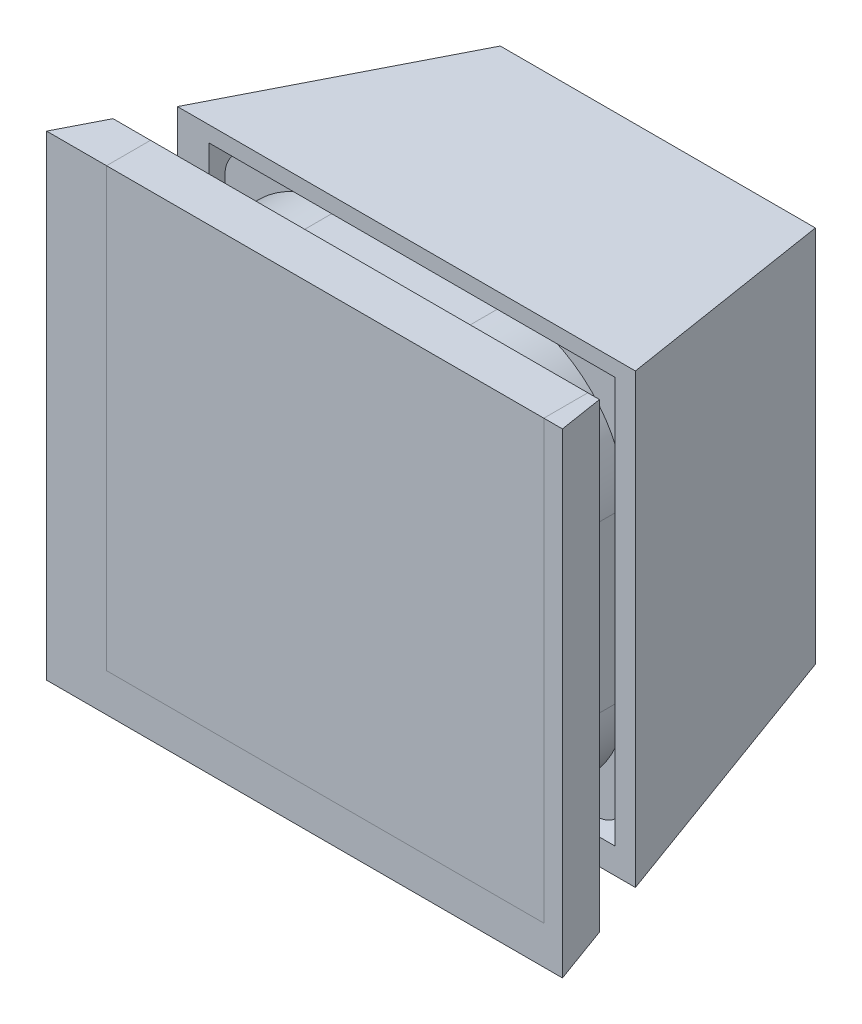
ISO-10303-21;
HEADER;
FILE_DESCRIPTION(('STEP AP214'),'2;1');
FILE_NAME('part.step','',(''),(''),'','','');
FILE_SCHEMA(('AUTOMOTIVE_DESIGN { 1 0 10303 214 1 1 1 1 }'));
ENDSEC;
DATA;
#1=APPLICATION_CONTEXT('core data for automotive mechanical design processes');
#2=APPLICATION_PROTOCOL_DEFINITION('international standard','automotive_design',2000,#1);
#3=PRODUCT_CONTEXT('',#1,'mechanical');
#4=PRODUCT('Part','Part','',(#3));
#5=PRODUCT_RELATED_PRODUCT_CATEGORY('part','',(#4));
#6=PRODUCT_DEFINITION_FORMATION('','',#4);
#7=PRODUCT_DEFINITION_CONTEXT('part definition',#1,'design');
#8=PRODUCT_DEFINITION('design','',#6,#7);
#9=PRODUCT_DEFINITION_SHAPE('','',#8);
#10=(LENGTH_UNIT() NAMED_UNIT(*) SI_UNIT(.MILLI.,.METRE.));
#11=(NAMED_UNIT(*) PLANE_ANGLE_UNIT() SI_UNIT($,.RADIAN.));
#12=(NAMED_UNIT(*) SI_UNIT($,.STERADIAN.) SOLID_ANGLE_UNIT());
#13=UNCERTAINTY_MEASURE_WITH_UNIT(LENGTH_MEASURE(1.E-05),#10,'distance_accuracy_value','');
#14=(GEOMETRIC_REPRESENTATION_CONTEXT(3) GLOBAL_UNCERTAINTY_ASSIGNED_CONTEXT((#13)) GLOBAL_UNIT_ASSIGNED_CONTEXT((#10,
#11,#12)) REPRESENTATION_CONTEXT('',''));
#15=CARTESIAN_POINT('',(0.,0.,0.));
#16=DIRECTION('',(0.,0.,1.));
#17=DIRECTION('',(1.,0.,0.));
#18=AXIS2_PLACEMENT_3D('',#15,#16,#17);
#19=CARTESIAN_POINT('',(19.5999999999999,46.5999999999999,-20.7999999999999));
#20=DIRECTION('',(0.,-1.,0.));
#21=DIRECTION('',(-1.,0.,0.));
#22=AXIS2_PLACEMENT_3D('',#19,#20,#21);
#23=PLANE('',#22);
#24=DIRECTION('',(0.,0.,1.));
#25=VECTOR('',#24,1.);
#26=CARTESIAN_POINT('',(31.5999999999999,46.5999999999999,-20.7999999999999));
#27=LINE('',#26,#25);
#28=CARTESIAN_POINT('',(31.5999999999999,46.5999999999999,-20.7999999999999));
#29=VERTEX_POINT('',#28);
#30=CARTESIAN_POINT('',(31.5999999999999,46.5999999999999,-16.8999999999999));
#31=VERTEX_POINT('',#30);
#32=EDGE_CURVE('E172',#29,#31,#27,.T.);
#33=ORIENTED_EDGE('',*,*,#32,.F.);
#34=DIRECTION('',(1.,0.,0.));
#35=VECTOR('',#34,1.);
#36=CARTESIAN_POINT('',(19.5999999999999,46.5999999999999,-20.7999999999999));
#37=LINE('',#36,#35);
#38=CARTESIAN_POINT('',(19.5999999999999,46.5999999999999,-20.7999999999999));
#39=VERTEX_POINT('',#38);
#40=EDGE_CURVE('E171',#39,#29,#37,.T.);
#41=ORIENTED_EDGE('',*,*,#40,.F.);
#42=DIRECTION('',(0.,0.,1.));
#43=VECTOR('',#42,1.);
#44=CARTESIAN_POINT('',(19.5999999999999,46.5999999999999,-20.7999999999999));
#45=LINE('',#44,#43);
#46=CARTESIAN_POINT('',(19.5999999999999,46.5999999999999,-16.8999999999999));
#47=VERTEX_POINT('',#46);
#48=EDGE_CURVE('E166',#39,#47,#45,.T.);
#49=ORIENTED_EDGE('',*,*,#48,.T.);
#50=DIRECTION('',(1.,0.,0.));
#51=VECTOR('',#50,1.);
#52=CARTESIAN_POINT('',(19.5999999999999,46.5999999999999,-16.8999999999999));
#53=LINE('',#52,#51);
#54=EDGE_CURVE('E13',#47,#31,#53,.T.);
#55=ORIENTED_EDGE('',*,*,#54,.T.);
#56=EDGE_LOOP('',(#33,#41,#49,#55));
#57=FACE_BOUND('',#56,.T.);
#58=ADVANCED_FACE('F109',(#57),#23,.F.);
#59=CARTESIAN_POINT('',(19.5999999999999,46.5999999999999,-16.8999999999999));
#60=DIRECTION('',(0.,0.70710678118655,-0.707106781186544));
#61=DIRECTION('',(0.,0.707106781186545,0.70710678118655));
#62=AXIS2_PLACEMENT_3D('',#59,#60,#61);
#63=PLANE('',#62);
#64=DIRECTION('',(0.,-0.707106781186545,-0.70710678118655));
#65=VECTOR('',#64,1.);
#66=CARTESIAN_POINT('',(31.5999999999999,46.5999999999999,-16.8999999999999));
#67=LINE('',#66,#65);
#68=CARTESIAN_POINT('',(31.5999999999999,45.3999999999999,-18.0999999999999));
#69=VERTEX_POINT('',#68);
#70=EDGE_CURVE('E174',#31,#69,#67,.T.);
#71=ORIENTED_EDGE('',*,*,#70,.F.);
#72=ORIENTED_EDGE('',*,*,#54,.F.);
#73=DIRECTION('',(0.,-0.707106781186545,-0.70710678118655));
#74=VECTOR('',#73,1.);
#75=CARTESIAN_POINT('',(19.5999999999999,46.5999999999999,-16.8999999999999));
#76=LINE('',#75,#74);
#77=CARTESIAN_POINT('',(19.5999999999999,45.3999999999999,-18.0999999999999));
#78=VERTEX_POINT('',#77);
#79=EDGE_CURVE('E150',#47,#78,#76,.T.);
#80=ORIENTED_EDGE('',*,*,#79,.T.);
#81=DIRECTION('',(1.,0.,0.));
#82=VECTOR('',#81,1.);
#83=CARTESIAN_POINT('',(19.5999999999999,45.3999999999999,-18.0999999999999));
#84=LINE('',#83,#82);
#85=EDGE_CURVE('E117',#78,#69,#84,.T.);
#86=ORIENTED_EDGE('',*,*,#85,.T.);
#87=EDGE_LOOP('',(#71,#72,#80,#86));
#88=FACE_BOUND('',#87,.T.);
#89=ADVANCED_FACE('F164',(#88),#63,.F.);
#90=CARTESIAN_POINT('',(19.5999999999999,45.3999999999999,-18.0999999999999));
#91=DIRECTION('',(0.,1.,0.));
#92=DIRECTION('',(0.,0.,1.));
#93=AXIS2_PLACEMENT_3D('',#90,#91,#92);
#94=PLANE('',#93);
#95=DIRECTION('',(0.,0.,-1.));
#96=VECTOR('',#95,1.);
#97=CARTESIAN_POINT('',(31.5999999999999,45.3999999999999,-18.0999999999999));
#98=LINE('',#97,#96);
#99=CARTESIAN_POINT('',(31.5999999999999,45.3999999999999,-19.5999999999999));
#100=VERTEX_POINT('',#99);
#101=EDGE_CURVE('E160',#69,#100,#98,.T.);
#102=ORIENTED_EDGE('',*,*,#101,.F.);
#103=ORIENTED_EDGE('',*,*,#85,.F.);
#104=DIRECTION('',(0.,0.,-1.));
#105=VECTOR('',#104,1.);
#106=CARTESIAN_POINT('',(19.5999999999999,45.3999999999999,-18.0999999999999));
#107=LINE('',#106,#105);
#108=CARTESIAN_POINT('',(19.5999999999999,45.3999999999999,-19.5999999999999));
#109=VERTEX_POINT('',#108);
#110=EDGE_CURVE('E153',#78,#109,#107,.T.);
#111=ORIENTED_EDGE('',*,*,#110,.T.);
#112=DIRECTION('',(1.,0.,0.));
#113=VECTOR('',#112,1.);
#114=CARTESIAN_POINT('',(19.5999999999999,45.3999999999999,-19.5999999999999));
#115=LINE('',#114,#113);
#116=EDGE_CURVE('E163',#109,#100,#115,.T.);
#117=ORIENTED_EDGE('',*,*,#116,.T.);
#118=EDGE_LOOP('',(#102,#103,#111,#117));
#119=FACE_BOUND('',#118,.T.);
#120=ADVANCED_FACE('F159',(#119),#94,.F.);
#121=CARTESIAN_POINT('',(19.5999999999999,45.3999999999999,-19.5999999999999));
#122=DIRECTION('',(0.,0.707106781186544,0.70710678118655));
#123=DIRECTION('',(0.,-0.70710678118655,0.707106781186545));
#124=AXIS2_PLACEMENT_3D('',#121,#122,#123);
#125=PLANE('',#124);
#126=DIRECTION('',(0.,0.70710678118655,-0.707106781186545));
#127=VECTOR('',#126,1.);
#128=CARTESIAN_POINT('',(31.5999999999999,45.3999999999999,-19.5999999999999));
#129=LINE('',#128,#127);
#130=EDGE_CURVE('E139',#100,#29,#129,.T.);
#131=ORIENTED_EDGE('',*,*,#130,.F.);
#132=ORIENTED_EDGE('',*,*,#116,.F.);
#133=DIRECTION('',(0.,0.70710678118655,-0.707106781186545));
#134=VECTOR('',#133,1.);
#135=CARTESIAN_POINT('',(19.5999999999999,45.3999999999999,-19.5999999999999));
#136=LINE('',#135,#134);
#137=EDGE_CURVE('E125',#109,#39,#136,.T.);
#138=ORIENTED_EDGE('',*,*,#137,.T.);
#139=ORIENTED_EDGE('',*,*,#40,.T.);
#140=EDGE_LOOP('',(#131,#132,#138,#139));
#141=FACE_BOUND('',#140,.T.);
#142=ADVANCED_FACE('F183',(#141),#125,.F.);
#143=CARTESIAN_POINT('',(19.5999999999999,0.,0.));
#144=DIRECTION('',(-1.,0.,0.));
#145=DIRECTION('',(0.,0.,1.));
#146=AXIS2_PLACEMENT_3D('',#143,#144,#145);
#147=PLANE('',#146);
#148=ORIENTED_EDGE('',*,*,#48,.F.);
#149=ORIENTED_EDGE('',*,*,#137,.F.);
#150=ORIENTED_EDGE('',*,*,#110,.F.);
#151=ORIENTED_EDGE('',*,*,#79,.F.);
#152=EDGE_LOOP('',(#148,#149,#150,#151));
#153=FACE_BOUND('',#152,.T.);
#154=ADVANCED_FACE('F155',(#153),#147,.T.);
#155=CARTESIAN_POINT('',(31.5999999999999,0.,0.));
#156=DIRECTION('',(-1.,0.,0.));
#157=DIRECTION('',(0.,0.,1.));
#158=AXIS2_PLACEMENT_3D('',#155,#156,#157);
#159=PLANE('',#158);
#160=ORIENTED_EDGE('',*,*,#32,.T.);
#161=ORIENTED_EDGE('',*,*,#70,.T.);
#162=ORIENTED_EDGE('',*,*,#101,.T.);
#163=ORIENTED_EDGE('',*,*,#130,.T.);
#164=EDGE_LOOP('',(#160,#161,#162,#163));
#165=FACE_BOUND('',#164,.T.);
#166=ADVANCED_FACE('F179',(#165),#159,.F.);
#167=CLOSED_SHELL('',(#58,#89,#120,#142,#154,#166));
#168=MANIFOLD_SOLID_BREP('B2',#167);
#169=CARTESIAN_POINT('',(-19.5999999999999,46.5999999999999,-20.7999999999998));
#170=DIRECTION('',(0.,-1.,0.));
#171=DIRECTION('',(1.,0.,0.));
#172=AXIS2_PLACEMENT_3D('',#169,#170,#171);
#173=PLANE('',#172);
#174=DIRECTION('',(0.,0.,1.));
#175=VECTOR('',#174,1.);
#176=CARTESIAN_POINT('',(-31.5999999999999,46.5999999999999,-20.7999999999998));
#177=LINE('',#176,#175);
#178=CARTESIAN_POINT('',(-31.5999999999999,46.5999999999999,-20.7999999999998));
#179=VERTEX_POINT('',#178);
#180=CARTESIAN_POINT('',(-31.5999999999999,46.5999999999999,-16.8999999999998));
#181=VERTEX_POINT('',#180);
#182=EDGE_CURVE('E322',#179,#181,#177,.T.);
#183=ORIENTED_EDGE('',*,*,#182,.T.);
#184=DIRECTION('',(-1.,0.,0.));
#185=VECTOR('',#184,1.);
#186=CARTESIAN_POINT('',(-19.5999999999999,46.5999999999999,-16.8999999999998));
#187=LINE('',#186,#185);
#188=CARTESIAN_POINT('',(-19.5999999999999,46.5999999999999,-16.8999999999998));
#189=VERTEX_POINT('',#188);
#190=EDGE_CURVE('E107',#189,#181,#187,.T.);
#191=ORIENTED_EDGE('',*,*,#190,.F.);
#192=DIRECTION('',(0.,0.,1.));
#193=VECTOR('',#192,1.);
#194=CARTESIAN_POINT('',(-19.5999999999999,46.5999999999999,-20.7999999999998));
#195=LINE('',#194,#193);
#196=CARTESIAN_POINT('',(-19.5999999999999,46.5999999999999,-20.7999999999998));
#197=VERTEX_POINT('',#196);
#198=EDGE_CURVE('E309',#197,#189,#195,.T.);
#199=ORIENTED_EDGE('',*,*,#198,.F.);
#200=DIRECTION('',(-1.,0.,0.));
#201=VECTOR('',#200,1.);
#202=CARTESIAN_POINT('',(-19.5999999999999,46.5999999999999,-20.7999999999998));
#203=LINE('',#202,#201);
#204=EDGE_CURVE('E314',#197,#179,#203,.T.);
#205=ORIENTED_EDGE('',*,*,#204,.T.);
#206=EDGE_LOOP('',(#183,#191,#199,#205));
#207=FACE_BOUND('',#206,.T.);
#208=ADVANCED_FACE('F254',(#207),#173,.F.);
#209=CARTESIAN_POINT('',(-19.5999999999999,46.5999999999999,-16.8999999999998));
#210=DIRECTION('',(0.,0.70710678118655,-0.707106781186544));
#211=DIRECTION('',(0.,0.707106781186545,0.70710678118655));
#212=AXIS2_PLACEMENT_3D('',#209,#210,#211);
#213=PLANE('',#212);
#214=DIRECTION('',(0.,-0.707106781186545,-0.70710678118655));
#215=VECTOR('',#214,1.);
#216=CARTESIAN_POINT('',(-31.5999999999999,46.5999999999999,-16.8999999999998));
#217=LINE('',#216,#215);
#218=CARTESIAN_POINT('',(-31.5999999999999,45.3999999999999,-18.0999999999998));
#219=VERTEX_POINT('',#218);
#220=EDGE_CURVE('E313',#181,#219,#217,.T.);
#221=ORIENTED_EDGE('',*,*,#220,.T.);
#222=DIRECTION('',(-1.,0.,0.));
#223=VECTOR('',#222,1.);
#224=CARTESIAN_POINT('',(-19.5999999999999,45.3999999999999,-18.0999999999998));
#225=LINE('',#224,#223);
#226=CARTESIAN_POINT('',(-19.5999999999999,45.3999999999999,-18.0999999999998));
#227=VERTEX_POINT('',#226);
#228=EDGE_CURVE('E262',#227,#219,#225,.T.);
#229=ORIENTED_EDGE('',*,*,#228,.F.);
#230=DIRECTION('',(0.,-0.707106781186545,-0.70710678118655));
#231=VECTOR('',#230,1.);
#232=CARTESIAN_POINT('',(-19.5999999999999,46.5999999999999,-16.8999999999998));
#233=LINE('',#232,#231);
#234=EDGE_CURVE('E296',#189,#227,#233,.T.);
#235=ORIENTED_EDGE('',*,*,#234,.F.);
#236=ORIENTED_EDGE('',*,*,#190,.T.);
#237=EDGE_LOOP('',(#221,#229,#235,#236));
#238=FACE_BOUND('',#237,.T.);
#239=ADVANCED_FACE('F312',(#238),#213,.F.);
#240=CARTESIAN_POINT('',(-19.5999999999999,45.3999999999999,-18.0999999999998));
#241=DIRECTION('',(0.,1.,0.));
#242=DIRECTION('',(0.,0.,1.));
#243=AXIS2_PLACEMENT_3D('',#240,#241,#242);
#244=PLANE('',#243);
#245=DIRECTION('',(0.,0.,-1.));
#246=VECTOR('',#245,1.);
#247=CARTESIAN_POINT('',(-31.5999999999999,45.3999999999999,-18.0999999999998));
#248=LINE('',#247,#246);
#249=CARTESIAN_POINT('',(-31.5999999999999,45.3999999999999,-19.5999999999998));
#250=VERTEX_POINT('',#249);
#251=EDGE_CURVE('E319',#219,#250,#248,.T.);
#252=ORIENTED_EDGE('',*,*,#251,.T.);
#253=DIRECTION('',(-1.,0.,0.));
#254=VECTOR('',#253,1.);
#255=CARTESIAN_POINT('',(-19.5999999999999,45.3999999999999,-19.5999999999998));
#256=LINE('',#255,#254);
#257=CARTESIAN_POINT('',(-19.5999999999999,45.3999999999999,-19.5999999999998));
#258=VERTEX_POINT('',#257);
#259=EDGE_CURVE('E305',#258,#250,#256,.T.);
#260=ORIENTED_EDGE('',*,*,#259,.F.);
#261=DIRECTION('',(0.,0.,-1.));
#262=VECTOR('',#261,1.);
#263=CARTESIAN_POINT('',(-19.5999999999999,45.3999999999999,-18.0999999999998));
#264=LINE('',#263,#262);
#265=EDGE_CURVE('E301',#227,#258,#264,.T.);
#266=ORIENTED_EDGE('',*,*,#265,.F.);
#267=ORIENTED_EDGE('',*,*,#228,.T.);
#268=EDGE_LOOP('',(#252,#260,#266,#267));
#269=FACE_BOUND('',#268,.T.);
#270=ADVANCED_FACE('F303',(#269),#244,.F.);
#271=CARTESIAN_POINT('',(-19.5999999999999,45.3999999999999,-19.5999999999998));
#272=DIRECTION('',(0.,0.707106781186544,0.70710678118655));
#273=DIRECTION('',(0.,-0.70710678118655,0.707106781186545));
#274=AXIS2_PLACEMENT_3D('',#271,#272,#273);
#275=PLANE('',#274);
#276=DIRECTION('',(0.,0.70710678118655,-0.707106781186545));
#277=VECTOR('',#276,1.);
#278=CARTESIAN_POINT('',(-31.5999999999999,45.3999999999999,-19.5999999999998));
#279=LINE('',#278,#277);
#280=EDGE_CURVE('E286',#250,#179,#279,.T.);
#281=ORIENTED_EDGE('',*,*,#280,.T.);
#282=ORIENTED_EDGE('',*,*,#204,.F.);
#283=DIRECTION('',(0.,0.70710678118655,-0.707106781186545));
#284=VECTOR('',#283,1.);
#285=CARTESIAN_POINT('',(-19.5999999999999,45.3999999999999,-19.5999999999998));
#286=LINE('',#285,#284);
#287=EDGE_CURVE('E270',#258,#197,#286,.T.);
#288=ORIENTED_EDGE('',*,*,#287,.F.);
#289=ORIENTED_EDGE('',*,*,#259,.T.);
#290=EDGE_LOOP('',(#281,#282,#288,#289));
#291=FACE_BOUND('',#290,.T.);
#292=ADVANCED_FACE('F333',(#291),#275,.F.);
#293=CARTESIAN_POINT('',(-19.5999999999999,0.,0.));
#294=DIRECTION('',(1.,0.,0.));
#295=DIRECTION('',(0.,0.,1.));
#296=AXIS2_PLACEMENT_3D('',#293,#294,#295);
#297=PLANE('',#296);
#298=ORIENTED_EDGE('',*,*,#198,.T.);
#299=ORIENTED_EDGE('',*,*,#234,.T.);
#300=ORIENTED_EDGE('',*,*,#265,.T.);
#301=ORIENTED_EDGE('',*,*,#287,.T.);
#302=EDGE_LOOP('',(#298,#299,#300,#301));
#303=FACE_BOUND('',#302,.T.);
#304=ADVANCED_FACE('F307',(#303),#297,.T.);
#305=CARTESIAN_POINT('',(-31.5999999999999,0.,0.));
#306=DIRECTION('',(1.,0.,0.));
#307=DIRECTION('',(0.,0.,1.));
#308=AXIS2_PLACEMENT_3D('',#305,#306,#307);
#309=PLANE('',#308);
#310=ORIENTED_EDGE('',*,*,#182,.F.);
#311=ORIENTED_EDGE('',*,*,#280,.F.);
#312=ORIENTED_EDGE('',*,*,#251,.F.);
#313=ORIENTED_EDGE('',*,*,#220,.F.);
#314=EDGE_LOOP('',(#310,#311,#312,#313));
#315=FACE_BOUND('',#314,.T.);
#316=ADVANCED_FACE('F327',(#315),#309,.F.);
#317=CLOSED_SHELL('',(#208,#239,#270,#292,#304,#316));
#318=MANIFOLD_SOLID_BREP('B7',#317);
#319=CARTESIAN_POINT('',(-19.5999999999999,-46.5999999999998,-20.7999999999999));
#320=DIRECTION('',(0.,1.,0.));
#321=DIRECTION('',(1.,0.,0.));
#322=AXIS2_PLACEMENT_3D('',#319,#320,#321);
#323=PLANE('',#322);
#324=DIRECTION('',(0.,0.,1.));
#325=VECTOR('',#324,1.);
#326=CARTESIAN_POINT('',(-31.5999999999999,-46.5999999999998,-20.7999999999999));
#327=LINE('',#326,#325);
#328=CARTESIAN_POINT('',(-31.5999999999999,-46.5999999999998,-20.7999999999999));
#329=VERTEX_POINT('',#328);
#330=CARTESIAN_POINT('',(-31.5999999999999,-46.5999999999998,-16.8999999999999));
#331=VERTEX_POINT('',#330);
#332=EDGE_CURVE('E462',#329,#331,#327,.T.);
#333=ORIENTED_EDGE('',*,*,#332,.F.);
#334=DIRECTION('',(-1.,0.,0.));
#335=VECTOR('',#334,1.);
#336=CARTESIAN_POINT('',(-19.5999999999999,-46.5999999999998,-20.7999999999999));
#337=LINE('',#336,#335);
#338=CARTESIAN_POINT('',(-19.5999999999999,-46.5999999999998,-20.7999999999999));
#339=VERTEX_POINT('',#338);
#340=EDGE_CURVE('E461',#339,#329,#337,.T.);
#341=ORIENTED_EDGE('',*,*,#340,.F.);
#342=DIRECTION('',(0.,0.,1.));
#343=VECTOR('',#342,1.);
#344=CARTESIAN_POINT('',(-19.5999999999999,-46.5999999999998,-20.7999999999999));
#345=LINE('',#344,#343);
#346=CARTESIAN_POINT('',(-19.5999999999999,-46.5999999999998,-16.8999999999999));
#347=VERTEX_POINT('',#346);
#348=EDGE_CURVE('E456',#339,#347,#345,.T.);
#349=ORIENTED_EDGE('',*,*,#348,.T.);
#350=DIRECTION('',(-1.,0.,0.));
#351=VECTOR('',#350,1.);
#352=CARTESIAN_POINT('',(-19.5999999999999,-46.5999999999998,-16.8999999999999));
#353=LINE('',#352,#351);
#354=EDGE_CURVE('E252',#347,#331,#353,.T.);
#355=ORIENTED_EDGE('',*,*,#354,.T.);
#356=EDGE_LOOP('',(#333,#341,#349,#355));
#357=FACE_BOUND('',#356,.T.);
#358=ADVANCED_FACE('F399',(#357),#323,.F.);
#359=CARTESIAN_POINT('',(-19.5999999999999,-46.5999999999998,-16.8999999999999));
#360=DIRECTION('',(0.,-0.707106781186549,-0.707106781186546));
#361=DIRECTION('',(0.,-0.707106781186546,0.707106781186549));
#362=AXIS2_PLACEMENT_3D('',#359,#360,#361);
#363=PLANE('',#362);
#364=DIRECTION('',(0.,0.707106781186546,-0.707106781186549));
#365=VECTOR('',#364,1.);
#366=CARTESIAN_POINT('',(-31.5999999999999,-46.5999999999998,-16.8999999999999));
#367=LINE('',#366,#365);
#368=CARTESIAN_POINT('',(-31.5999999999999,-45.3999999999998,-18.0999999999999));
#369=VERTEX_POINT('',#368);
#370=EDGE_CURVE('E464',#331,#369,#367,.T.);
#371=ORIENTED_EDGE('',*,*,#370,.F.);
#372=ORIENTED_EDGE('',*,*,#354,.F.);
#373=DIRECTION('',(0.,0.707106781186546,-0.707106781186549));
#374=VECTOR('',#373,1.);
#375=CARTESIAN_POINT('',(-19.5999999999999,-46.5999999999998,-16.8999999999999));
#376=LINE('',#375,#374);
#377=CARTESIAN_POINT('',(-19.5999999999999,-45.3999999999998,-18.0999999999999));
#378=VERTEX_POINT('',#377);
#379=EDGE_CURVE('E440',#347,#378,#376,.T.);
#380=ORIENTED_EDGE('',*,*,#379,.T.);
#381=DIRECTION('',(-1.,0.,0.));
#382=VECTOR('',#381,1.);
#383=CARTESIAN_POINT('',(-19.5999999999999,-45.3999999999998,-18.0999999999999));
#384=LINE('',#383,#382);
#385=EDGE_CURVE('E407',#378,#369,#384,.T.);
#386=ORIENTED_EDGE('',*,*,#385,.T.);
#387=EDGE_LOOP('',(#371,#372,#380,#386));
#388=FACE_BOUND('',#387,.T.);
#389=ADVANCED_FACE('F454',(#388),#363,.F.);
#390=CARTESIAN_POINT('',(-19.5999999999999,-45.3999999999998,-18.0999999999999));
#391=DIRECTION('',(0.,-1.,0.));
#392=DIRECTION('',(0.,0.,1.));
#393=AXIS2_PLACEMENT_3D('',#390,#391,#392);
#394=PLANE('',#393);
#395=DIRECTION('',(0.,0.,-1.));
#396=VECTOR('',#395,1.);
#397=CARTESIAN_POINT('',(-31.5999999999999,-45.3999999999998,-18.0999999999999));
#398=LINE('',#397,#396);
#399=CARTESIAN_POINT('',(-31.5999999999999,-45.3999999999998,-19.5999999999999));
#400=VERTEX_POINT('',#399);
#401=EDGE_CURVE('E450',#369,#400,#398,.T.);
#402=ORIENTED_EDGE('',*,*,#401,.F.);
#403=ORIENTED_EDGE('',*,*,#385,.F.);
#404=DIRECTION('',(0.,0.,-1.));
#405=VECTOR('',#404,1.);
#406=CARTESIAN_POINT('',(-19.5999999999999,-45.3999999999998,-18.0999999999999));
#407=LINE('',#406,#405);
#408=CARTESIAN_POINT('',(-19.5999999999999,-45.3999999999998,-19.5999999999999));
#409=VERTEX_POINT('',#408);
#410=EDGE_CURVE('E443',#378,#409,#407,.T.);
#411=ORIENTED_EDGE('',*,*,#410,.T.);
#412=DIRECTION('',(-1.,0.,0.));
#413=VECTOR('',#412,1.);
#414=CARTESIAN_POINT('',(-19.5999999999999,-45.3999999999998,-19.5999999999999));
#415=LINE('',#414,#413);
#416=EDGE_CURVE('E453',#409,#400,#415,.T.);
#417=ORIENTED_EDGE('',*,*,#416,.T.);
#418=EDGE_LOOP('',(#402,#403,#411,#417));
#419=FACE_BOUND('',#418,.T.);
#420=ADVANCED_FACE('F449',(#419),#394,.F.);
#421=CARTESIAN_POINT('',(-19.5999999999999,-45.3999999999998,-19.5999999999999));
#422=DIRECTION('',(0.,-0.707106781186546,0.707106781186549));
#423=DIRECTION('',(0.,0.707106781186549,0.707106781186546));
#424=AXIS2_PLACEMENT_3D('',#421,#422,#423);
#425=PLANE('',#424);
#426=DIRECTION('',(0.,-0.707106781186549,-0.707106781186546));
#427=VECTOR('',#426,1.);
#428=CARTESIAN_POINT('',(-31.5999999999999,-45.3999999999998,-19.5999999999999));
#429=LINE('',#428,#427);
#430=EDGE_CURVE('E429',#400,#329,#429,.T.);
#431=ORIENTED_EDGE('',*,*,#430,.F.);
#432=ORIENTED_EDGE('',*,*,#416,.F.);
#433=DIRECTION('',(0.,-0.707106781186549,-0.707106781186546));
#434=VECTOR('',#433,1.);
#435=CARTESIAN_POINT('',(-19.5999999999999,-45.3999999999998,-19.5999999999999));
#436=LINE('',#435,#434);
#437=EDGE_CURVE('E415',#409,#339,#436,.T.);
#438=ORIENTED_EDGE('',*,*,#437,.T.);
#439=ORIENTED_EDGE('',*,*,#340,.T.);
#440=EDGE_LOOP('',(#431,#432,#438,#439));
#441=FACE_BOUND('',#440,.T.);
#442=ADVANCED_FACE('F473',(#441),#425,.F.);
#443=CARTESIAN_POINT('',(-19.5999999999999,0.,0.));
#444=DIRECTION('',(1.,0.,0.));
#445=DIRECTION('',(0.,0.,1.));
#446=AXIS2_PLACEMENT_3D('',#443,#444,#445);
#447=PLANE('',#446);
#448=ORIENTED_EDGE('',*,*,#348,.F.);
#449=ORIENTED_EDGE('',*,*,#437,.F.);
#450=ORIENTED_EDGE('',*,*,#410,.F.);
#451=ORIENTED_EDGE('',*,*,#379,.F.);
#452=EDGE_LOOP('',(#448,#449,#450,#451));
#453=FACE_BOUND('',#452,.T.);
#454=ADVANCED_FACE('F445',(#453),#447,.T.);
#455=CARTESIAN_POINT('',(-31.5999999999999,0.,0.));
#456=DIRECTION('',(1.,0.,0.));
#457=DIRECTION('',(0.,0.,1.));
#458=AXIS2_PLACEMENT_3D('',#455,#456,#457);
#459=PLANE('',#458);
#460=ORIENTED_EDGE('',*,*,#332,.T.);
#461=ORIENTED_EDGE('',*,*,#370,.T.);
#462=ORIENTED_EDGE('',*,*,#401,.T.);
#463=ORIENTED_EDGE('',*,*,#430,.T.);
#464=EDGE_LOOP('',(#460,#461,#462,#463));
#465=FACE_BOUND('',#464,.T.);
#466=ADVANCED_FACE('F469',(#465),#459,.F.);
#467=CLOSED_SHELL('',(#358,#389,#420,#442,#454,#466));
#468=MANIFOLD_SOLID_BREP('B101',#467);
#469=CARTESIAN_POINT('',(19.5999999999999,-46.5999999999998,-20.8));
#470=DIRECTION('',(0.,1.,0.));
#471=DIRECTION('',(-1.,0.,0.));
#472=AXIS2_PLACEMENT_3D('',#469,#470,#471);
#473=PLANE('',#472);
#474=DIRECTION('',(0.,0.,1.));
#475=VECTOR('',#474,1.);
#476=CARTESIAN_POINT('',(31.5999999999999,-46.5999999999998,-20.8));
#477=LINE('',#476,#475);
#478=CARTESIAN_POINT('',(31.5999999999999,-46.5999999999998,-20.8));
#479=VERTEX_POINT('',#478);
#480=CARTESIAN_POINT('',(31.5999999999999,-46.5999999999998,-16.9));
#481=VERTEX_POINT('',#480);
#482=EDGE_CURVE('E612',#479,#481,#477,.T.);
#483=ORIENTED_EDGE('',*,*,#482,.T.);
#484=DIRECTION('',(1.,0.,0.));
#485=VECTOR('',#484,1.);
#486=CARTESIAN_POINT('',(19.5999999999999,-46.5999999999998,-16.9));
#487=LINE('',#486,#485);
#488=CARTESIAN_POINT('',(19.5999999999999,-46.5999999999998,-16.9));
#489=VERTEX_POINT('',#488);
#490=EDGE_CURVE('E397',#489,#481,#487,.T.);
#491=ORIENTED_EDGE('',*,*,#490,.F.);
#492=DIRECTION('',(0.,0.,1.));
#493=VECTOR('',#492,1.);
#494=CARTESIAN_POINT('',(19.5999999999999,-46.5999999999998,-20.8));
#495=LINE('',#494,#493);
#496=CARTESIAN_POINT('',(19.5999999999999,-46.5999999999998,-20.8));
#497=VERTEX_POINT('',#496);
#498=EDGE_CURVE('E599',#497,#489,#495,.T.);
#499=ORIENTED_EDGE('',*,*,#498,.F.);
#500=DIRECTION('',(1.,0.,0.));
#501=VECTOR('',#500,1.);
#502=CARTESIAN_POINT('',(19.5999999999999,-46.5999999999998,-20.8));
#503=LINE('',#502,#501);
#504=EDGE_CURVE('E604',#497,#479,#503,.T.);
#505=ORIENTED_EDGE('',*,*,#504,.T.);
#506=EDGE_LOOP('',(#483,#491,#499,#505));
#507=FACE_BOUND('',#506,.T.);
#508=ADVANCED_FACE('F544',(#507),#473,.F.);
#509=CARTESIAN_POINT('',(19.5999999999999,-46.5999999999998,-16.9));
#510=DIRECTION('',(0.,-0.707106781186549,-0.707106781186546));
#511=DIRECTION('',(0.,-0.707106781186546,0.707106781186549));
#512=AXIS2_PLACEMENT_3D('',#509,#510,#511);
#513=PLANE('',#512);
#514=DIRECTION('',(0.,0.707106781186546,-0.707106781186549));
#515=VECTOR('',#514,1.);
#516=CARTESIAN_POINT('',(31.5999999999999,-46.5999999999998,-16.9));
#517=LINE('',#516,#515);
#518=CARTESIAN_POINT('',(31.5999999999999,-45.3999999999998,-18.1));
#519=VERTEX_POINT('',#518);
#520=EDGE_CURVE('E603',#481,#519,#517,.T.);
#521=ORIENTED_EDGE('',*,*,#520,.T.);
#522=DIRECTION('',(1.,0.,0.));
#523=VECTOR('',#522,1.);
#524=CARTESIAN_POINT('',(19.5999999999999,-45.3999999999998,-18.1));
#525=LINE('',#524,#523);
#526=CARTESIAN_POINT('',(19.5999999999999,-45.3999999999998,-18.1));
#527=VERTEX_POINT('',#526);
#528=EDGE_CURVE('E552',#527,#519,#525,.T.);
#529=ORIENTED_EDGE('',*,*,#528,.F.);
#530=DIRECTION('',(0.,0.707106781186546,-0.707106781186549));
#531=VECTOR('',#530,1.);
#532=CARTESIAN_POINT('',(19.5999999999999,-46.5999999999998,-16.9));
#533=LINE('',#532,#531);
#534=EDGE_CURVE('E586',#489,#527,#533,.T.);
#535=ORIENTED_EDGE('',*,*,#534,.F.);
#536=ORIENTED_EDGE('',*,*,#490,.T.);
#537=EDGE_LOOP('',(#521,#529,#535,#536));
#538=FACE_BOUND('',#537,.T.);
#539=ADVANCED_FACE('F602',(#538),#513,.F.);
#540=CARTESIAN_POINT('',(19.5999999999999,-45.3999999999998,-18.1));
#541=DIRECTION('',(0.,-1.,0.));
#542=DIRECTION('',(0.,0.,1.));
#543=AXIS2_PLACEMENT_3D('',#540,#541,#542);
#544=PLANE('',#543);
#545=DIRECTION('',(0.,0.,-1.));
#546=VECTOR('',#545,1.);
#547=CARTESIAN_POINT('',(31.5999999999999,-45.3999999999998,-18.1));
#548=LINE('',#547,#546);
#549=CARTESIAN_POINT('',(31.5999999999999,-45.3999999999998,-19.6));
#550=VERTEX_POINT('',#549);
#551=EDGE_CURVE('E609',#519,#550,#548,.T.);
#552=ORIENTED_EDGE('',*,*,#551,.T.);
#553=DIRECTION('',(1.,0.,0.));
#554=VECTOR('',#553,1.);
#555=CARTESIAN_POINT('',(19.5999999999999,-45.3999999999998,-19.6));
#556=LINE('',#555,#554);
#557=CARTESIAN_POINT('',(19.5999999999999,-45.3999999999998,-19.6));
#558=VERTEX_POINT('',#557);
#559=EDGE_CURVE('E595',#558,#550,#556,.T.);
#560=ORIENTED_EDGE('',*,*,#559,.F.);
#561=DIRECTION('',(0.,0.,-1.));
#562=VECTOR('',#561,1.);
#563=CARTESIAN_POINT('',(19.5999999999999,-45.3999999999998,-18.1));
#564=LINE('',#563,#562);
#565=EDGE_CURVE('E591',#527,#558,#564,.T.);
#566=ORIENTED_EDGE('',*,*,#565,.F.);
#567=ORIENTED_EDGE('',*,*,#528,.T.);
#568=EDGE_LOOP('',(#552,#560,#566,#567));
#569=FACE_BOUND('',#568,.T.);
#570=ADVANCED_FACE('F593',(#569),#544,.F.);
#571=CARTESIAN_POINT('',(19.5999999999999,-45.3999999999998,-19.6));
#572=DIRECTION('',(0.,-0.707106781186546,0.707106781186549));
#573=DIRECTION('',(0.,0.707106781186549,0.707106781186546));
#574=AXIS2_PLACEMENT_3D('',#571,#572,#573);
#575=PLANE('',#574);
#576=DIRECTION('',(0.,-0.707106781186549,-0.707106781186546));
#577=VECTOR('',#576,1.);
#578=CARTESIAN_POINT('',(31.5999999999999,-45.3999999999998,-19.6));
#579=LINE('',#578,#577);
#580=EDGE_CURVE('E576',#550,#479,#579,.T.);
#581=ORIENTED_EDGE('',*,*,#580,.T.);
#582=ORIENTED_EDGE('',*,*,#504,.F.);
#583=DIRECTION('',(0.,-0.707106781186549,-0.707106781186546));
#584=VECTOR('',#583,1.);
#585=CARTESIAN_POINT('',(19.5999999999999,-45.3999999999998,-19.6));
#586=LINE('',#585,#584);
#587=EDGE_CURVE('E560',#558,#497,#586,.T.);
#588=ORIENTED_EDGE('',*,*,#587,.F.);
#589=ORIENTED_EDGE('',*,*,#559,.T.);
#590=EDGE_LOOP('',(#581,#582,#588,#589));
#591=FACE_BOUND('',#590,.T.);
#592=ADVANCED_FACE('F623',(#591),#575,.F.);
#593=CARTESIAN_POINT('',(19.5999999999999,0.,0.));
#594=DIRECTION('',(-1.,0.,0.));
#595=DIRECTION('',(0.,0.,1.));
#596=AXIS2_PLACEMENT_3D('',#593,#594,#595);
#597=PLANE('',#596);
#598=ORIENTED_EDGE('',*,*,#498,.T.);
#599=ORIENTED_EDGE('',*,*,#534,.T.);
#600=ORIENTED_EDGE('',*,*,#565,.T.);
#601=ORIENTED_EDGE('',*,*,#587,.T.);
#602=EDGE_LOOP('',(#598,#599,#600,#601));
#603=FACE_BOUND('',#602,.T.);
#604=ADVANCED_FACE('F597',(#603),#597,.T.);
#605=CARTESIAN_POINT('',(31.5999999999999,0.,0.));
#606=DIRECTION('',(-1.,0.,0.));
#607=DIRECTION('',(0.,0.,1.));
#608=AXIS2_PLACEMENT_3D('',#605,#606,#607);
#609=PLANE('',#608);
#610=ORIENTED_EDGE('',*,*,#482,.F.);
#611=ORIENTED_EDGE('',*,*,#580,.F.);
#612=ORIENTED_EDGE('',*,*,#551,.F.);
#613=ORIENTED_EDGE('',*,*,#520,.F.);
#614=EDGE_LOOP('',(#610,#611,#612,#613));
#615=FACE_BOUND('',#614,.T.);
#616=ADVANCED_FACE('F617',(#615),#609,.F.);
#617=CLOSED_SHELL('',(#508,#539,#570,#592,#604,#616));
#618=MANIFOLD_SOLID_BREP('B246',#617);
#619=CARTESIAN_POINT('',(46.5999999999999,-19.5999999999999,-20.7999999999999));
#620=DIRECTION('',(-1.,0.,0.));
#621=DIRECTION('',(0.,1.,0.));
#622=AXIS2_PLACEMENT_3D('',#619,#620,#621);
#623=PLANE('',#622);
#624=DIRECTION('',(0.,0.,1.));
#625=VECTOR('',#624,1.);
#626=CARTESIAN_POINT('',(46.5999999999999,-31.5999999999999,-20.7999999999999));
#627=LINE('',#626,#625);
#628=CARTESIAN_POINT('',(46.5999999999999,-31.5999999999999,-20.7999999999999));
#629=VERTEX_POINT('',#628);
#630=CARTESIAN_POINT('',(46.5999999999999,-31.5999999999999,-16.8999999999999));
#631=VERTEX_POINT('',#630);
#632=EDGE_CURVE('E752',#629,#631,#627,.T.);
#633=ORIENTED_EDGE('',*,*,#632,.F.);
#634=DIRECTION('',(0.,-1.,0.));
#635=VECTOR('',#634,1.);
#636=CARTESIAN_POINT('',(46.5999999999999,-19.5999999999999,-20.7999999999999));
#637=LINE('',#636,#635);
#638=CARTESIAN_POINT('',(46.5999999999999,-19.5999999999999,-20.7999999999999));
#639=VERTEX_POINT('',#638);
#640=EDGE_CURVE('E751',#639,#629,#637,.T.);
#641=ORIENTED_EDGE('',*,*,#640,.F.);
#642=DIRECTION('',(0.,0.,1.));
#643=VECTOR('',#642,1.);
#644=CARTESIAN_POINT('',(46.5999999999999,-19.5999999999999,-20.7999999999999));
#645=LINE('',#644,#643);
#646=CARTESIAN_POINT('',(46.5999999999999,-19.5999999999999,-16.8999999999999));
#647=VERTEX_POINT('',#646);
#648=EDGE_CURVE('E746',#639,#647,#645,.T.);
#649=ORIENTED_EDGE('',*,*,#648,.T.);
#650=DIRECTION('',(0.,-1.,0.));
#651=VECTOR('',#650,1.);
#652=CARTESIAN_POINT('',(46.5999999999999,-19.5999999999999,-16.8999999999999));
#653=LINE('',#652,#651);
#654=EDGE_CURVE('E542',#647,#631,#653,.T.);
#655=ORIENTED_EDGE('',*,*,#654,.T.);
#656=EDGE_LOOP('',(#633,#641,#649,#655));
#657=FACE_BOUND('',#656,.T.);
#658=ADVANCED_FACE('F689',(#657),#623,.F.);
#659=CARTESIAN_POINT('',(46.5999999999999,-19.5999999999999,-16.8999999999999));
#660=DIRECTION('',(0.707106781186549,0.,-0.707106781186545));
#661=DIRECTION('',(0.707106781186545,0.,0.70710678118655));
#662=AXIS2_PLACEMENT_3D('',#659,#660,#661);
#663=PLANE('',#662);
#664=DIRECTION('',(-0.707106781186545,0.,-0.70710678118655));
#665=VECTOR('',#664,1.);
#666=CARTESIAN_POINT('',(46.5999999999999,-31.5999999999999,-16.8999999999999));
#667=LINE('',#666,#665);
#668=CARTESIAN_POINT('',(45.3999999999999,-31.5999999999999,-18.0999999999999));
#669=VERTEX_POINT('',#668);
#670=EDGE_CURVE('E754',#631,#669,#667,.T.);
#671=ORIENTED_EDGE('',*,*,#670,.F.);
#672=ORIENTED_EDGE('',*,*,#654,.F.);
#673=DIRECTION('',(-0.707106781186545,0.,-0.70710678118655));
#674=VECTOR('',#673,1.);
#675=CARTESIAN_POINT('',(46.5999999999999,-19.5999999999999,-16.8999999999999));
#676=LINE('',#675,#674);
#677=CARTESIAN_POINT('',(45.3999999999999,-19.5999999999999,-18.0999999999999));
#678=VERTEX_POINT('',#677);
#679=EDGE_CURVE('E730',#647,#678,#676,.T.);
#680=ORIENTED_EDGE('',*,*,#679,.T.);
#681=DIRECTION('',(0.,-1.,0.));
#682=VECTOR('',#681,1.);
#683=CARTESIAN_POINT('',(45.3999999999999,-19.5999999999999,-18.0999999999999));
#684=LINE('',#683,#682);
#685=EDGE_CURVE('E697',#678,#669,#684,.T.);
#686=ORIENTED_EDGE('',*,*,#685,.T.);
#687=EDGE_LOOP('',(#671,#672,#680,#686));
#688=FACE_BOUND('',#687,.T.);
#689=ADVANCED_FACE('F744',(#688),#663,.F.);
#690=CARTESIAN_POINT('',(45.3999999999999,-19.5999999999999,-18.0999999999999));
#691=DIRECTION('',(1.,0.,0.));
#692=DIRECTION('',(0.,0.,1.));
#693=AXIS2_PLACEMENT_3D('',#690,#691,#692);
#694=PLANE('',#693);
#695=DIRECTION('',(0.,0.,-1.));
#696=VECTOR('',#695,1.);
#697=CARTESIAN_POINT('',(45.3999999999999,-31.5999999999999,-18.0999999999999));
#698=LINE('',#697,#696);
#699=CARTESIAN_POINT('',(45.3999999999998,-31.5999999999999,-19.5999999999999));
#700=VERTEX_POINT('',#699);
#701=EDGE_CURVE('E740',#669,#700,#698,.T.);
#702=ORIENTED_EDGE('',*,*,#701,.F.);
#703=ORIENTED_EDGE('',*,*,#685,.F.);
#704=DIRECTION('',(0.,0.,-1.));
#705=VECTOR('',#704,1.);
#706=CARTESIAN_POINT('',(45.3999999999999,-19.5999999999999,-18.0999999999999));
#707=LINE('',#706,#705);
#708=CARTESIAN_POINT('',(45.3999999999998,-19.5999999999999,-19.5999999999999));
#709=VERTEX_POINT('',#708);
#710=EDGE_CURVE('E733',#678,#709,#707,.T.);
#711=ORIENTED_EDGE('',*,*,#710,.T.);
#712=DIRECTION('',(0.,-1.,0.));
#713=VECTOR('',#712,1.);
#714=CARTESIAN_POINT('',(45.3999999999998,-19.5999999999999,-19.5999999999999));
#715=LINE('',#714,#713);
#716=EDGE_CURVE('E743',#709,#700,#715,.T.);
#717=ORIENTED_EDGE('',*,*,#716,.T.);
#718=EDGE_LOOP('',(#702,#703,#711,#717));
#719=FACE_BOUND('',#718,.T.);
#720=ADVANCED_FACE('F739',(#719),#694,.F.);
#721=CARTESIAN_POINT('',(45.3999999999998,-19.5999999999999,-19.5999999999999));
#722=DIRECTION('',(0.707106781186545,0.,0.707106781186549));
#723=DIRECTION('',(-0.70710678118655,0.,0.707106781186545));
#724=AXIS2_PLACEMENT_3D('',#721,#722,#723);
#725=PLANE('',#724);
#726=DIRECTION('',(0.70710678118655,0.,-0.707106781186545));
#727=VECTOR('',#726,1.);
#728=CARTESIAN_POINT('',(45.3999999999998,-31.5999999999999,-19.5999999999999));
#729=LINE('',#728,#727);
#730=EDGE_CURVE('E719',#700,#629,#729,.T.);
#731=ORIENTED_EDGE('',*,*,#730,.F.);
#732=ORIENTED_EDGE('',*,*,#716,.F.);
#733=DIRECTION('',(0.70710678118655,0.,-0.707106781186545));
#734=VECTOR('',#733,1.);
#735=CARTESIAN_POINT('',(45.3999999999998,-19.5999999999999,-19.5999999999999));
#736=LINE('',#735,#734);
#737=EDGE_CURVE('E705',#709,#639,#736,.T.);
#738=ORIENTED_EDGE('',*,*,#737,.T.);
#739=ORIENTED_EDGE('',*,*,#640,.T.);
#740=EDGE_LOOP('',(#731,#732,#738,#739));
#741=FACE_BOUND('',#740,.T.);
#742=ADVANCED_FACE('F763',(#741),#725,.F.);
#743=CARTESIAN_POINT('',(0.,-19.5999999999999,0.));
#744=DIRECTION('',(0.,1.,0.));
#745=DIRECTION('',(0.,0.,1.));
#746=AXIS2_PLACEMENT_3D('',#743,#744,#745);
#747=PLANE('',#746);
#748=ORIENTED_EDGE('',*,*,#648,.F.);
#749=ORIENTED_EDGE('',*,*,#737,.F.);
#750=ORIENTED_EDGE('',*,*,#710,.F.);
#751=ORIENTED_EDGE('',*,*,#679,.F.);
#752=EDGE_LOOP('',(#748,#749,#750,#751));
#753=FACE_BOUND('',#752,.T.);
#754=ADVANCED_FACE('F735',(#753),#747,.T.);
#755=CARTESIAN_POINT('',(0.,-31.5999999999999,0.));
#756=DIRECTION('',(0.,1.,0.));
#757=DIRECTION('',(0.,0.,1.));
#758=AXIS2_PLACEMENT_3D('',#755,#756,#757);
#759=PLANE('',#758);
#760=ORIENTED_EDGE('',*,*,#632,.T.);
#761=ORIENTED_EDGE('',*,*,#670,.T.);
#762=ORIENTED_EDGE('',*,*,#701,.T.);
#763=ORIENTED_EDGE('',*,*,#730,.T.);
#764=EDGE_LOOP('',(#760,#761,#762,#763));
#765=FACE_BOUND('',#764,.T.);
#766=ADVANCED_FACE('F759',(#765),#759,.F.);
#767=CLOSED_SHELL('',(#658,#689,#720,#742,#754,#766));
#768=MANIFOLD_SOLID_BREP('B391',#767);
#769=CARTESIAN_POINT('',(46.5999999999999,19.5999999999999,-20.7999999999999));
#770=DIRECTION('',(-1.,0.,0.));
#771=DIRECTION('',(0.,-1.,0.));
#772=AXIS2_PLACEMENT_3D('',#769,#770,#771);
#773=PLANE('',#772);
#774=DIRECTION('',(0.,0.,1.));
#775=VECTOR('',#774,1.);
#776=CARTESIAN_POINT('',(46.5999999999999,31.5999999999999,-20.7999999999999));
#777=LINE('',#776,#775);
#778=CARTESIAN_POINT('',(46.5999999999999,31.5999999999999,-20.7999999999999));
#779=VERTEX_POINT('',#778);
#780=CARTESIAN_POINT('',(46.5999999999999,31.5999999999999,-16.8999999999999));
#781=VERTEX_POINT('',#780);
#782=EDGE_CURVE('E902',#779,#781,#777,.T.);
#783=ORIENTED_EDGE('',*,*,#782,.T.);
#784=DIRECTION('',(0.,1.,0.));
#785=VECTOR('',#784,1.);
#786=CARTESIAN_POINT('',(46.5999999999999,19.5999999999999,-16.8999999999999));
#787=LINE('',#786,#785);
#788=CARTESIAN_POINT('',(46.5999999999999,19.5999999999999,-16.8999999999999));
#789=VERTEX_POINT('',#788);
#790=EDGE_CURVE('E687',#789,#781,#787,.T.);
#791=ORIENTED_EDGE('',*,*,#790,.F.);
#792=DIRECTION('',(0.,0.,1.));
#793=VECTOR('',#792,1.);
#794=CARTESIAN_POINT('',(46.5999999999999,19.5999999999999,-20.7999999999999));
#795=LINE('',#794,#793);
#796=CARTESIAN_POINT('',(46.5999999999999,19.5999999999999,-20.7999999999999));
#797=VERTEX_POINT('',#796);
#798=EDGE_CURVE('E889',#797,#789,#795,.T.);
#799=ORIENTED_EDGE('',*,*,#798,.F.);
#800=DIRECTION('',(0.,1.,0.));
#801=VECTOR('',#800,1.);
#802=CARTESIAN_POINT('',(46.5999999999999,19.5999999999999,-20.7999999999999));
#803=LINE('',#802,#801);
#804=EDGE_CURVE('E894',#797,#779,#803,.T.);
#805=ORIENTED_EDGE('',*,*,#804,.T.);
#806=EDGE_LOOP('',(#783,#791,#799,#805));
#807=FACE_BOUND('',#806,.T.);
#808=ADVANCED_FACE('F834',(#807),#773,.F.);
#809=CARTESIAN_POINT('',(46.5999999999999,19.5999999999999,-16.8999999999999));
#810=DIRECTION('',(0.707106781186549,0.,-0.707106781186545));
#811=DIRECTION('',(0.707106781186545,0.,0.70710678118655));
#812=AXIS2_PLACEMENT_3D('',#809,#810,#811);
#813=PLANE('',#812);
#814=DIRECTION('',(-0.707106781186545,0.,-0.70710678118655));
#815=VECTOR('',#814,1.);
#816=CARTESIAN_POINT('',(46.5999999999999,31.5999999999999,-16.8999999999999));
#817=LINE('',#816,#815);
#818=CARTESIAN_POINT('',(45.3999999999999,31.5999999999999,-18.0999999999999));
#819=VERTEX_POINT('',#818);
#820=EDGE_CURVE('E893',#781,#819,#817,.T.);
#821=ORIENTED_EDGE('',*,*,#820,.T.);
#822=DIRECTION('',(0.,1.,0.));
#823=VECTOR('',#822,1.);
#824=CARTESIAN_POINT('',(45.3999999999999,19.5999999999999,-18.0999999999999));
#825=LINE('',#824,#823);
#826=CARTESIAN_POINT('',(45.3999999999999,19.5999999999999,-18.0999999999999));
#827=VERTEX_POINT('',#826);
#828=EDGE_CURVE('E842',#827,#819,#825,.T.);
#829=ORIENTED_EDGE('',*,*,#828,.F.);
#830=DIRECTION('',(-0.707106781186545,0.,-0.70710678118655));
#831=VECTOR('',#830,1.);
#832=CARTESIAN_POINT('',(46.5999999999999,19.5999999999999,-16.8999999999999));
#833=LINE('',#832,#831);
#834=EDGE_CURVE('E876',#789,#827,#833,.T.);
#835=ORIENTED_EDGE('',*,*,#834,.F.);
#836=ORIENTED_EDGE('',*,*,#790,.T.);
#837=EDGE_LOOP('',(#821,#829,#835,#836));
#838=FACE_BOUND('',#837,.T.);
#839=ADVANCED_FACE('F892',(#838),#813,.F.);
#840=CARTESIAN_POINT('',(45.3999999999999,19.5999999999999,-18.0999999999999));
#841=DIRECTION('',(1.,0.,0.));
#842=DIRECTION('',(0.,0.,1.));
#843=AXIS2_PLACEMENT_3D('',#840,#841,#842);
#844=PLANE('',#843);
#845=DIRECTION('',(0.,0.,-1.));
#846=VECTOR('',#845,1.);
#847=CARTESIAN_POINT('',(45.3999999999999,31.5999999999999,-18.0999999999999));
#848=LINE('',#847,#846);
#849=CARTESIAN_POINT('',(45.3999999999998,31.5999999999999,-19.5999999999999));
#850=VERTEX_POINT('',#849);
#851=EDGE_CURVE('E899',#819,#850,#848,.T.);
#852=ORIENTED_EDGE('',*,*,#851,.T.);
#853=DIRECTION('',(0.,1.,0.));
#854=VECTOR('',#853,1.);
#855=CARTESIAN_POINT('',(45.3999999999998,19.5999999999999,-19.5999999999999));
#856=LINE('',#855,#854);
#857=CARTESIAN_POINT('',(45.3999999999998,19.5999999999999,-19.5999999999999));
#858=VERTEX_POINT('',#857);
#859=EDGE_CURVE('E885',#858,#850,#856,.T.);
#860=ORIENTED_EDGE('',*,*,#859,.F.);
#861=DIRECTION('',(0.,0.,-1.));
#862=VECTOR('',#861,1.);
#863=CARTESIAN_POINT('',(45.3999999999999,19.5999999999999,-18.0999999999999));
#864=LINE('',#863,#862);
#865=EDGE_CURVE('E881',#827,#858,#864,.T.);
#866=ORIENTED_EDGE('',*,*,#865,.F.);
#867=ORIENTED_EDGE('',*,*,#828,.T.);
#868=EDGE_LOOP('',(#852,#860,#866,#867));
#869=FACE_BOUND('',#868,.T.);
#870=ADVANCED_FACE('F883',(#869),#844,.F.);
#871=CARTESIAN_POINT('',(45.3999999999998,19.5999999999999,-19.5999999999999));
#872=DIRECTION('',(0.707106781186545,0.,0.707106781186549));
#873=DIRECTION('',(-0.70710678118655,0.,0.707106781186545));
#874=AXIS2_PLACEMENT_3D('',#871,#872,#873);
#875=PLANE('',#874);
#876=DIRECTION('',(0.70710678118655,0.,-0.707106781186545));
#877=VECTOR('',#876,1.);
#878=CARTESIAN_POINT('',(45.3999999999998,31.5999999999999,-19.5999999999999));
#879=LINE('',#878,#877);
#880=EDGE_CURVE('E866',#850,#779,#879,.T.);
#881=ORIENTED_EDGE('',*,*,#880,.T.);
#882=ORIENTED_EDGE('',*,*,#804,.F.);
#883=DIRECTION('',(0.70710678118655,0.,-0.707106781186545));
#884=VECTOR('',#883,1.);
#885=CARTESIAN_POINT('',(45.3999999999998,19.5999999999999,-19.5999999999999));
#886=LINE('',#885,#884);
#887=EDGE_CURVE('E850',#858,#797,#886,.T.);
#888=ORIENTED_EDGE('',*,*,#887,.F.);
#889=ORIENTED_EDGE('',*,*,#859,.T.);
#890=EDGE_LOOP('',(#881,#882,#888,#889));
#891=FACE_BOUND('',#890,.T.);
#892=ADVANCED_FACE('F913',(#891),#875,.F.);
#893=CARTESIAN_POINT('',(0.,19.5999999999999,0.));
#894=DIRECTION('',(0.,-1.,0.));
#895=DIRECTION('',(0.,0.,1.));
#896=AXIS2_PLACEMENT_3D('',#893,#894,#895);
#897=PLANE('',#896);
#898=ORIENTED_EDGE('',*,*,#798,.T.);
#899=ORIENTED_EDGE('',*,*,#834,.T.);
#900=ORIENTED_EDGE('',*,*,#865,.T.);
#901=ORIENTED_EDGE('',*,*,#887,.T.);
#902=EDGE_LOOP('',(#898,#899,#900,#901));
#903=FACE_BOUND('',#902,.T.);
#904=ADVANCED_FACE('F887',(#903),#897,.T.);
#905=CARTESIAN_POINT('',(0.,31.5999999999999,0.));
#906=DIRECTION('',(0.,-1.,0.));
#907=DIRECTION('',(0.,0.,1.));
#908=AXIS2_PLACEMENT_3D('',#905,#906,#907);
#909=PLANE('',#908);
#910=ORIENTED_EDGE('',*,*,#782,.F.);
#911=ORIENTED_EDGE('',*,*,#880,.F.);
#912=ORIENTED_EDGE('',*,*,#851,.F.);
#913=ORIENTED_EDGE('',*,*,#820,.F.);
#914=EDGE_LOOP('',(#910,#911,#912,#913));
#915=FACE_BOUND('',#914,.T.);
#916=ADVANCED_FACE('F907',(#915),#909,.F.);
#917=CLOSED_SHELL('',(#808,#839,#870,#892,#904,#916));
#918=MANIFOLD_SOLID_BREP('B536',#917);
#919=CARTESIAN_POINT('',(-46.5999999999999,19.5999999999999,-20.7999999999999));
#920=DIRECTION('',(1.,0.,0.));
#921=DIRECTION('',(0.,-1.,0.));
#922=AXIS2_PLACEMENT_3D('',#919,#920,#921);
#923=PLANE('',#922);
#924=DIRECTION('',(0.,0.,1.));
#925=VECTOR('',#924,1.);
#926=CARTESIAN_POINT('',(-46.5999999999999,31.5999999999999,-20.7999999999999));
#927=LINE('',#926,#925);
#928=CARTESIAN_POINT('',(-46.5999999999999,31.5999999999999,-20.7999999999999));
#929=VERTEX_POINT('',#928);
#930=CARTESIAN_POINT('',(-46.5999999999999,31.5999999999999,-16.8999999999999));
#931=VERTEX_POINT('',#930);
#932=EDGE_CURVE('E1042',#929,#931,#927,.T.);
#933=ORIENTED_EDGE('',*,*,#932,.F.);
#934=DIRECTION('',(0.,1.,0.));
#935=VECTOR('',#934,1.);
#936=CARTESIAN_POINT('',(-46.5999999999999,19.5999999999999,-20.7999999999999));
#937=LINE('',#936,#935);
#938=CARTESIAN_POINT('',(-46.5999999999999,19.5999999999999,-20.7999999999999));
#939=VERTEX_POINT('',#938);
#940=EDGE_CURVE('E1041',#939,#929,#937,.T.);
#941=ORIENTED_EDGE('',*,*,#940,.F.);
#942=DIRECTION('',(0.,0.,1.));
#943=VECTOR('',#942,1.);
#944=CARTESIAN_POINT('',(-46.5999999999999,19.5999999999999,-20.7999999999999));
#945=LINE('',#944,#943);
#946=CARTESIAN_POINT('',(-46.5999999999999,19.5999999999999,-16.8999999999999));
#947=VERTEX_POINT('',#946);
#948=EDGE_CURVE('E1036',#939,#947,#945,.T.);
#949=ORIENTED_EDGE('',*,*,#948,.T.);
#950=DIRECTION('',(0.,1.,0.));
#951=VECTOR('',#950,1.);
#952=CARTESIAN_POINT('',(-46.5999999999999,19.5999999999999,-16.8999999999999));
#953=LINE('',#952,#951);
#954=EDGE_CURVE('E832',#947,#931,#953,.T.);
#955=ORIENTED_EDGE('',*,*,#954,.T.);
#956=EDGE_LOOP('',(#933,#941,#949,#955));
#957=FACE_BOUND('',#956,.T.);
#958=ADVANCED_FACE('F979',(#957),#923,.F.);
#959=CARTESIAN_POINT('',(-46.5999999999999,19.5999999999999,-16.8999999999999));
#960=DIRECTION('',(-0.707106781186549,0.,-0.707106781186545));
#961=DIRECTION('',(-0.707106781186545,0.,0.70710678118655));
#962=AXIS2_PLACEMENT_3D('',#959,#960,#961);
#963=PLANE('',#962);
#964=DIRECTION('',(0.707106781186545,0.,-0.70710678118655));
#965=VECTOR('',#964,1.);
#966=CARTESIAN_POINT('',(-46.5999999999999,31.5999999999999,-16.8999999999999));
#967=LINE('',#966,#965);
#968=CARTESIAN_POINT('',(-45.3999999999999,31.5999999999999,-18.0999999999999));
#969=VERTEX_POINT('',#968);
#970=EDGE_CURVE('E1044',#931,#969,#967,.T.);
#971=ORIENTED_EDGE('',*,*,#970,.F.);
#972=ORIENTED_EDGE('',*,*,#954,.F.);
#973=DIRECTION('',(0.707106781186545,0.,-0.70710678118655));
#974=VECTOR('',#973,1.);
#975=CARTESIAN_POINT('',(-46.5999999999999,19.5999999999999,-16.8999999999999));
#976=LINE('',#975,#974);
#977=CARTESIAN_POINT('',(-45.3999999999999,19.5999999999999,-18.0999999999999));
#978=VERTEX_POINT('',#977);
#979=EDGE_CURVE('E1020',#947,#978,#976,.T.);
#980=ORIENTED_EDGE('',*,*,#979,.T.);
#981=DIRECTION('',(0.,1.,0.));
#982=VECTOR('',#981,1.);
#983=CARTESIAN_POINT('',(-45.3999999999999,19.5999999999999,-18.0999999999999));
#984=LINE('',#983,#982);
#985=EDGE_CURVE('E987',#978,#969,#984,.T.);
#986=ORIENTED_EDGE('',*,*,#985,.T.);
#987=EDGE_LOOP('',(#971,#972,#980,#986));
#988=FACE_BOUND('',#987,.T.);
#989=ADVANCED_FACE('F1034',(#988),#963,.F.);
#990=CARTESIAN_POINT('',(-45.3999999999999,19.5999999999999,-18.0999999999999));
#991=DIRECTION('',(-1.,0.,0.));
#992=DIRECTION('',(0.,0.,1.));
#993=AXIS2_PLACEMENT_3D('',#990,#991,#992);
#994=PLANE('',#993);
#995=DIRECTION('',(0.,0.,-1.));
#996=VECTOR('',#995,1.);
#997=CARTESIAN_POINT('',(-45.3999999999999,31.5999999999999,-18.0999999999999));
#998=LINE('',#997,#996);
#999=CARTESIAN_POINT('',(-45.3999999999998,31.5999999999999,-19.5999999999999));
#1000=VERTEX_POINT('',#999);
#1001=EDGE_CURVE('E1030',#969,#1000,#998,.T.);
#1002=ORIENTED_EDGE('',*,*,#1001,.F.);
#1003=ORIENTED_EDGE('',*,*,#985,.F.);
#1004=DIRECTION('',(0.,0.,-1.));
#1005=VECTOR('',#1004,1.);
#1006=CARTESIAN_POINT('',(-45.3999999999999,19.5999999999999,-18.0999999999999));
#1007=LINE('',#1006,#1005);
#1008=CARTESIAN_POINT('',(-45.3999999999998,19.5999999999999,-19.5999999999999));
#1009=VERTEX_POINT('',#1008);
#1010=EDGE_CURVE('E1023',#978,#1009,#1007,.T.);
#1011=ORIENTED_EDGE('',*,*,#1010,.T.);
#1012=DIRECTION('',(0.,1.,0.));
#1013=VECTOR('',#1012,1.);
#1014=CARTESIAN_POINT('',(-45.3999999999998,19.5999999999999,-19.5999999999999));
#1015=LINE('',#1014,#1013);
#1016=EDGE_CURVE('E1033',#1009,#1000,#1015,.T.);
#1017=ORIENTED_EDGE('',*,*,#1016,.T.);
#1018=EDGE_LOOP('',(#1002,#1003,#1011,#1017));
#1019=FACE_BOUND('',#1018,.T.);
#1020=ADVANCED_FACE('F1029',(#1019),#994,.F.);
#1021=CARTESIAN_POINT('',(-45.3999999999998,19.5999999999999,-19.5999999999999));
#1022=DIRECTION('',(-0.707106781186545,0.,0.707106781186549));
#1023=DIRECTION('',(0.70710678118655,0.,0.707106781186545));
#1024=AXIS2_PLACEMENT_3D('',#1021,#1022,#1023);
#1025=PLANE('',#1024);
#1026=DIRECTION('',(-0.70710678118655,0.,-0.707106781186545));
#1027=VECTOR('',#1026,1.);
#1028=CARTESIAN_POINT('',(-45.3999999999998,31.5999999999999,-19.5999999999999));
#1029=LINE('',#1028,#1027);
#1030=EDGE_CURVE('E1009',#1000,#929,#1029,.T.);
#1031=ORIENTED_EDGE('',*,*,#1030,.F.);
#1032=ORIENTED_EDGE('',*,*,#1016,.F.);
#1033=DIRECTION('',(-0.70710678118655,0.,-0.707106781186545));
#1034=VECTOR('',#1033,1.);
#1035=CARTESIAN_POINT('',(-45.3999999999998,19.5999999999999,-19.5999999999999));
#1036=LINE('',#1035,#1034);
#1037=EDGE_CURVE('E995',#1009,#939,#1036,.T.);
#1038=ORIENTED_EDGE('',*,*,#1037,.T.);
#1039=ORIENTED_EDGE('',*,*,#940,.T.);
#1040=EDGE_LOOP('',(#1031,#1032,#1038,#1039));
#1041=FACE_BOUND('',#1040,.T.);
#1042=ADVANCED_FACE('F1053',(#1041),#1025,.F.);
#1043=CARTESIAN_POINT('',(0.,19.5999999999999,0.));
#1044=DIRECTION('',(0.,-1.,0.));
#1045=DIRECTION('',(0.,0.,1.));
#1046=AXIS2_PLACEMENT_3D('',#1043,#1044,#1045);
#1047=PLANE('',#1046);
#1048=ORIENTED_EDGE('',*,*,#948,.F.);
#1049=ORIENTED_EDGE('',*,*,#1037,.F.);
#1050=ORIENTED_EDGE('',*,*,#1010,.F.);
#1051=ORIENTED_EDGE('',*,*,#979,.F.);
#1052=EDGE_LOOP('',(#1048,#1049,#1050,#1051));
#1053=FACE_BOUND('',#1052,.T.);
#1054=ADVANCED_FACE('F1025',(#1053),#1047,.T.);
#1055=CARTESIAN_POINT('',(0.,31.5999999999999,0.));
#1056=DIRECTION('',(0.,-1.,0.));
#1057=DIRECTION('',(0.,0.,1.));
#1058=AXIS2_PLACEMENT_3D('',#1055,#1056,#1057);
#1059=PLANE('',#1058);
#1060=ORIENTED_EDGE('',*,*,#932,.T.);
#1061=ORIENTED_EDGE('',*,*,#970,.T.);
#1062=ORIENTED_EDGE('',*,*,#1001,.T.);
#1063=ORIENTED_EDGE('',*,*,#1030,.T.);
#1064=EDGE_LOOP('',(#1060,#1061,#1062,#1063));
#1065=FACE_BOUND('',#1064,.T.);
#1066=ADVANCED_FACE('F1049',(#1065),#1059,.F.);
#1067=CLOSED_SHELL('',(#958,#989,#1020,#1042,#1054,#1066));
#1068=MANIFOLD_SOLID_BREP('B681',#1067);
#1069=CARTESIAN_POINT('',(-46.5999999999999,-19.5999999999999,-20.7999999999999));
#1070=DIRECTION('',(1.,0.,0.));
#1071=DIRECTION('',(0.,1.,0.));
#1072=AXIS2_PLACEMENT_3D('',#1069,#1070,#1071);
#1073=PLANE('',#1072);
#1074=DIRECTION('',(0.,0.,1.));
#1075=VECTOR('',#1074,1.);
#1076=CARTESIAN_POINT('',(-46.5999999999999,-31.5999999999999,-20.7999999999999));
#1077=LINE('',#1076,#1075);
#1078=CARTESIAN_POINT('',(-46.5999999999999,-31.5999999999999,-20.7999999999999));
#1079=VERTEX_POINT('',#1078);
#1080=CARTESIAN_POINT('',(-46.5999999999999,-31.5999999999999,-16.8999999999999));
#1081=VERTEX_POINT('',#1080);
#1082=EDGE_CURVE('E1187',#1079,#1081,#1077,.T.);
#1083=ORIENTED_EDGE('',*,*,#1082,.T.);
#1084=DIRECTION('',(0.,-1.,0.));
#1085=VECTOR('',#1084,1.);
#1086=CARTESIAN_POINT('',(-46.5999999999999,-19.5999999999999,-16.8999999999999));
#1087=LINE('',#1086,#1085);
#1088=CARTESIAN_POINT('',(-46.5999999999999,-19.5999999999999,-16.8999999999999));
#1089=VERTEX_POINT('',#1088);
#1090=EDGE_CURVE('E977',#1089,#1081,#1087,.T.);
#1091=ORIENTED_EDGE('',*,*,#1090,.F.);
#1092=DIRECTION('',(0.,0.,1.));
#1093=VECTOR('',#1092,1.);
#1094=CARTESIAN_POINT('',(-46.5999999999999,-19.5999999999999,-20.7999999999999));
#1095=LINE('',#1094,#1093);
#1096=CARTESIAN_POINT('',(-46.5999999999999,-19.5999999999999,-20.7999999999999));
#1097=VERTEX_POINT('',#1096);
#1098=EDGE_CURVE('E1175',#1097,#1089,#1095,.T.);
#1099=ORIENTED_EDGE('',*,*,#1098,.F.);
#1100=DIRECTION('',(0.,-1.,0.));
#1101=VECTOR('',#1100,1.);
#1102=CARTESIAN_POINT('',(-46.5999999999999,-19.5999999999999,-20.7999999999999));
#1103=LINE('',#1102,#1101);
#1104=EDGE_CURVE('E1183',#1097,#1079,#1103,.T.);
#1105=ORIENTED_EDGE('',*,*,#1104,.T.);
#1106=EDGE_LOOP('',(#1083,#1091,#1099,#1105));
#1107=FACE_BOUND('',#1106,.T.);
#1108=ADVANCED_FACE('F1124',(#1107),#1073,.F.);
#1109=CARTESIAN_POINT('',(-46.5999999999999,-19.5999999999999,-16.8999999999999));
#1110=DIRECTION('',(-0.707106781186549,0.,-0.707106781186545));
#1111=DIRECTION('',(-0.707106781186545,0.,0.70710678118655));
#1112=AXIS2_PLACEMENT_3D('',#1109,#1110,#1111);
#1113=PLANE('',#1112);
#1114=DIRECTION('',(0.707106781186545,0.,-0.70710678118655));
#1115=VECTOR('',#1114,1.);
#1116=CARTESIAN_POINT('',(-46.5999999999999,-31.5999999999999,-16.8999999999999));
#1117=LINE('',#1116,#1115);
#1118=CARTESIAN_POINT('',(-45.3999999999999,-31.5999999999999,-18.0999999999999));
#1119=VERTEX_POINT('',#1118);
#1120=EDGE_CURVE('E1179',#1081,#1119,#1117,.T.);
#1121=ORIENTED_EDGE('',*,*,#1120,.T.);
#1122=DIRECTION('',(0.,-1.,0.));
#1123=VECTOR('',#1122,1.);
#1124=CARTESIAN_POINT('',(-45.3999999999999,-19.5999999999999,-18.0999999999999));
#1125=LINE('',#1124,#1123);
#1126=CARTESIAN_POINT('',(-45.3999999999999,-19.5999999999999,-18.0999999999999));
#1127=VERTEX_POINT('',#1126);
#1128=EDGE_CURVE('E1132',#1127,#1119,#1125,.T.);
#1129=ORIENTED_EDGE('',*,*,#1128,.F.);
#1130=DIRECTION('',(0.707106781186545,0.,-0.70710678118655));
#1131=VECTOR('',#1130,1.);
#1132=CARTESIAN_POINT('',(-46.5999999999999,-19.5999999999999,-16.8999999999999));
#1133=LINE('',#1132,#1131);
#1134=EDGE_CURVE('E1170',#1089,#1127,#1133,.T.);
#1135=ORIENTED_EDGE('',*,*,#1134,.F.);
#1136=ORIENTED_EDGE('',*,*,#1090,.T.);
#1137=EDGE_LOOP('',(#1121,#1129,#1135,#1136));
#1138=FACE_BOUND('',#1137,.T.);
#1139=ADVANCED_FACE('F1178',(#1138),#1113,.F.);
#1140=CARTESIAN_POINT('',(-45.3999999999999,-19.5999999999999,-18.0999999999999));
#1141=DIRECTION('',(-1.,0.,0.));
#1142=DIRECTION('',(0.,0.,1.));
#1143=AXIS2_PLACEMENT_3D('',#1140,#1141,#1142);
#1144=PLANE('',#1143);
#1145=DIRECTION('',(0.,0.,-1.));
#1146=VECTOR('',#1145,1.);
#1147=CARTESIAN_POINT('',(-45.3999999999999,-31.5999999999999,-18.0999999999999));
#1148=LINE('',#1147,#1146);
#1149=CARTESIAN_POINT('',(-45.3999999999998,-31.5999999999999,-19.5999999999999));
#1150=VERTEX_POINT('',#1149);
#1151=EDGE_CURVE('E1157',#1119,#1150,#1148,.T.);
#1152=ORIENTED_EDGE('',*,*,#1151,.T.);
#1153=DIRECTION('',(0.,-1.,0.));
#1154=VECTOR('',#1153,1.);
#1155=CARTESIAN_POINT('',(-45.3999999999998,-19.5999999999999,-19.5999999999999));
#1156=LINE('',#1155,#1154);
#1157=CARTESIAN_POINT('',(-45.3999999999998,-19.5999999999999,-19.5999999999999));
#1158=VERTEX_POINT('',#1157);
#1159=EDGE_CURVE('E1180',#1158,#1150,#1156,.T.);
#1160=ORIENTED_EDGE('',*,*,#1159,.F.);
#1161=DIRECTION('',(0.,0.,-1.));
#1162=VECTOR('',#1161,1.);
#1163=CARTESIAN_POINT('',(-45.3999999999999,-19.5999999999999,-18.0999999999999));
#1164=LINE('',#1163,#1162);
#1165=EDGE_CURVE('E1173',#1127,#1158,#1164,.T.);
#1166=ORIENTED_EDGE('',*,*,#1165,.F.);
#1167=ORIENTED_EDGE('',*,*,#1128,.T.);
#1168=EDGE_LOOP('',(#1152,#1160,#1166,#1167));
#1169=FACE_BOUND('',#1168,.T.);
#1170=ADVANCED_FACE('F1181',(#1169),#1144,.F.);
#1171=CARTESIAN_POINT('',(-45.3999999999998,-19.5999999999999,-19.5999999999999));
#1172=DIRECTION('',(-0.707106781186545,0.,0.707106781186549));
#1173=DIRECTION('',(0.70710678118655,0.,0.707106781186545));
#1174=AXIS2_PLACEMENT_3D('',#1171,#1172,#1173);
#1175=PLANE('',#1174);
#1176=DIRECTION('',(-0.70710678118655,0.,-0.707106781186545));
#1177=VECTOR('',#1176,1.);
#1178=CARTESIAN_POINT('',(-45.3999999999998,-31.5999999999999,-19.5999999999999));
#1179=LINE('',#1178,#1177);
#1180=EDGE_CURVE('E1163',#1150,#1079,#1179,.T.);
#1181=ORIENTED_EDGE('',*,*,#1180,.T.);
#1182=ORIENTED_EDGE('',*,*,#1104,.F.);
#1183=DIRECTION('',(-0.70710678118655,0.,-0.707106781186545));
#1184=VECTOR('',#1183,1.);
#1185=CARTESIAN_POINT('',(-45.3999999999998,-19.5999999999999,-19.5999999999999));
#1186=LINE('',#1185,#1184);
#1187=EDGE_CURVE('E1140',#1158,#1097,#1186,.T.);
#1188=ORIENTED_EDGE('',*,*,#1187,.F.);
#1189=ORIENTED_EDGE('',*,*,#1159,.T.);
#1190=EDGE_LOOP('',(#1181,#1182,#1188,#1189));
#1191=FACE_BOUND('',#1190,.T.);
#1192=ADVANCED_FACE('F1194',(#1191),#1175,.F.);
#1193=CARTESIAN_POINT('',(0.,-19.5999999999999,0.));
#1194=DIRECTION('',(0.,1.,0.));
#1195=DIRECTION('',(0.,0.,1.));
#1196=AXIS2_PLACEMENT_3D('',#1193,#1194,#1195);
#1197=PLANE('',#1196);
#1198=ORIENTED_EDGE('',*,*,#1098,.T.);
#1199=ORIENTED_EDGE('',*,*,#1134,.T.);
#1200=ORIENTED_EDGE('',*,*,#1165,.T.);
#1201=ORIENTED_EDGE('',*,*,#1187,.T.);
#1202=EDGE_LOOP('',(#1198,#1199,#1200,#1201));
#1203=FACE_BOUND('',#1202,.T.);
#1204=ADVANCED_FACE('F1171',(#1203),#1197,.T.);
#1205=CARTESIAN_POINT('',(0.,-31.5999999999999,0.));
#1206=DIRECTION('',(0.,1.,0.));
#1207=DIRECTION('',(0.,0.,1.));
#1208=AXIS2_PLACEMENT_3D('',#1205,#1206,#1207);
#1209=PLANE('',#1208);
#1210=ORIENTED_EDGE('',*,*,#1082,.F.);
#1211=ORIENTED_EDGE('',*,*,#1180,.F.);
#1212=ORIENTED_EDGE('',*,*,#1151,.F.);
#1213=ORIENTED_EDGE('',*,*,#1120,.F.);
#1214=EDGE_LOOP('',(#1210,#1211,#1212,#1213));
#1215=FACE_BOUND('',#1214,.T.);
#1216=ADVANCED_FACE('F1197',(#1215),#1209,.F.);
#1217=CLOSED_SHELL('',(#1108,#1139,#1170,#1192,#1204,#1216));
#1218=MANIFOLD_SOLID_BREP('B826',#1217);
#1219=CARTESIAN_POINT('',(67.1379813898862,-50.1999999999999,-7.10000000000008));
#1220=DIRECTION('',(0.,-1.,0.));
#1221=DIRECTION('',(0.,0.,-1.));
#1222=AXIS2_PLACEMENT_3D('',#1219,#1220,#1221);
#1223=PLANE('',#1222);
#1224=DIRECTION('',(-1.,0.,0.));
#1225=VECTOR('',#1224,1.);
#1226=CARTESIAN_POINT('',(67.1379813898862,-50.1999999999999,3.));
#1227=LINE('',#1226,#1225);
#1228=CARTESIAN_POINT('',(50.1999999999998,-50.1999999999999,3.));
#1229=VERTEX_POINT('',#1228);
#1230=CARTESIAN_POINT('',(-50.1999999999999,-50.1999999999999,3.));
#1231=VERTEX_POINT('',#1230);
#1232=EDGE_CURVE('E1294',#1229,#1231,#1227,.T.);
#1233=ORIENTED_EDGE('',*,*,#1232,.F.);
#1234=DIRECTION('',(0.,0.,-1.));
#1235=VECTOR('',#1234,1.);
#1236=CARTESIAN_POINT('',(50.1999999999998,-50.1999999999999,-7.10000000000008));
#1237=LINE('',#1236,#1235);
#1238=CARTESIAN_POINT('',(50.1999999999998,-50.1999999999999,-7.10000000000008));
#1239=VERTEX_POINT('',#1238);
#1240=EDGE_CURVE('E1385',#1229,#1239,#1237,.T.);
#1241=ORIENTED_EDGE('',*,*,#1240,.T.);
#1242=DIRECTION('',(-1.,0.,0.));
#1243=VECTOR('',#1242,1.);
#1244=CARTESIAN_POINT('',(67.1379813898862,-50.1999999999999,-7.10000000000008));
#1245=LINE('',#1244,#1243);
#1246=CARTESIAN_POINT('',(-50.1999999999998,-50.1999999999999,-7.10000000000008));
#1247=VERTEX_POINT('',#1246);
#1248=EDGE_CURVE('E1273',#1239,#1247,#1245,.T.);
#1249=ORIENTED_EDGE('',*,*,#1248,.T.);
#1250=DIRECTION('',(0.,0.,-1.));
#1251=VECTOR('',#1250,1.);
#1252=CARTESIAN_POINT('',(-50.1999999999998,-50.1999999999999,3.));
#1253=LINE('',#1252,#1251);
#1254=EDGE_CURVE('E1383',#1231,#1247,#1253,.T.);
#1255=ORIENTED_EDGE('',*,*,#1254,.F.);
#1256=EDGE_LOOP('',(#1233,#1241,#1249,#1255));
#1257=FACE_BOUND('',#1256,.T.);
#1258=ADVANCED_FACE('F1269',(#1257),#1223,.F.);
#1259=CARTESIAN_POINT('',(67.1379813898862,-50.1999999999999,3.));
#1260=DIRECTION('',(0.,0.,-1.));
#1261=DIRECTION('',(0.,1.,0.));
#1262=AXIS2_PLACEMENT_3D('',#1259,#1260,#1261);
#1263=PLANE('',#1262);
#1264=DIRECTION('',(-1.,0.,0.));
#1265=VECTOR('',#1264,1.);
#1266=CARTESIAN_POINT('',(67.1379813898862,-58.9728317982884,3.));
#1267=LINE('',#1266,#1265);
#1268=CARTESIAN_POINT('',(54.4763798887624,-58.9728317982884,3.));
#1269=VERTEX_POINT('',#1268);
#1270=CARTESIAN_POINT('',(-63.9571871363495,-58.9728317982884,3.));
#1271=VERTEX_POINT('',#1270);
#1272=EDGE_CURVE('E1346',#1269,#1271,#1267,.T.);
#1273=ORIENTED_EDGE('',*,*,#1272,.F.);
#1274=DIRECTION('',(0.,-1.,0.));
#1275=VECTOR('',#1274,1.);
#1276=CARTESIAN_POINT('',(54.4763798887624,-50.1999999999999,3.));
#1277=LINE('',#1276,#1275);
#1278=CARTESIAN_POINT('',(54.4763798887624,50.1999999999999,3.));
#1279=VERTEX_POINT('',#1278);
#1280=EDGE_CURVE('E1122',#1279,#1269,#1277,.T.);
#1281=ORIENTED_EDGE('',*,*,#1280,.F.);
#1282=DIRECTION('',(1.,0.,0.));
#1283=VECTOR('',#1282,1.);
#1284=CARTESIAN_POINT('',(50.1999999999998,50.1999999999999,3.));
#1285=LINE('',#1284,#1283);
#1286=CARTESIAN_POINT('',(50.1999999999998,50.1999999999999,3.));
#1287=VERTEX_POINT('',#1286);
#1288=EDGE_CURVE('E1406',#1287,#1279,#1285,.T.);
#1289=ORIENTED_EDGE('',*,*,#1288,.F.);
#1290=DIRECTION('',(0.,1.,0.));
#1291=VECTOR('',#1290,1.);
#1292=CARTESIAN_POINT('',(50.1999999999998,-109.8,3.));
#1293=LINE('',#1292,#1291);
#1294=EDGE_CURVE('E1400',#1229,#1287,#1293,.T.);
#1295=ORIENTED_EDGE('',*,*,#1294,.F.);
#1296=ORIENTED_EDGE('',*,*,#1232,.T.);
#1297=DIRECTION('',(0.,1.,0.));
#1298=VECTOR('',#1297,1.);
#1299=CARTESIAN_POINT('',(-50.1999999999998,-50.1999999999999,3.));
#1300=LINE('',#1299,#1298);
#1301=CARTESIAN_POINT('',(-50.1999999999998,50.1999999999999,3.));
#1302=VERTEX_POINT('',#1301);
#1303=EDGE_CURVE('E1373',#1231,#1302,#1300,.T.);
#1304=ORIENTED_EDGE('',*,*,#1303,.T.);
#1305=DIRECTION('',(1.,0.,0.));
#1306=VECTOR('',#1305,1.);
#1307=CARTESIAN_POINT('',(-63.9571871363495,50.1999999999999,3.));
#1308=LINE('',#1307,#1306);
#1309=CARTESIAN_POINT('',(-63.9571871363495,50.1999999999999,3.));
#1310=VERTEX_POINT('',#1309);
#1311=EDGE_CURVE('E1370',#1310,#1302,#1308,.T.);
#1312=ORIENTED_EDGE('',*,*,#1311,.F.);
#1313=DIRECTION('',(0.,-1.,0.));
#1314=VECTOR('',#1313,1.);
#1315=CARTESIAN_POINT('',(-63.9571871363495,-50.1999999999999,3.));
#1316=LINE('',#1315,#1314);
#1317=EDGE_CURVE('E1364',#1310,#1271,#1316,.T.);
#1318=ORIENTED_EDGE('',*,*,#1317,.T.);
#1319=EDGE_LOOP('',(#1273,#1281,#1289,#1295,#1296,#1304,#1312,#1318));
#1320=FACE_BOUND('',#1319,.T.);
#1321=ADVANCED_FACE('F1368',(#1320),#1263,.F.);
#1322=CARTESIAN_POINT('',(67.1379813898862,-58.9728317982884,3.));
#1323=DIRECTION('',(0.,0.951056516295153,0.309016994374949));
#1324=DIRECTION('',(0.,-0.309016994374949,0.951056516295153));
#1325=AXIS2_PLACEMENT_3D('',#1322,#1323,#1324);
#1326=PLANE('',#1325);
#1327=DIRECTION('',(-1.,0.,0.));
#1328=VECTOR('',#1327,1.);
#1329=CARTESIAN_POINT('',(67.1379813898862,-55.691142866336,-7.10000000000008));
#1330=LINE('',#1329,#1328);
#1331=CARTESIAN_POINT('',(52.8766970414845,-55.691142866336,-7.10000000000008));
#1332=VERTEX_POINT('',#1331);
#1333=CARTESIAN_POINT('',(-58.8109800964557,-55.691142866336,-7.10000000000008));
#1334=VERTEX_POINT('',#1333);
#1335=EDGE_CURVE('E1337',#1332,#1334,#1330,.T.);
#1336=ORIENTED_EDGE('',*,*,#1335,.F.);
#1337=DIRECTION('',(0.148952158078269,-0.305569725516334,0.940446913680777));
#1338=VECTOR('',#1337,1.);
#1339=CARTESIAN_POINT('',(56.7897921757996,-63.718709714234,17.6063103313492));
#1340=LINE('',#1339,#1338);
#1341=EDGE_CURVE('E1340',#1332,#1269,#1340,.T.);
#1342=ORIENTED_EDGE('',*,*,#1341,.T.);
#1343=ORIENTED_EDGE('',*,*,#1272,.T.);
#1344=DIRECTION('',(0.436083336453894,0.278086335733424,-0.855861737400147));
#1345=VECTOR('',#1344,1.);
#1346=CARTESIAN_POINT('',(-66.1675564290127,-60.3823639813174,7.3380939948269));
#1347=LINE('',#1346,#1345);
#1348=EDGE_CURVE('E1342',#1271,#1334,#1347,.T.);
#1349=ORIENTED_EDGE('',*,*,#1348,.T.);
#1350=EDGE_LOOP('',(#1336,#1342,#1343,#1349));
#1351=FACE_BOUND('',#1350,.T.);
#1352=ADVANCED_FACE('F1339',(#1351),#1326,.F.);
#1353=CARTESIAN_POINT('',(67.1379813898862,-55.691142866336,-7.10000000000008));
#1354=DIRECTION('',(0.,0.,1.));
#1355=DIRECTION('',(1.,0.,0.));
#1356=AXIS2_PLACEMENT_3D('',#1353,#1354,#1355);
#1357=PLANE('',#1356);
#1358=DIRECTION('',(0.,1.,0.));
#1359=VECTOR('',#1358,1.);
#1360=CARTESIAN_POINT('',(52.8766970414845,-55.691142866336,-7.10000000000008));
#1361=LINE('',#1360,#1359);
#1362=CARTESIAN_POINT('',(52.8766970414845,50.1999999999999,-7.10000000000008));
#1363=VERTEX_POINT('',#1362);
#1364=EDGE_CURVE('E1278',#1332,#1363,#1361,.T.);
#1365=ORIENTED_EDGE('',*,*,#1364,.F.);
#1366=ORIENTED_EDGE('',*,*,#1335,.T.);
#1367=DIRECTION('',(0.,1.,0.));
#1368=VECTOR('',#1367,1.);
#1369=CARTESIAN_POINT('',(-58.8109800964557,-55.691142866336,-7.10000000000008));
#1370=LINE('',#1369,#1368);
#1371=CARTESIAN_POINT('',(-58.8109800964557,50.1999999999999,-7.10000000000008));
#1372=VERTEX_POINT('',#1371);
#1373=EDGE_CURVE('E1366',#1334,#1372,#1370,.T.);
#1374=ORIENTED_EDGE('',*,*,#1373,.T.);
#1375=DIRECTION('',(-1.,0.,0.));
#1376=VECTOR('',#1375,1.);
#1377=CARTESIAN_POINT('',(-50.1999999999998,50.1999999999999,-7.10000000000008));
#1378=LINE('',#1377,#1376);
#1379=CARTESIAN_POINT('',(-50.1999999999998,50.1999999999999,-7.10000000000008));
#1380=VERTEX_POINT('',#1379);
#1381=EDGE_CURVE('E1386',#1380,#1372,#1378,.T.);
#1382=ORIENTED_EDGE('',*,*,#1381,.F.);
#1383=DIRECTION('',(0.,1.,0.));
#1384=VECTOR('',#1383,1.);
#1385=CARTESIAN_POINT('',(-50.1999999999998,-50.1999999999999,-7.10000000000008));
#1386=LINE('',#1385,#1384);
#1387=EDGE_CURVE('E1371',#1247,#1380,#1386,.T.);
#1388=ORIENTED_EDGE('',*,*,#1387,.F.);
#1389=ORIENTED_EDGE('',*,*,#1248,.F.);
#1390=DIRECTION('',(0.,1.,0.));
#1391=VECTOR('',#1390,1.);
#1392=CARTESIAN_POINT('',(50.1999999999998,-109.8,-7.10000000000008));
#1393=LINE('',#1392,#1391);
#1394=CARTESIAN_POINT('',(50.1999999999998,50.1999999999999,-7.10000000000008));
#1395=VERTEX_POINT('',#1394);
#1396=EDGE_CURVE('E1286',#1239,#1395,#1393,.T.);
#1397=ORIENTED_EDGE('',*,*,#1396,.T.);
#1398=DIRECTION('',(-1.,0.,0.));
#1399=VECTOR('',#1398,1.);
#1400=CARTESIAN_POINT('',(52.8766970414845,50.1999999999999,-7.10000000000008));
#1401=LINE('',#1400,#1399);
#1402=EDGE_CURVE('E1355',#1363,#1395,#1401,.T.);
#1403=ORIENTED_EDGE('',*,*,#1402,.F.);
#1404=EDGE_LOOP('',(#1365,#1366,#1374,#1382,#1388,#1389,#1397,#1403));
#1405=FACE_BOUND('',#1404,.T.);
#1406=ADVANCED_FACE('F1353',(#1405),#1357,.F.);
#1407=CARTESIAN_POINT('',(54.4763798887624,-109.8,3.));
#1408=DIRECTION('',(0.987688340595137,0.,-0.156434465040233));
#1409=DIRECTION('',(-0.156434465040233,0.,-0.987688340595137));
#1410=AXIS2_PLACEMENT_3D('',#1407,#1408,#1409);
#1411=PLANE('',#1410);
#1412=ORIENTED_EDGE('',*,*,#1341,.F.);
#1413=ORIENTED_EDGE('',*,*,#1364,.T.);
#1414=DIRECTION('',(-0.156434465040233,0.,-0.987688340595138));
#1415=VECTOR('',#1414,1.);
#1416=CARTESIAN_POINT('',(54.4763798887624,50.1999999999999,3.));
#1417=LINE('',#1416,#1415);
#1418=EDGE_CURVE('E1404',#1279,#1363,#1417,.T.);
#1419=ORIENTED_EDGE('',*,*,#1418,.F.);
#1420=ORIENTED_EDGE('',*,*,#1280,.T.);
#1421=EDGE_LOOP('',(#1412,#1413,#1419,#1420));
#1422=FACE_BOUND('',#1421,.T.);
#1423=ADVANCED_FACE('F1271',(#1422),#1411,.T.);
#1424=CARTESIAN_POINT('',(-53.8176306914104,-50.1999999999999,-16.8999999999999));
#1425=DIRECTION('',(-0.891006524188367,0.,-0.453990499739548));
#1426=DIRECTION('',(-0.453990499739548,0.,0.891006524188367));
#1427=AXIS2_PLACEMENT_3D('',#1424,#1425,#1426);
#1428=PLANE('',#1427);
#1429=ORIENTED_EDGE('',*,*,#1317,.F.);
#1430=DIRECTION('',(-0.453990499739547,0.,0.891006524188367));
#1431=VECTOR('',#1430,1.);
#1432=CARTESIAN_POINT('',(-58.8109800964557,50.1999999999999,-7.10000000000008));
#1433=LINE('',#1432,#1431);
#1434=EDGE_CURVE('E1391',#1372,#1310,#1433,.T.);
#1435=ORIENTED_EDGE('',*,*,#1434,.F.);
#1436=ORIENTED_EDGE('',*,*,#1373,.F.);
#1437=ORIENTED_EDGE('',*,*,#1348,.F.);
#1438=EDGE_LOOP('',(#1429,#1435,#1436,#1437));
#1439=FACE_BOUND('',#1438,.T.);
#1440=ADVANCED_FACE('F1362',(#1439),#1428,.T.);
#1441=CARTESIAN_POINT('',(-50.1999999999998,-50.1999999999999,3.));
#1442=DIRECTION('',(1.,0.,0.));
#1443=DIRECTION('',(0.,0.,-1.));
#1444=AXIS2_PLACEMENT_3D('',#1441,#1442,#1443);
#1445=PLANE('',#1444);
#1446=ORIENTED_EDGE('',*,*,#1387,.T.);
#1447=DIRECTION('',(0.,0.,-1.));
#1448=VECTOR('',#1447,1.);
#1449=CARTESIAN_POINT('',(-50.1999999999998,50.1999999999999,3.));
#1450=LINE('',#1449,#1448);
#1451=EDGE_CURVE('E1396',#1302,#1380,#1450,.T.);
#1452=ORIENTED_EDGE('',*,*,#1451,.F.);
#1453=ORIENTED_EDGE('',*,*,#1303,.F.);
#1454=ORIENTED_EDGE('',*,*,#1254,.T.);
#1455=EDGE_LOOP('',(#1446,#1452,#1453,#1454));
#1456=FACE_BOUND('',#1455,.T.);
#1457=ADVANCED_FACE('F1390',(#1456),#1445,.T.);
#1458=CARTESIAN_POINT('',(0.,50.1999999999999,0.));
#1459=DIRECTION('',(0.,1.,0.));
#1460=DIRECTION('',(0.,0.,1.));
#1461=AXIS2_PLACEMENT_3D('',#1458,#1459,#1460);
#1462=PLANE('',#1461);
#1463=ORIENTED_EDGE('',*,*,#1311,.T.);
#1464=ORIENTED_EDGE('',*,*,#1451,.T.);
#1465=ORIENTED_EDGE('',*,*,#1381,.T.);
#1466=ORIENTED_EDGE('',*,*,#1434,.T.);
#1467=EDGE_LOOP('',(#1463,#1464,#1465,#1466));
#1468=FACE_BOUND('',#1467,.T.);
#1469=ADVANCED_FACE('F1415',(#1468),#1462,.T.);
#1470=CARTESIAN_POINT('',(50.1999999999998,-109.8,-7.10000000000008));
#1471=DIRECTION('',(-1.,0.,0.));
#1472=DIRECTION('',(0.,0.,1.));
#1473=AXIS2_PLACEMENT_3D('',#1470,#1471,#1472);
#1474=PLANE('',#1473);
#1475=ORIENTED_EDGE('',*,*,#1240,.F.);
#1476=ORIENTED_EDGE('',*,*,#1294,.T.);
#1477=DIRECTION('',(0.,0.,1.));
#1478=VECTOR('',#1477,1.);
#1479=CARTESIAN_POINT('',(50.1999999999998,50.1999999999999,-7.10000000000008));
#1480=LINE('',#1479,#1478);
#1481=EDGE_CURVE('E1350',#1395,#1287,#1480,.T.);
#1482=ORIENTED_EDGE('',*,*,#1481,.F.);
#1483=ORIENTED_EDGE('',*,*,#1396,.F.);
#1484=EDGE_LOOP('',(#1475,#1476,#1482,#1483));
#1485=FACE_BOUND('',#1484,.T.);
#1486=ADVANCED_FACE('F1413',(#1485),#1474,.T.);
#1487=CARTESIAN_POINT('',(0.,50.1999999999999,0.));
#1488=DIRECTION('',(0.,1.,0.));
#1489=DIRECTION('',(0.,0.,1.));
#1490=AXIS2_PLACEMENT_3D('',#1487,#1488,#1489);
#1491=PLANE('',#1490);
#1492=ORIENTED_EDGE('',*,*,#1481,.T.);
#1493=ORIENTED_EDGE('',*,*,#1288,.T.);
#1494=ORIENTED_EDGE('',*,*,#1418,.T.);
#1495=ORIENTED_EDGE('',*,*,#1402,.T.);
#1496=EDGE_LOOP('',(#1492,#1493,#1494,#1495));
#1497=FACE_BOUND('',#1496,.T.);
#1498=ADVANCED_FACE('F1411',(#1497),#1491,.T.);
#1499=CLOSED_SHELL('',(#1258,#1321,#1352,#1406,#1423,#1440,#1457,#1469,#1486,#1498));
#1500=MANIFOLD_SOLID_BREP('B971',#1499);
#1501=CARTESIAN_POINT('',(46.5999999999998,50.1999999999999,-12.));
#1502=DIRECTION('',(0.,1.,0.));
#1503=DIRECTION('',(-1.,0.,0.));
#1504=AXIS2_PLACEMENT_3D('',#1501,#1502,#1503);
#1505=PLANE('',#1504);
#1506=DIRECTION('',(1.,0.,0.));
#1507=VECTOR('',#1506,1.);
#1508=CARTESIAN_POINT('',(-30.3285074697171,50.1999999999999,-66.));
#1509=LINE('',#1508,#1507);
#1510=CARTESIAN_POINT('',(-28.7999311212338,50.1999999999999,-66.));
#1511=VERTEX_POINT('',#1510);
#1512=CARTESIAN_POINT('',(43.5478535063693,50.1999999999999,-66.));
#1513=VERTEX_POINT('',#1512);
#1514=EDGE_CURVE('E1691',#1511,#1513,#1509,.T.);
#1515=ORIENTED_EDGE('',*,*,#1514,.F.);
#1516=DIRECTION('',(-0.453990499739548,0.,0.891006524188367));
#1517=VECTOR('',#1516,1.);
#1518=CARTESIAN_POINT('',(-44.7075117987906,50.1999999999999,-34.7796150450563));
#1519=LINE('',#1518,#1517);
#1520=CARTESIAN_POINT('',(-53.8176306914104,50.1999999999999,-16.8999999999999));
#1521=VERTEX_POINT('',#1520);
#1522=EDGE_CURVE('E1677',#1511,#1521,#1519,.T.);
#1523=ORIENTED_EDGE('',*,*,#1522,.T.);
#1524=DIRECTION('',(1.,0.,0.));
#1525=VECTOR('',#1524,1.);
#1526=CARTESIAN_POINT('',(-50.1999999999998,50.1999999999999,-16.8999999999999));
#1527=LINE('',#1526,#1525);
#1528=CARTESIAN_POINT('',(51.3245295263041,50.1999999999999,-16.8999999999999));
#1529=VERTEX_POINT('',#1528);
#1530=EDGE_CURVE('E1828',#1521,#1529,#1527,.T.);
#1531=ORIENTED_EDGE('',*,*,#1530,.T.);
#1532=DIRECTION('',(-0.156434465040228,0.,-0.987688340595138));
#1533=VECTOR('',#1532,1.);
#1534=CARTESIAN_POINT('',(50.8256205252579,50.1999999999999,-20.0499874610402));
#1535=LINE('',#1534,#1533);
#1536=EDGE_CURVE('E1693',#1529,#1513,#1535,.T.);
#1537=ORIENTED_EDGE('',*,*,#1536,.T.);
#1538=EDGE_LOOP('',(#1515,#1523,#1531,#1537));
#1539=FACE_BOUND('',#1538,.T.);
#1540=ADVANCED_FACE('F1557',(#1539),#1505,.T.);
#1541=CARTESIAN_POINT('',(-46.5999999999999,-46.5999999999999,-12.));
#1542=DIRECTION('',(0.,-1.,0.));
#1543=DIRECTION('',(0.,0.,1.));
#1544=AXIS2_PLACEMENT_3D('',#1541,#1542,#1543);
#1545=PLANE('',#1544);
#1546=DIRECTION('',(1.,0.,0.));
#1547=VECTOR('',#1546,1.);
#1548=CARTESIAN_POINT('',(-46.5999999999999,-46.5999999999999,-16.8999999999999));
#1549=LINE('',#1548,#1547);
#1550=CARTESIAN_POINT('',(-46.5999999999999,-46.5999999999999,-16.8999999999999));
#1551=VERTEX_POINT('',#1550);
#1552=CARTESIAN_POINT('',(46.5999999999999,-46.5999999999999,-16.8999999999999));
#1553=VERTEX_POINT('',#1552);
#1554=EDGE_CURVE('E1837',#1551,#1553,#1549,.T.);
#1555=ORIENTED_EDGE('',*,*,#1554,.T.);
#1556=DIRECTION('',(0.,0.,-1.));
#1557=VECTOR('',#1556,1.);
#1558=CARTESIAN_POINT('',(46.5999999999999,-46.5999999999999,-12.));
#1559=LINE('',#1558,#1557);
#1560=CARTESIAN_POINT('',(46.5999999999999,-46.5999999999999,-24.));
#1561=VERTEX_POINT('',#1560);
#1562=EDGE_CURVE('E1847',#1553,#1561,#1559,.T.);
#1563=ORIENTED_EDGE('',*,*,#1562,.T.);
#1564=DIRECTION('',(1.,0.,0.));
#1565=VECTOR('',#1564,1.);
#1566=CARTESIAN_POINT('',(-53.8176306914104,-46.5999999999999,-24.));
#1567=LINE('',#1566,#1565);
#1568=CARTESIAN_POINT('',(-46.5999999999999,-46.5999999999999,-24.));
#1569=VERTEX_POINT('',#1568);
#1570=EDGE_CURVE('E1768',#1569,#1561,#1567,.T.);
#1571=ORIENTED_EDGE('',*,*,#1570,.F.);
#1572=DIRECTION('',(0.,0.,-1.));
#1573=VECTOR('',#1572,1.);
#1574=CARTESIAN_POINT('',(-46.5999999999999,-46.5999999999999,-12.));
#1575=LINE('',#1574,#1573);
#1576=EDGE_CURVE('E1565',#1551,#1569,#1575,.T.);
#1577=ORIENTED_EDGE('',*,*,#1576,.F.);
#1578=EDGE_LOOP('',(#1555,#1563,#1571,#1577));
#1579=FACE_BOUND('',#1578,.T.);
#1580=ADVANCED_FACE('F1858',(#1579),#1545,.F.);
#1581=CARTESIAN_POINT('',(-46.5999999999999,46.5999999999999,-12.));
#1582=DIRECTION('',(-1.,0.,0.));
#1583=DIRECTION('',(0.,0.,-1.));
#1584=AXIS2_PLACEMENT_3D('',#1581,#1582,#1583);
#1585=PLANE('',#1584);
#1586=DIRECTION('',(0.,-1.,0.));
#1587=VECTOR('',#1586,1.);
#1588=CARTESIAN_POINT('',(-46.5999999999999,46.5999999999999,-16.8999999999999));
#1589=LINE('',#1588,#1587);
#1590=CARTESIAN_POINT('',(-46.5999999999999,46.5999999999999,-16.8999999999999));
#1591=VERTEX_POINT('',#1590);
#1592=EDGE_CURVE('E1834',#1591,#1551,#1589,.T.);
#1593=ORIENTED_EDGE('',*,*,#1592,.T.);
#1594=ORIENTED_EDGE('',*,*,#1576,.T.);
#1595=DIRECTION('',(0.,1.,0.));
#1596=VECTOR('',#1595,1.);
#1597=CARTESIAN_POINT('',(-46.5999999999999,-50.1999999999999,-24.));
#1598=LINE('',#1597,#1596);
#1599=CARTESIAN_POINT('',(-46.5999999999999,46.5999999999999,-24.));
#1600=VERTEX_POINT('',#1599);
#1601=EDGE_CURVE('E1687',#1569,#1600,#1598,.T.);
#1602=ORIENTED_EDGE('',*,*,#1601,.T.);
#1603=DIRECTION('',(0.,0.,-1.));
#1604=VECTOR('',#1603,1.);
#1605=CARTESIAN_POINT('',(-46.5999999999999,46.5999999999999,-12.));
#1606=LINE('',#1605,#1604);
#1607=EDGE_CURVE('E1850',#1591,#1600,#1606,.T.);
#1608=ORIENTED_EDGE('',*,*,#1607,.F.);
#1609=EDGE_LOOP('',(#1593,#1594,#1602,#1608));
#1610=FACE_BOUND('',#1609,.T.);
#1611=ADVANCED_FACE('F1866',(#1610),#1585,.F.);
#1612=CARTESIAN_POINT('',(46.5999999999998,46.5999999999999,-12.));
#1613=DIRECTION('',(0.,1.,0.));
#1614=DIRECTION('',(-1.,0.,0.));
#1615=AXIS2_PLACEMENT_3D('',#1612,#1613,#1614);
#1616=PLANE('',#1615);
#1617=DIRECTION('',(-1.,0.,0.));
#1618=VECTOR('',#1617,1.);
#1619=CARTESIAN_POINT('',(46.5999999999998,46.5999999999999,-16.8999999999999));
#1620=LINE('',#1619,#1618);
#1621=CARTESIAN_POINT('',(46.5999999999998,46.5999999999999,-16.8999999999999));
#1622=VERTEX_POINT('',#1621);
#1623=EDGE_CURVE('E1831',#1622,#1591,#1620,.T.);
#1624=ORIENTED_EDGE('',*,*,#1623,.T.);
#1625=ORIENTED_EDGE('',*,*,#1607,.T.);
#1626=DIRECTION('',(-1.,0.,0.));
#1627=VECTOR('',#1626,1.);
#1628=CARTESIAN_POINT('',(46.5999999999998,46.5999999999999,-24.));
#1629=LINE('',#1628,#1627);
#1630=CARTESIAN_POINT('',(46.5999999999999,46.5999999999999,-24.));
#1631=VERTEX_POINT('',#1630);
#1632=EDGE_CURVE('E1843',#1631,#1600,#1629,.T.);
#1633=ORIENTED_EDGE('',*,*,#1632,.F.);
#1634=DIRECTION('',(0.,0.,-1.));
#1635=VECTOR('',#1634,1.);
#1636=CARTESIAN_POINT('',(46.5999999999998,46.5999999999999,-12.));
#1637=LINE('',#1636,#1635);
#1638=EDGE_CURVE('E1853',#1622,#1631,#1637,.T.);
#1639=ORIENTED_EDGE('',*,*,#1638,.F.);
#1640=EDGE_LOOP('',(#1624,#1625,#1633,#1639));
#1641=FACE_BOUND('',#1640,.T.);
#1642=ADVANCED_FACE('F1871',(#1641),#1616,.F.);
#1643=CARTESIAN_POINT('',(46.5999999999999,-46.5999999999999,-12.));
#1644=DIRECTION('',(1.,0.,0.));
#1645=DIRECTION('',(0.,1.,0.));
#1646=AXIS2_PLACEMENT_3D('',#1643,#1644,#1645);
#1647=PLANE('',#1646);
#1648=DIRECTION('',(0.,1.,0.));
#1649=VECTOR('',#1648,1.);
#1650=CARTESIAN_POINT('',(46.5999999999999,-46.5999999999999,-16.8999999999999));
#1651=LINE('',#1650,#1649);
#1652=EDGE_CURVE('E1267',#1553,#1622,#1651,.T.);
#1653=ORIENTED_EDGE('',*,*,#1652,.T.);
#1654=ORIENTED_EDGE('',*,*,#1638,.T.);
#1655=DIRECTION('',(0.,1.,0.));
#1656=VECTOR('',#1655,1.);
#1657=CARTESIAN_POINT('',(46.5999999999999,-46.5999999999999,-24.));
#1658=LINE('',#1657,#1656);
#1659=EDGE_CURVE('E1577',#1561,#1631,#1658,.T.);
#1660=ORIENTED_EDGE('',*,*,#1659,.F.);
#1661=ORIENTED_EDGE('',*,*,#1562,.F.);
#1662=EDGE_LOOP('',(#1653,#1654,#1660,#1661));
#1663=FACE_BOUND('',#1662,.T.);
#1664=ADVANCED_FACE('F1872',(#1663),#1647,.F.);
#1665=CARTESIAN_POINT('',(0.,0.,-16.8999999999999));
#1666=DIRECTION('',(0.,0.,1.));
#1667=DIRECTION('',(-1.,0.,0.));
#1668=AXIS2_PLACEMENT_3D('',#1665,#1666,#1667);
#1669=PLANE('',#1668);
#1670=ORIENTED_EDGE('',*,*,#1530,.F.);
#1671=DIRECTION('',(0.,-1.,0.));
#1672=VECTOR('',#1671,1.);
#1673=CARTESIAN_POINT('',(-53.8176306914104,-50.1999999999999,-16.8999999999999));
#1674=LINE('',#1673,#1672);
#1675=CARTESIAN_POINT('',(-53.8176306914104,-52.5069298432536,-16.8999999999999));
#1676=VERTEX_POINT('',#1675);
#1677=EDGE_CURVE('E1684',#1521,#1676,#1674,.T.);
#1678=ORIENTED_EDGE('',*,*,#1677,.T.);
#1679=DIRECTION('',(1.,0.,0.));
#1680=VECTOR('',#1679,1.);
#1681=CARTESIAN_POINT('',(-53.8176306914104,-52.5069298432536,-16.8999999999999));
#1682=LINE('',#1681,#1680);
#1683=CARTESIAN_POINT('',(51.3245295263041,-52.5069298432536,-16.8999999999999));
#1684=VERTEX_POINT('',#1683);
#1685=EDGE_CURVE('E1769',#1676,#1684,#1682,.T.);
#1686=ORIENTED_EDGE('',*,*,#1685,.T.);
#1687=DIRECTION('',(0.,-1.,0.));
#1688=VECTOR('',#1687,1.);
#1689=CARTESIAN_POINT('',(51.3245295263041,50.1999999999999,-16.8999999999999));
#1690=LINE('',#1689,#1688);
#1691=EDGE_CURVE('E1762',#1529,#1684,#1690,.T.);
#1692=ORIENTED_EDGE('',*,*,#1691,.F.);
#1693=EDGE_LOOP('',(#1670,#1678,#1686,#1692));
#1694=FACE_BOUND('',#1693,.T.);
#1695=ORIENTED_EDGE('',*,*,#1554,.F.);
#1696=ORIENTED_EDGE('',*,*,#1592,.F.);
#1697=ORIENTED_EDGE('',*,*,#1623,.F.);
#1698=ORIENTED_EDGE('',*,*,#1652,.F.);
#1699=EDGE_LOOP('',(#1695,#1696,#1697,#1698));
#1700=FACE_BOUND('',#1699,.T.);
#1701=ADVANCED_FACE('F1868',(#1694,#1700),#1669,.T.);
#1702=CARTESIAN_POINT('',(-53.8176306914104,-52.5069298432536,-16.8999999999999));
#1703=DIRECTION('',(0.,-0.951056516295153,-0.309016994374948));
#1704=DIRECTION('',(0.,0.309016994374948,-0.951056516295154));
#1705=AXIS2_PLACEMENT_3D('',#1702,#1703,#1704);
#1706=PLANE('',#1705);
#1707=DIRECTION('',(0.436083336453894,0.278086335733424,-0.855861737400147));
#1708=VECTOR('',#1707,1.);
#1709=CARTESIAN_POINT('',(-53.8176306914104,-52.5069298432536,-16.8999999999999));
#1710=LINE('',#1709,#1708);
#1711=CARTESIAN_POINT('',(-28.7999311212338,-36.5533727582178,-66.));
#1712=VERTEX_POINT('',#1711);
#1713=EDGE_CURVE('E1705',#1676,#1712,#1710,.T.);
#1714=ORIENTED_EDGE('',*,*,#1713,.T.);
#1715=DIRECTION('',(1.,0.,0.));
#1716=VECTOR('',#1715,1.);
#1717=CARTESIAN_POINT('',(0.,-36.5533727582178,-66.));
#1718=LINE('',#1717,#1716);
#1719=CARTESIAN_POINT('',(43.5478535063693,-36.5533727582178,-66.));
#1720=VERTEX_POINT('',#1719);
#1721=EDGE_CURVE('E1702',#1712,#1720,#1718,.T.);
#1722=ORIENTED_EDGE('',*,*,#1721,.T.);
#1723=DIRECTION('',(-0.148952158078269,0.305569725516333,-0.940446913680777));
#1724=VECTOR('',#1723,1.);
#1725=CARTESIAN_POINT('',(46.1974714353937,-41.9889638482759,-49.2709707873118));
#1726=LINE('',#1725,#1724);
#1727=EDGE_CURVE('E1704',#1684,#1720,#1726,.T.);
#1728=ORIENTED_EDGE('',*,*,#1727,.F.);
#1729=ORIENTED_EDGE('',*,*,#1685,.F.);
#1730=EDGE_LOOP('',(#1714,#1722,#1728,#1729));
#1731=FACE_BOUND('',#1730,.T.);
#1732=ADVANCED_FACE('F1879',(#1731),#1706,.T.);
#1733=CARTESIAN_POINT('',(50.8256205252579,50.1999999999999,-20.0499874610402));
#1734=DIRECTION('',(-0.987688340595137,0.,0.156434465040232));
#1735=DIRECTION('',(0.156434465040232,0.,0.987688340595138));
#1736=AXIS2_PLACEMENT_3D('',#1733,#1734,#1735);
#1737=PLANE('',#1736);
#1738=ORIENTED_EDGE('',*,*,#1727,.T.);
#1739=DIRECTION('',(0.,1.,0.));
#1740=VECTOR('',#1739,1.);
#1741=CARTESIAN_POINT('',(43.5478535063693,0.,-66.));
#1742=LINE('',#1741,#1740);
#1743=EDGE_CURVE('E1698',#1720,#1513,#1742,.T.);
#1744=ORIENTED_EDGE('',*,*,#1743,.T.);
#1745=ORIENTED_EDGE('',*,*,#1536,.F.);
#1746=ORIENTED_EDGE('',*,*,#1691,.T.);
#1747=EDGE_LOOP('',(#1738,#1744,#1745,#1746));
#1748=FACE_BOUND('',#1747,.T.);
#1749=ADVANCED_FACE('F1927',(#1748),#1737,.F.);
#1750=CARTESIAN_POINT('',(0.,0.,-66.));
#1751=DIRECTION('',(0.,0.,-1.));
#1752=DIRECTION('',(-1.,0.,0.));
#1753=AXIS2_PLACEMENT_3D('',#1750,#1751,#1752);
#1754=PLANE('',#1753);
#1755=ORIENTED_EDGE('',*,*,#1514,.T.);
#1756=ORIENTED_EDGE('',*,*,#1743,.F.);
#1757=ORIENTED_EDGE('',*,*,#1721,.F.);
#1758=DIRECTION('',(0.,1.,0.));
#1759=VECTOR('',#1758,1.);
#1760=CARTESIAN_POINT('',(-28.7999311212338,0.,-66.));
#1761=LINE('',#1760,#1759);
#1762=EDGE_CURVE('E1681',#1712,#1511,#1761,.T.);
#1763=ORIENTED_EDGE('',*,*,#1762,.T.);
#1764=EDGE_LOOP('',(#1755,#1756,#1757,#1763));
#1765=FACE_BOUND('',#1764,.T.);
#1766=ADVANCED_FACE('F1700',(#1765),#1754,.T.);
#1767=CARTESIAN_POINT('',(-53.8176306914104,-50.1999999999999,-16.8999999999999));
#1768=DIRECTION('',(-0.891006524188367,0.,-0.453990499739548));
#1769=DIRECTION('',(-0.453990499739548,0.,0.891006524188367));
#1770=AXIS2_PLACEMENT_3D('',#1767,#1768,#1769);
#1771=PLANE('',#1770);
#1772=ORIENTED_EDGE('',*,*,#1522,.F.);
#1773=ORIENTED_EDGE('',*,*,#1762,.F.);
#1774=ORIENTED_EDGE('',*,*,#1713,.F.);
#1775=ORIENTED_EDGE('',*,*,#1677,.F.);
#1776=EDGE_LOOP('',(#1772,#1773,#1774,#1775));
#1777=FACE_BOUND('',#1776,.T.);
#1778=ADVANCED_FACE('F1679',(#1777),#1771,.T.);
#1779=CARTESIAN_POINT('',(-53.8176306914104,46.5999999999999,-24.));
#1780=DIRECTION('',(0.,0.,1.));
#1781=DIRECTION('',(1.,0.,0.));
#1782=AXIS2_PLACEMENT_3D('',#1779,#1780,#1781);
#1783=PLANE('',#1782);
#1784=ORIENTED_EDGE('',*,*,#1659,.T.);
#1785=ORIENTED_EDGE('',*,*,#1632,.T.);
#1786=ORIENTED_EDGE('',*,*,#1601,.F.);
#1787=ORIENTED_EDGE('',*,*,#1570,.T.);
#1788=EDGE_LOOP('',(#1784,#1785,#1786,#1787));
#1789=FACE_BOUND('',#1788,.T.);
#1790=DIRECTION('',(1.,0.,0.));
#1791=VECTOR('',#1790,1.);
#1792=CARTESIAN_POINT('',(-46.5999999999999,43.5999999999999,-24.));
#1793=LINE('',#1792,#1791);
#1794=CARTESIAN_POINT('',(-43.5999999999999,43.5999999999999,-24.));
#1795=VERTEX_POINT('',#1794);
#1796=CARTESIAN_POINT('',(43.5999999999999,43.5999999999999,-24.));
#1797=VERTEX_POINT('',#1796);
#1798=EDGE_CURVE('E1719',#1795,#1797,#1793,.T.);
#1799=ORIENTED_EDGE('',*,*,#1798,.T.);
#1800=DIRECTION('',(0.,-1.,0.));
#1801=VECTOR('',#1800,1.);
#1802=CARTESIAN_POINT('',(43.5999999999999,46.5999999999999,-24.));
#1803=LINE('',#1802,#1801);
#1804=CARTESIAN_POINT('',(43.5999999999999,-43.5999999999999,-24.));
#1805=VERTEX_POINT('',#1804);
#1806=EDGE_CURVE('E1722',#1797,#1805,#1803,.T.);
#1807=ORIENTED_EDGE('',*,*,#1806,.T.);
#1808=DIRECTION('',(-1.,0.,0.));
#1809=VECTOR('',#1808,1.);
#1810=CARTESIAN_POINT('',(-46.5999999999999,-43.5999999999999,-24.));
#1811=LINE('',#1810,#1809);
#1812=CARTESIAN_POINT('',(-43.5999999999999,-43.5999999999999,-24.));
#1813=VERTEX_POINT('',#1812);
#1814=EDGE_CURVE('E1727',#1805,#1813,#1811,.T.);
#1815=ORIENTED_EDGE('',*,*,#1814,.T.);
#1816=DIRECTION('',(0.,1.,0.));
#1817=VECTOR('',#1816,1.);
#1818=CARTESIAN_POINT('',(-43.5999999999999,-46.5999999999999,-24.));
#1819=LINE('',#1818,#1817);
#1820=EDGE_CURVE('E1718',#1813,#1795,#1819,.T.);
#1821=ORIENTED_EDGE('',*,*,#1820,.T.);
#1822=EDGE_LOOP('',(#1799,#1807,#1815,#1821));
#1823=FACE_BOUND('',#1822,.T.);
#1824=ADVANCED_FACE('F1862',(#1789,#1823),#1783,.T.);
#1825=CARTESIAN_POINT('',(0.,0.,-27.));
#1826=DIRECTION('',(0.,0.,-1.));
#1827=DIRECTION('',(-1.,0.,0.));
#1828=AXIS2_PLACEMENT_3D('',#1825,#1826,#1827);
#1829=PLANE('',#1828);
#1830=DIRECTION('',(0.,1.,0.));
#1831=VECTOR('',#1830,1.);
#1832=CARTESIAN_POINT('',(-45.0714236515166,-50.1999999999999,-27.));
#1833=LINE('',#1832,#1831);
#1834=CARTESIAN_POINT('',(-45.0714236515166,-45.6252409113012,-27.));
#1835=VERTEX_POINT('',#1834);
#1836=CARTESIAN_POINT('',(-45.0714236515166,-43.5999999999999,-27.));
#1837=VERTEX_POINT('',#1836);
#1838=EDGE_CURVE('E1741',#1835,#1837,#1833,.T.);
#1839=ORIENTED_EDGE('',*,*,#1838,.T.);
#1840=DIRECTION('',(-1.,0.,0.));
#1841=VECTOR('',#1840,1.);
#1842=CARTESIAN_POINT('',(-46.5999999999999,-43.5999999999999,-27.));
#1843=LINE('',#1842,#1841);
#1844=CARTESIAN_POINT('',(46.1248466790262,-43.5999999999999,-27.));
#1845=VERTEX_POINT('',#1844);
#1846=EDGE_CURVE('E1714',#1845,#1837,#1843,.T.);
#1847=ORIENTED_EDGE('',*,*,#1846,.F.);
#1848=DIRECTION('',(0.,1.,0.));
#1849=VECTOR('',#1848,1.);
#1850=CARTESIAN_POINT('',(46.1248466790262,50.1999999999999,-27.));
#1851=LINE('',#1850,#1849);
#1852=CARTESIAN_POINT('',(46.1248466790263,-45.6252409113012,-27.));
#1853=VERTEX_POINT('',#1852);
#1854=EDGE_CURVE('E1737',#1853,#1845,#1851,.T.);
#1855=ORIENTED_EDGE('',*,*,#1854,.F.);
#1856=DIRECTION('',(-1.,0.,0.));
#1857=VECTOR('',#1856,1.);
#1858=CARTESIAN_POINT('',(-53.8176306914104,-45.6252409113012,-27.));
#1859=LINE('',#1858,#1857);
#1860=EDGE_CURVE('E1791',#1853,#1835,#1859,.T.);
#1861=ORIENTED_EDGE('',*,*,#1860,.T.);
#1862=EDGE_LOOP('',(#1839,#1847,#1855,#1861));
#1863=FACE_BOUND('',#1862,.T.);
#1864=ADVANCED_FACE('F1909',(#1863),#1829,.T.);
#1865=CARTESIAN_POINT('',(-46.5999999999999,-43.5999999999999,-27.));
#1866=DIRECTION('',(0.,1.,0.));
#1867=DIRECTION('',(0.,0.,1.));
#1868=AXIS2_PLACEMENT_3D('',#1865,#1866,#1867);
#1869=PLANE('',#1868);
#1870=ORIENTED_EDGE('',*,*,#1814,.F.);
#1871=DIRECTION('',(-0.707106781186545,0.,0.70710678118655));
#1872=VECTOR('',#1871,1.);
#1873=CARTESIAN_POINT('',(43.5999999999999,-43.5999999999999,-23.9999999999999));
#1874=LINE('',#1873,#1872);
#1875=CARTESIAN_POINT('',(46.1898137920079,-43.5999999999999,-26.589813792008));
#1876=VERTEX_POINT('',#1875);
#1877=EDGE_CURVE('E1807',#1805,#1876,#1874,.F.);
#1878=ORIENTED_EDGE('',*,*,#1877,.T.);
#1879=DIRECTION('',(0.156434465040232,0.,0.987688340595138));
#1880=VECTOR('',#1879,1.);
#1881=CARTESIAN_POINT('',(46.5999999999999,-43.5999999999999,-24.));
#1882=LINE('',#1881,#1880);
#1883=EDGE_CURVE('E1813',#1845,#1876,#1882,.T.);
#1884=ORIENTED_EDGE('',*,*,#1883,.F.);
#1885=ORIENTED_EDGE('',*,*,#1846,.T.);
#1886=DIRECTION('',(0.453990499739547,0.,-0.891006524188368));
#1887=VECTOR('',#1886,1.);
#1888=CARTESIAN_POINT('',(-45.3864745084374,-43.5999999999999,-26.3816778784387));
#1889=LINE('',#1888,#1887);
#1890=CARTESIAN_POINT('',(-45.5873795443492,-43.5999999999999,-25.9873795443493));
#1891=VERTEX_POINT('',#1890);
#1892=EDGE_CURVE('E1814',#1837,#1891,#1889,.F.);
#1893=ORIENTED_EDGE('',*,*,#1892,.T.);
#1894=DIRECTION('',(-0.707106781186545,0.,-0.70710678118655));
#1895=VECTOR('',#1894,1.);
#1896=CARTESIAN_POINT('',(-43.5999999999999,-43.5999999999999,-23.9999999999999));
#1897=LINE('',#1896,#1895);
#1898=EDGE_CURVE('E1798',#1891,#1813,#1897,.F.);
#1899=ORIENTED_EDGE('',*,*,#1898,.T.);
#1900=EDGE_LOOP('',(#1870,#1878,#1884,#1885,#1893,#1899));
#1901=FACE_BOUND('',#1900,.T.);
#1902=ADVANCED_FACE('F1939',(#1901),#1869,.T.);
#1903=CARTESIAN_POINT('',(0.,0.,-63.));
#1904=DIRECTION('',(0.,0.,-1.));
#1905=DIRECTION('',(-1.,0.,0.));
#1906=AXIS2_PLACEMENT_3D('',#1903,#1904,#1905);
#1907=PLANE('',#1906);
#1908=DIRECTION('',(-1.,0.,0.));
#1909=VECTOR('',#1908,1.);
#1910=CARTESIAN_POINT('',(0.,-33.9281318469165,-63.));
#1911=LINE('',#1910,#1909);
#1912=CARTESIAN_POINT('',(40.4230068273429,-33.9281318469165,-63.));
#1913=VERTEX_POINT('',#1912);
#1914=CARTESIAN_POINT('',(-26.7285074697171,-33.9281318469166,-63.));
#1915=VERTEX_POINT('',#1914);
#1916=EDGE_CURVE('E1745',#1913,#1915,#1911,.T.);
#1917=ORIENTED_EDGE('',*,*,#1916,.F.);
#1918=DIRECTION('',(0.,-1.,0.));
#1919=VECTOR('',#1918,1.);
#1920=CARTESIAN_POINT('',(40.423006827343,0.,-63.));
#1921=LINE('',#1920,#1919);
#1922=CARTESIAN_POINT('',(40.423006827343,46.5999999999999,-63.));
#1923=VERTEX_POINT('',#1922);
#1924=EDGE_CURVE('E1753',#1923,#1913,#1921,.T.);
#1925=ORIENTED_EDGE('',*,*,#1924,.F.);
#1926=DIRECTION('',(1.,0.,0.));
#1927=VECTOR('',#1926,1.);
#1928=CARTESIAN_POINT('',(0.,46.5999999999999,-63.));
#1929=LINE('',#1928,#1927);
#1930=CARTESIAN_POINT('',(-26.7285074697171,46.5999999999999,-63.));
#1931=VERTEX_POINT('',#1930);
#1932=EDGE_CURVE('E1749',#1931,#1923,#1929,.T.);
#1933=ORIENTED_EDGE('',*,*,#1932,.F.);
#1934=DIRECTION('',(0.,1.,0.));
#1935=VECTOR('',#1934,1.);
#1936=CARTESIAN_POINT('',(-26.7285074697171,-50.1999999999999,-63.));
#1937=LINE('',#1936,#1935);
#1938=EDGE_CURVE('E1757',#1915,#1931,#1937,.T.);
#1939=ORIENTED_EDGE('',*,*,#1938,.F.);
#1940=EDGE_LOOP('',(#1917,#1925,#1933,#1939));
#1941=FACE_BOUND('',#1940,.T.);
#1942=ADVANCED_FACE('F1914',(#1941),#1907,.F.);
#1943=CARTESIAN_POINT('',(-53.8176306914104,46.5999999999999,-27.));
#1944=DIRECTION('',(0.,-1.,0.));
#1945=DIRECTION('',(0.,0.,-1.));
#1946=AXIS2_PLACEMENT_3D('',#1943,#1944,#1945);
#1947=PLANE('',#1946);
#1948=DIRECTION('',(1.,0.,0.));
#1949=VECTOR('',#1948,1.);
#1950=CARTESIAN_POINT('',(-46.5999999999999,46.5999999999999,-27.));
#1951=LINE('',#1950,#1949);
#1952=CARTESIAN_POINT('',(-45.0714236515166,46.5999999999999,-27.));
#1953=VERTEX_POINT('',#1952);
#1954=CARTESIAN_POINT('',(46.1248466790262,46.5999999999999,-27.));
#1955=VERTEX_POINT('',#1954);
#1956=EDGE_CURVE('E1717',#1953,#1955,#1951,.T.);
#1957=ORIENTED_EDGE('',*,*,#1956,.F.);
#1958=DIRECTION('',(-0.453990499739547,0.,0.891006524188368));
#1959=VECTOR('',#1958,1.);
#1960=CARTESIAN_POINT('',(-46.8740814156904,46.5999999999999,-23.4620849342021));
#1961=LINE('',#1960,#1959);
#1962=EDGE_CURVE('E1787',#1931,#1953,#1961,.T.);
#1963=ORIENTED_EDGE('',*,*,#1962,.F.);
#1964=ORIENTED_EDGE('',*,*,#1932,.T.);
#1965=DIRECTION('',(0.156434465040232,0.,0.987688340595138));
#1966=VECTOR('',#1965,1.);
#1967=CARTESIAN_POINT('',(43.6790801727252,46.5999999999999,-42.4419619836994));
#1968=LINE('',#1967,#1966);
#1969=EDGE_CURVE('E1783',#1923,#1955,#1968,.T.);
#1970=ORIENTED_EDGE('',*,*,#1969,.T.);
#1971=EDGE_LOOP('',(#1957,#1963,#1964,#1970));
#1972=FACE_BOUND('',#1971,.T.);
#1973=ADVANCED_FACE('F1910',(#1972),#1947,.T.);
#1974=CARTESIAN_POINT('',(-53.8176306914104,-42.1029157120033,-37.8406022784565));
#1975=DIRECTION('',(0.,0.951056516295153,0.309016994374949));
#1976=DIRECTION('',(0.,-0.309016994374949,0.951056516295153));
#1977=AXIS2_PLACEMENT_3D('',#1974,#1975,#1976);
#1978=PLANE('',#1977);
#1979=ORIENTED_EDGE('',*,*,#1860,.F.);
#1980=DIRECTION('',(-0.148952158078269,0.305569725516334,-0.940446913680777));
#1981=VECTOR('',#1980,1.);
#1982=CARTESIAN_POINT('',(42.2285599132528,-37.6321557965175,-51.60018646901));
#1983=LINE('',#1982,#1981);
#1984=EDGE_CURVE('E1688',#1853,#1913,#1983,.T.);
#1985=ORIENTED_EDGE('',*,*,#1984,.T.);
#1986=ORIENTED_EDGE('',*,*,#1916,.T.);
#1987=DIRECTION('',(-0.436083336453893,-0.278086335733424,0.855861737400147));
#1988=VECTOR('',#1987,1.);
#1989=CARTESIAN_POINT('',(-47.0365677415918,-46.8783952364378,-23.143187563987));
#1990=LINE('',#1989,#1988);
#1991=EDGE_CURVE('E1780',#1915,#1835,#1990,.T.);
#1992=ORIENTED_EDGE('',*,*,#1991,.T.);
#1993=EDGE_LOOP('',(#1979,#1985,#1986,#1992));
#1994=FACE_BOUND('',#1993,.T.);
#1995=ADVANCED_FACE('F1913',(#1994),#1978,.T.);
#1996=CARTESIAN_POINT('',(46.5999999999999,50.1999999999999,-24.));
#1997=DIRECTION('',(0.987688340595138,0.,-0.156434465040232));
#1998=DIRECTION('',(-0.156434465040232,0.,-0.987688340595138));
#1999=AXIS2_PLACEMENT_3D('',#1996,#1997,#1998);
#2000=PLANE('',#1999);
#2001=ORIENTED_EDGE('',*,*,#1984,.F.);
#2002=ORIENTED_EDGE('',*,*,#1854,.T.);
#2003=ORIENTED_EDGE('',*,*,#1883,.T.);
#2004=DIRECTION('',(0.,-1.,0.));
#2005=VECTOR('',#2004,1.);
#2006=CARTESIAN_POINT('',(46.1898137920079,50.1999999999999,-26.589813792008));
#2007=LINE('',#2006,#2005);
#2008=CARTESIAN_POINT('',(46.1898137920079,46.189813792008,-26.589813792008));
#2009=VERTEX_POINT('',#2008);
#2010=EDGE_CURVE('E1810',#1876,#2009,#2007,.F.);
#2011=ORIENTED_EDGE('',*,*,#2010,.T.);
#2012=DIRECTION('',(0.111298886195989,-0.702713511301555,0.702713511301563));
#2013=VECTOR('',#2012,1.);
#2014=CARTESIAN_POINT('',(46.0838058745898,46.859121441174,-27.259121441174));
#2015=LINE('',#2014,#2013);
#2016=EDGE_CURVE('E1801',#2009,#1955,#2015,.F.);
#2017=ORIENTED_EDGE('',*,*,#2016,.T.);
#2018=ORIENTED_EDGE('',*,*,#1969,.F.);
#2019=ORIENTED_EDGE('',*,*,#1924,.T.);
#2020=EDGE_LOOP('',(#2001,#2002,#2003,#2011,#2017,#2018,#2019));
#2021=FACE_BOUND('',#2020,.T.);
#2022=ADVANCED_FACE('F1918',(#2021),#2000,.F.);
#2023=CARTESIAN_POINT('',(-46.5999999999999,-50.1999999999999,-24.));
#2024=DIRECTION('',(0.891006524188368,0.,0.453990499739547));
#2025=DIRECTION('',(0.453990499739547,0.,-0.891006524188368));
#2026=AXIS2_PLACEMENT_3D('',#2023,#2024,#2025);
#2027=PLANE('',#2026);
#2028=ORIENTED_EDGE('',*,*,#1962,.T.);
#2029=DIRECTION('',(0.338960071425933,0.665246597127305,-0.665246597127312));
#2030=VECTOR('',#2029,1.);
#2031=CARTESIAN_POINT('',(-46.5999999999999,43.5999999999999,-24.));
#2032=LINE('',#2031,#2030);
#2033=CARTESIAN_POINT('',(-45.5873795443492,45.5873795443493,-25.9873795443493));
#2034=VERTEX_POINT('',#2033);
#2035=EDGE_CURVE('E1804',#1953,#2034,#2032,.F.);
#2036=ORIENTED_EDGE('',*,*,#2035,.T.);
#2037=DIRECTION('',(0.,1.,0.));
#2038=VECTOR('',#2037,1.);
#2039=CARTESIAN_POINT('',(-45.5873795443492,-46.5999999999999,-25.9873795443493));
#2040=LINE('',#2039,#2038);
#2041=EDGE_CURVE('E1795',#2034,#1891,#2040,.F.);
#2042=ORIENTED_EDGE('',*,*,#2041,.T.);
#2043=ORIENTED_EDGE('',*,*,#1892,.F.);
#2044=ORIENTED_EDGE('',*,*,#1838,.F.);
#2045=ORIENTED_EDGE('',*,*,#1991,.F.);
#2046=ORIENTED_EDGE('',*,*,#1938,.T.);
#2047=EDGE_LOOP('',(#2028,#2036,#2042,#2043,#2044,#2045,#2046));
#2048=FACE_BOUND('',#2047,.T.);
#2049=ADVANCED_FACE('F1898',(#2048),#2027,.T.);
#2050=CARTESIAN_POINT('',(43.5999999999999,46.5999999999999,-23.9999999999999));
#2051=DIRECTION('',(0.70710678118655,0.,0.707106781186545));
#2052=DIRECTION('',(0.,-1.,0.));
#2053=AXIS2_PLACEMENT_3D('',#2050,#2051,#2052);
#2054=PLANE('',#2053);
#2055=ORIENTED_EDGE('',*,*,#1877,.F.);
#2056=ORIENTED_EDGE('',*,*,#1806,.F.);
#2057=DIRECTION('',(-0.577350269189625,-0.577350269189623,0.577350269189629));
#2058=VECTOR('',#2057,1.);
#2059=CARTESIAN_POINT('',(44.5999999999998,44.5999999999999,-25.));
#2060=LINE('',#2059,#2058);
#2061=EDGE_CURVE('E1723',#2009,#1797,#2060,.T.);
#2062=ORIENTED_EDGE('',*,*,#2061,.F.);
#2063=ORIENTED_EDGE('',*,*,#2010,.F.);
#2064=EDGE_LOOP('',(#2055,#2056,#2062,#2063));
#2065=FACE_BOUND('',#2064,.T.);
#2066=ADVANCED_FACE('F1894',(#2065),#2054,.F.);
#2067=CARTESIAN_POINT('',(-46.5999999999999,43.5999999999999,-23.9999999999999));
#2068=DIRECTION('',(0.,0.707106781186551,0.707106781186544));
#2069=DIRECTION('',(1.,0.,0.));
#2070=AXIS2_PLACEMENT_3D('',#2067,#2068,#2069);
#2071=PLANE('',#2070);
#2072=ORIENTED_EDGE('',*,*,#2061,.T.);
#2073=ORIENTED_EDGE('',*,*,#1798,.F.);
#2074=DIRECTION('',(0.577350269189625,-0.577350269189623,0.577350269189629));
#2075=VECTOR('',#2074,1.);
#2076=CARTESIAN_POINT('',(-44.5999999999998,44.5999999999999,-25.));
#2077=LINE('',#2076,#2075);
#2078=EDGE_CURVE('E1709',#2034,#1795,#2077,.T.);
#2079=ORIENTED_EDGE('',*,*,#2078,.F.);
#2080=ORIENTED_EDGE('',*,*,#2035,.F.);
#2081=ORIENTED_EDGE('',*,*,#1956,.T.);
#2082=ORIENTED_EDGE('',*,*,#2016,.F.);
#2083=EDGE_LOOP('',(#2072,#2073,#2079,#2080,#2081,#2082));
#2084=FACE_BOUND('',#2083,.T.);
#2085=ADVANCED_FACE('F1897',(#2084),#2071,.F.);
#2086=CARTESIAN_POINT('',(-43.5999999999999,-46.5999999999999,-23.9999999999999));
#2087=DIRECTION('',(-0.70710678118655,0.,0.707106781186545));
#2088=DIRECTION('',(0.,1.,0.));
#2089=AXIS2_PLACEMENT_3D('',#2086,#2087,#2088);
#2090=PLANE('',#2089);
#2091=ORIENTED_EDGE('',*,*,#1898,.F.);
#2092=ORIENTED_EDGE('',*,*,#2041,.F.);
#2093=ORIENTED_EDGE('',*,*,#2078,.T.);
#2094=ORIENTED_EDGE('',*,*,#1820,.F.);
#2095=EDGE_LOOP('',(#2091,#2092,#2093,#2094));
#2096=FACE_BOUND('',#2095,.T.);
#2097=ADVANCED_FACE('F1902',(#2096),#2090,.F.);
#2098=CLOSED_SHELL('',(#1540,#1580,#1611,#1642,#1664,#1701,#1732,#1749,#1766,#1778,#1824,#1864,
#1902,#1942,#1973,#1995,#2022,#2049,#2066,#2085,#2097));
#2099=MANIFOLD_SOLID_BREP('B1116',#2098);
#2100=CARTESIAN_POINT('',(-19.5999999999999,-46.5999999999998,-3.20000000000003));
#2101=DIRECTION('',(0.,1.,0.));
#2102=DIRECTION('',(0.,0.,1.));
#2103=AXIS2_PLACEMENT_3D('',#2100,#2101,#2102);
#2104=PLANE('',#2103);
#2105=DIRECTION('',(0.,0.,1.));
#2106=VECTOR('',#2105,1.);
#2107=CARTESIAN_POINT('',(-31.5999999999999,-46.5999999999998,-3.20000000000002));
#2108=LINE('',#2107,#2106);
#2109=CARTESIAN_POINT('',(-31.5999999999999,-46.5999999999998,-7.10000000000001));
#2110=VERTEX_POINT('',#2109);
#2111=CARTESIAN_POINT('',(-31.5999999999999,-46.5999999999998,-3.20000000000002));
#2112=VERTEX_POINT('',#2111);
#2113=EDGE_CURVE('E2309',#2110,#2112,#2108,.T.);
#2114=ORIENTED_EDGE('',*,*,#2113,.F.);
#2115=DIRECTION('',(-1.,0.,0.));
#2116=VECTOR('',#2115,1.);
#2117=CARTESIAN_POINT('',(-19.5999999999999,-46.5999999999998,-7.10000000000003));
#2118=LINE('',#2117,#2116);
#2119=CARTESIAN_POINT('',(-19.5999999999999,-46.5999999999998,-7.10000000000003));
#2120=VERTEX_POINT('',#2119);
#2121=EDGE_CURVE('E2308',#2120,#2110,#2118,.T.);
#2122=ORIENTED_EDGE('',*,*,#2121,.F.);
#2123=DIRECTION('',(0.,0.,1.));
#2124=VECTOR('',#2123,1.);
#2125=CARTESIAN_POINT('',(-19.5999999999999,-46.5999999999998,-3.20000000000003));
#2126=LINE('',#2125,#2124);
#2127=CARTESIAN_POINT('',(-19.5999999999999,-46.5999999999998,-3.20000000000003));
#2128=VERTEX_POINT('',#2127);
#2129=EDGE_CURVE('E2303',#2120,#2128,#2126,.T.);
#2130=ORIENTED_EDGE('',*,*,#2129,.T.);
#2131=DIRECTION('',(-1.,0.,0.));
#2132=VECTOR('',#2131,1.);
#2133=CARTESIAN_POINT('',(-19.5999999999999,-46.5999999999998,-3.20000000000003));
#2134=LINE('',#2133,#2132);
#2135=EDGE_CURVE('E1555',#2128,#2112,#2134,.T.);
#2136=ORIENTED_EDGE('',*,*,#2135,.T.);
#2137=EDGE_LOOP('',(#2114,#2122,#2130,#2136));
#2138=FACE_BOUND('',#2137,.T.);
#2139=ADVANCED_FACE('F2246',(#2138),#2104,.F.);
#2140=CARTESIAN_POINT('',(-19.5999999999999,-46.5999999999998,-3.20000000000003));
#2141=DIRECTION('',(0.,-0.707106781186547,-0.707106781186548));
#2142=DIRECTION('',(0.,0.707106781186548,-0.707106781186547));
#2143=AXIS2_PLACEMENT_3D('',#2140,#2141,#2142);
#2144=PLANE('',#2143);
#2145=DIRECTION('',(0.,0.707106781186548,-0.707106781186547));
#2146=VECTOR('',#2145,1.);
#2147=CARTESIAN_POINT('',(-31.5999999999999,-46.5999999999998,-3.20000000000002));
#2148=LINE('',#2147,#2146);
#2149=CARTESIAN_POINT('',(-31.5999999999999,-45.3999999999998,-4.40000000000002));
#2150=VERTEX_POINT('',#2149);
#2151=EDGE_CURVE('E2311',#2112,#2150,#2148,.T.);
#2152=ORIENTED_EDGE('',*,*,#2151,.F.);
#2153=ORIENTED_EDGE('',*,*,#2135,.F.);
#2154=DIRECTION('',(0.,0.707106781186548,-0.707106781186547));
#2155=VECTOR('',#2154,1.);
#2156=CARTESIAN_POINT('',(-19.5999999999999,-46.5999999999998,-3.20000000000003));
#2157=LINE('',#2156,#2155);
#2158=CARTESIAN_POINT('',(-19.5999999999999,-45.3999999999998,-4.40000000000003));
#2159=VERTEX_POINT('',#2158);
#2160=EDGE_CURVE('E2287',#2128,#2159,#2157,.T.);
#2161=ORIENTED_EDGE('',*,*,#2160,.T.);
#2162=DIRECTION('',(-1.,0.,0.));
#2163=VECTOR('',#2162,1.);
#2164=CARTESIAN_POINT('',(-19.5999999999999,-45.3999999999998,-4.40000000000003));
#2165=LINE('',#2164,#2163);
#2166=EDGE_CURVE('E2254',#2159,#2150,#2165,.T.);
#2167=ORIENTED_EDGE('',*,*,#2166,.T.);
#2168=EDGE_LOOP('',(#2152,#2153,#2161,#2167));
#2169=FACE_BOUND('',#2168,.T.);
#2170=ADVANCED_FACE('F2301',(#2169),#2144,.F.);
#2171=CARTESIAN_POINT('',(-19.5999999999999,-45.3999999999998,-4.40000000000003));
#2172=DIRECTION('',(0.,-1.,0.));
#2173=DIRECTION('',(0.,0.,-1.));
#2174=AXIS2_PLACEMENT_3D('',#2171,#2172,#2173);
#2175=PLANE('',#2174);
#2176=DIRECTION('',(0.,0.,-1.));
#2177=VECTOR('',#2176,1.);
#2178=CARTESIAN_POINT('',(-31.5999999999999,-45.3999999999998,-4.40000000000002));
#2179=LINE('',#2178,#2177);
#2180=CARTESIAN_POINT('',(-31.5999999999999,-45.3999999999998,-5.90000000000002));
#2181=VERTEX_POINT('',#2180);
#2182=EDGE_CURVE('E2297',#2150,#2181,#2179,.T.);
#2183=ORIENTED_EDGE('',*,*,#2182,.F.);
#2184=ORIENTED_EDGE('',*,*,#2166,.F.);
#2185=DIRECTION('',(0.,0.,-1.));
#2186=VECTOR('',#2185,1.);
#2187=CARTESIAN_POINT('',(-19.5999999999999,-45.3999999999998,-4.40000000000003));
#2188=LINE('',#2187,#2186);
#2189=CARTESIAN_POINT('',(-19.5999999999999,-45.3999999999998,-5.90000000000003));
#2190=VERTEX_POINT('',#2189);
#2191=EDGE_CURVE('E2290',#2159,#2190,#2188,.T.);
#2192=ORIENTED_EDGE('',*,*,#2191,.T.);
#2193=DIRECTION('',(-1.,0.,0.));
#2194=VECTOR('',#2193,1.);
#2195=CARTESIAN_POINT('',(-19.5999999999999,-45.3999999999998,-5.90000000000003));
#2196=LINE('',#2195,#2194);
#2197=EDGE_CURVE('E2300',#2190,#2181,#2196,.T.);
#2198=ORIENTED_EDGE('',*,*,#2197,.T.);
#2199=EDGE_LOOP('',(#2183,#2184,#2192,#2198));
#2200=FACE_BOUND('',#2199,.T.);
#2201=ADVANCED_FACE('F2296',(#2200),#2175,.F.);
#2202=CARTESIAN_POINT('',(-19.5999999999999,-45.3999999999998,-5.90000000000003));
#2203=DIRECTION('',(0.,-0.707106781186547,0.707106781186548));
#2204=DIRECTION('',(0.,-0.707106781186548,-0.707106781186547));
#2205=AXIS2_PLACEMENT_3D('',#2202,#2203,#2204);
#2206=PLANE('',#2205);
#2207=DIRECTION('',(0.,-0.707106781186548,-0.707106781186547));
#2208=VECTOR('',#2207,1.);
#2209=CARTESIAN_POINT('',(-31.5999999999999,-45.3999999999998,-5.90000000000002));
#2210=LINE('',#2209,#2208);
#2211=EDGE_CURVE('E2276',#2181,#2110,#2210,.T.);
#2212=ORIENTED_EDGE('',*,*,#2211,.F.);
#2213=ORIENTED_EDGE('',*,*,#2197,.F.);
#2214=DIRECTION('',(0.,-0.707106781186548,-0.707106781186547));
#2215=VECTOR('',#2214,1.);
#2216=CARTESIAN_POINT('',(-19.5999999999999,-45.3999999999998,-5.90000000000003));
#2217=LINE('',#2216,#2215);
#2218=EDGE_CURVE('E2262',#2190,#2120,#2217,.T.);
#2219=ORIENTED_EDGE('',*,*,#2218,.T.);
#2220=ORIENTED_EDGE('',*,*,#2121,.T.);
#2221=EDGE_LOOP('',(#2212,#2213,#2219,#2220));
#2222=FACE_BOUND('',#2221,.T.);
#2223=ADVANCED_FACE('F2320',(#2222),#2206,.F.);
#2224=CARTESIAN_POINT('',(-19.5999999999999,0.,0.));
#2225=DIRECTION('',(1.,0.,0.));
#2226=DIRECTION('',(0.,0.,-1.));
#2227=AXIS2_PLACEMENT_3D('',#2224,#2225,#2226);
#2228=PLANE('',#2227);
#2229=ORIENTED_EDGE('',*,*,#2129,.F.);
#2230=ORIENTED_EDGE('',*,*,#2218,.F.);
#2231=ORIENTED_EDGE('',*,*,#2191,.F.);
#2232=ORIENTED_EDGE('',*,*,#2160,.F.);
#2233=EDGE_LOOP('',(#2229,#2230,#2231,#2232));
#2234=FACE_BOUND('',#2233,.T.);
#2235=ADVANCED_FACE('F2292',(#2234),#2228,.T.);
#2236=CARTESIAN_POINT('',(-31.5999999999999,0.,0.));
#2237=DIRECTION('',(1.,0.,0.));
#2238=DIRECTION('',(0.,0.,-1.));
#2239=AXIS2_PLACEMENT_3D('',#2236,#2237,#2238);
#2240=PLANE('',#2239);
#2241=ORIENTED_EDGE('',*,*,#2113,.T.);
#2242=ORIENTED_EDGE('',*,*,#2151,.T.);
#2243=ORIENTED_EDGE('',*,*,#2182,.T.);
#2244=ORIENTED_EDGE('',*,*,#2211,.T.);
#2245=EDGE_LOOP('',(#2241,#2242,#2243,#2244));
#2246=FACE_BOUND('',#2245,.T.);
#2247=ADVANCED_FACE('F2316',(#2246),#2240,.F.);
#2248=CLOSED_SHELL('',(#2139,#2170,#2201,#2223,#2235,#2247));
#2249=MANIFOLD_SOLID_BREP('B1261',#2248);
#2250=CARTESIAN_POINT('',(19.5999999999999,-46.5999999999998,-3.20000000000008));
#2251=DIRECTION('',(0.,1.,0.));
#2252=DIRECTION('',(0.,0.,1.));
#2253=AXIS2_PLACEMENT_3D('',#2250,#2251,#2252);
#2254=PLANE('',#2253);
#2255=DIRECTION('',(0.,0.,1.));
#2256=VECTOR('',#2255,1.);
#2257=CARTESIAN_POINT('',(31.5999999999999,-46.5999999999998,-3.20000000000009));
#2258=LINE('',#2257,#2256);
#2259=CARTESIAN_POINT('',(31.5999999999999,-46.5999999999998,-7.10000000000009));
#2260=VERTEX_POINT('',#2259);
#2261=CARTESIAN_POINT('',(31.5999999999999,-46.5999999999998,-3.20000000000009));
#2262=VERTEX_POINT('',#2261);
#2263=EDGE_CURVE('E2459',#2260,#2262,#2258,.T.);
#2264=ORIENTED_EDGE('',*,*,#2263,.T.);
#2265=DIRECTION('',(1.,0.,0.));
#2266=VECTOR('',#2265,1.);
#2267=CARTESIAN_POINT('',(19.5999999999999,-46.5999999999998,-3.20000000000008));
#2268=LINE('',#2267,#2266);
#2269=CARTESIAN_POINT('',(19.5999999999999,-46.5999999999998,-3.20000000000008));
#2270=VERTEX_POINT('',#2269);
#2271=EDGE_CURVE('E2244',#2270,#2262,#2268,.T.);
#2272=ORIENTED_EDGE('',*,*,#2271,.F.);
#2273=DIRECTION('',(0.,0.,1.));
#2274=VECTOR('',#2273,1.);
#2275=CARTESIAN_POINT('',(19.5999999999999,-46.5999999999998,-3.20000000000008));
#2276=LINE('',#2275,#2274);
#2277=CARTESIAN_POINT('',(19.5999999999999,-46.5999999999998,-7.10000000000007));
#2278=VERTEX_POINT('',#2277);
#2279=EDGE_CURVE('E2446',#2278,#2270,#2276,.T.);
#2280=ORIENTED_EDGE('',*,*,#2279,.F.);
#2281=DIRECTION('',(1.,0.,0.));
#2282=VECTOR('',#2281,1.);
#2283=CARTESIAN_POINT('',(19.5999999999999,-46.5999999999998,-7.10000000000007));
#2284=LINE('',#2283,#2282);
#2285=EDGE_CURVE('E2451',#2278,#2260,#2284,.T.);
#2286=ORIENTED_EDGE('',*,*,#2285,.T.);
#2287=EDGE_LOOP('',(#2264,#2272,#2280,#2286));
#2288=FACE_BOUND('',#2287,.T.);
#2289=ADVANCED_FACE('F2391',(#2288),#2254,.F.);
#2290=CARTESIAN_POINT('',(19.5999999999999,-46.5999999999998,-3.20000000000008));
#2291=DIRECTION('',(0.,-0.707106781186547,-0.707106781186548));
#2292=DIRECTION('',(0.,0.707106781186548,-0.707106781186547));
#2293=AXIS2_PLACEMENT_3D('',#2290,#2291,#2292);
#2294=PLANE('',#2293);
#2295=DIRECTION('',(0.,0.707106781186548,-0.707106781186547));
#2296=VECTOR('',#2295,1.);
#2297=CARTESIAN_POINT('',(31.5999999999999,-46.5999999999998,-3.20000000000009));
#2298=LINE('',#2297,#2296);
#2299=CARTESIAN_POINT('',(31.5999999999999,-45.3999999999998,-4.40000000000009));
#2300=VERTEX_POINT('',#2299);
#2301=EDGE_CURVE('E2450',#2262,#2300,#2298,.T.);
#2302=ORIENTED_EDGE('',*,*,#2301,.T.);
#2303=DIRECTION('',(1.,0.,0.));
#2304=VECTOR('',#2303,1.);
#2305=CARTESIAN_POINT('',(19.5999999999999,-45.3999999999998,-4.40000000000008));
#2306=LINE('',#2305,#2304);
#2307=CARTESIAN_POINT('',(19.5999999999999,-45.3999999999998,-4.40000000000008));
#2308=VERTEX_POINT('',#2307);
#2309=EDGE_CURVE('E2399',#2308,#2300,#2306,.T.);
#2310=ORIENTED_EDGE('',*,*,#2309,.F.);
#2311=DIRECTION('',(0.,0.707106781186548,-0.707106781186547));
#2312=VECTOR('',#2311,1.);
#2313=CARTESIAN_POINT('',(19.5999999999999,-46.5999999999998,-3.20000000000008));
#2314=LINE('',#2313,#2312);
#2315=EDGE_CURVE('E2433',#2270,#2308,#2314,.T.);
#2316=ORIENTED_EDGE('',*,*,#2315,.F.);
#2317=ORIENTED_EDGE('',*,*,#2271,.T.);
#2318=EDGE_LOOP('',(#2302,#2310,#2316,#2317));
#2319=FACE_BOUND('',#2318,.T.);
#2320=ADVANCED_FACE('F2449',(#2319),#2294,.F.);
#2321=CARTESIAN_POINT('',(19.5999999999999,-45.3999999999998,-4.40000000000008));
#2322=DIRECTION('',(0.,-1.,0.));
#2323=DIRECTION('',(0.,0.,-1.));
#2324=AXIS2_PLACEMENT_3D('',#2321,#2322,#2323);
#2325=PLANE('',#2324);
#2326=DIRECTION('',(0.,0.,-1.));
#2327=VECTOR('',#2326,1.);
#2328=CARTESIAN_POINT('',(31.5999999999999,-45.3999999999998,-4.40000000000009));
#2329=LINE('',#2328,#2327);
#2330=CARTESIAN_POINT('',(31.5999999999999,-45.3999999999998,-5.90000000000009));
#2331=VERTEX_POINT('',#2330);
#2332=EDGE_CURVE('E2456',#2300,#2331,#2329,.T.);
#2333=ORIENTED_EDGE('',*,*,#2332,.T.);
#2334=DIRECTION('',(1.,0.,0.));
#2335=VECTOR('',#2334,1.);
#2336=CARTESIAN_POINT('',(19.5999999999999,-45.3999999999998,-5.90000000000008));
#2337=LINE('',#2336,#2335);
#2338=CARTESIAN_POINT('',(19.5999999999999,-45.3999999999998,-5.90000000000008));
#2339=VERTEX_POINT('',#2338);
#2340=EDGE_CURVE('E2442',#2339,#2331,#2337,.T.);
#2341=ORIENTED_EDGE('',*,*,#2340,.F.);
#2342=DIRECTION('',(0.,0.,-1.));
#2343=VECTOR('',#2342,1.);
#2344=CARTESIAN_POINT('',(19.5999999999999,-45.3999999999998,-4.40000000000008));
#2345=LINE('',#2344,#2343);
#2346=EDGE_CURVE('E2438',#2308,#2339,#2345,.T.);
#2347=ORIENTED_EDGE('',*,*,#2346,.F.);
#2348=ORIENTED_EDGE('',*,*,#2309,.T.);
#2349=EDGE_LOOP('',(#2333,#2341,#2347,#2348));
#2350=FACE_BOUND('',#2349,.T.);
#2351=ADVANCED_FACE('F2440',(#2350),#2325,.F.);
#2352=CARTESIAN_POINT('',(19.5999999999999,-45.3999999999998,-5.90000000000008));
#2353=DIRECTION('',(0.,-0.707106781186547,0.707106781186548));
#2354=DIRECTION('',(0.,-0.707106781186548,-0.707106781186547));
#2355=AXIS2_PLACEMENT_3D('',#2352,#2353,#2354);
#2356=PLANE('',#2355);
#2357=DIRECTION('',(0.,-0.707106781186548,-0.707106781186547));
#2358=VECTOR('',#2357,1.);
#2359=CARTESIAN_POINT('',(31.5999999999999,-45.3999999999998,-5.90000000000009));
#2360=LINE('',#2359,#2358);
#2361=EDGE_CURVE('E2423',#2331,#2260,#2360,.T.);
#2362=ORIENTED_EDGE('',*,*,#2361,.T.);
#2363=ORIENTED_EDGE('',*,*,#2285,.F.);
#2364=DIRECTION('',(0.,-0.707106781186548,-0.707106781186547));
#2365=VECTOR('',#2364,1.);
#2366=CARTESIAN_POINT('',(19.5999999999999,-45.3999999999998,-5.90000000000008));
#2367=LINE('',#2366,#2365);
#2368=EDGE_CURVE('E2407',#2339,#2278,#2367,.T.);
#2369=ORIENTED_EDGE('',*,*,#2368,.F.);
#2370=ORIENTED_EDGE('',*,*,#2340,.T.);
#2371=EDGE_LOOP('',(#2362,#2363,#2369,#2370));
#2372=FACE_BOUND('',#2371,.T.);
#2373=ADVANCED_FACE('F2470',(#2372),#2356,.F.);
#2374=CARTESIAN_POINT('',(19.5999999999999,0.,0.));
#2375=DIRECTION('',(-1.,0.,0.));
#2376=DIRECTION('',(0.,0.,-1.));
#2377=AXIS2_PLACEMENT_3D('',#2374,#2375,#2376);
#2378=PLANE('',#2377);
#2379=ORIENTED_EDGE('',*,*,#2279,.T.);
#2380=ORIENTED_EDGE('',*,*,#2315,.T.);
#2381=ORIENTED_EDGE('',*,*,#2346,.T.);
#2382=ORIENTED_EDGE('',*,*,#2368,.T.);
#2383=EDGE_LOOP('',(#2379,#2380,#2381,#2382));
#2384=FACE_BOUND('',#2383,.T.);
#2385=ADVANCED_FACE('F2444',(#2384),#2378,.T.);
#2386=CARTESIAN_POINT('',(31.5999999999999,0.,0.));
#2387=DIRECTION('',(-1.,0.,0.));
#2388=DIRECTION('',(0.,0.,-1.));
#2389=AXIS2_PLACEMENT_3D('',#2386,#2387,#2388);
#2390=PLANE('',#2389);
#2391=ORIENTED_EDGE('',*,*,#2263,.F.);
#2392=ORIENTED_EDGE('',*,*,#2361,.F.);
#2393=ORIENTED_EDGE('',*,*,#2332,.F.);
#2394=ORIENTED_EDGE('',*,*,#2301,.F.);
#2395=EDGE_LOOP('',(#2391,#2392,#2393,#2394));
#2396=FACE_BOUND('',#2395,.T.);
#2397=ADVANCED_FACE('F2464',(#2396),#2390,.F.);
#2398=CLOSED_SHELL('',(#2289,#2320,#2351,#2373,#2385,#2397));
#2399=MANIFOLD_SOLID_BREP('B1549',#2398);
#2400=CARTESIAN_POINT('',(-19.6,46.5999999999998,-3.19999999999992));
#2401=DIRECTION('',(0.,-1.,0.));
#2402=DIRECTION('',(0.,0.,1.));
#2403=AXIS2_PLACEMENT_3D('',#2400,#2401,#2402);
#2404=PLANE('',#2403);
#2405=DIRECTION('',(0.,0.,1.));
#2406=VECTOR('',#2405,1.);
#2407=CARTESIAN_POINT('',(-31.6,46.5999999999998,-3.19999999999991));
#2408=LINE('',#2407,#2406);
#2409=CARTESIAN_POINT('',(-31.6,46.5999999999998,-7.09999999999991));
#2410=VERTEX_POINT('',#2409);
#2411=CARTESIAN_POINT('',(-31.6,46.5999999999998,-3.19999999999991));
#2412=VERTEX_POINT('',#2411);
#2413=EDGE_CURVE('E2604',#2410,#2412,#2408,.T.);
#2414=ORIENTED_EDGE('',*,*,#2413,.T.);
#2415=DIRECTION('',(-1.,0.,0.));
#2416=VECTOR('',#2415,1.);
#2417=CARTESIAN_POINT('',(-19.6,46.5999999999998,-3.19999999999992));
#2418=LINE('',#2417,#2416);
#2419=CARTESIAN_POINT('',(-19.6,46.5999999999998,-3.19999999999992));
#2420=VERTEX_POINT('',#2419);
#2421=EDGE_CURVE('E2389',#2420,#2412,#2418,.T.);
#2422=ORIENTED_EDGE('',*,*,#2421,.F.);
#2423=DIRECTION('',(0.,0.,1.));
#2424=VECTOR('',#2423,1.);
#2425=CARTESIAN_POINT('',(-19.6,46.5999999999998,-3.19999999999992));
#2426=LINE('',#2425,#2424);
#2427=CARTESIAN_POINT('',(-19.6,46.5999999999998,-7.09999999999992));
#2428=VERTEX_POINT('',#2427);
#2429=EDGE_CURVE('E2591',#2428,#2420,#2426,.T.);
#2430=ORIENTED_EDGE('',*,*,#2429,.F.);
#2431=DIRECTION('',(-1.,0.,0.));
#2432=VECTOR('',#2431,1.);
#2433=CARTESIAN_POINT('',(-19.6,46.5999999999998,-7.09999999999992));
#2434=LINE('',#2433,#2432);
#2435=EDGE_CURVE('E2596',#2428,#2410,#2434,.T.);
#2436=ORIENTED_EDGE('',*,*,#2435,.T.);
#2437=EDGE_LOOP('',(#2414,#2422,#2430,#2436));
#2438=FACE_BOUND('',#2437,.T.);
#2439=ADVANCED_FACE('F2536',(#2438),#2404,.F.);
#2440=CARTESIAN_POINT('',(-19.6,46.5999999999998,-3.19999999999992));
#2441=DIRECTION('',(0.,0.707106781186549,-0.707106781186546));
#2442=DIRECTION('',(0.,-0.707106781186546,-0.707106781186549));
#2443=AXIS2_PLACEMENT_3D('',#2440,#2441,#2442);
#2444=PLANE('',#2443);
#2445=DIRECTION('',(0.,-0.707106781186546,-0.707106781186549));
#2446=VECTOR('',#2445,1.);
#2447=CARTESIAN_POINT('',(-31.6,46.5999999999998,-3.19999999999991));
#2448=LINE('',#2447,#2446);
#2449=CARTESIAN_POINT('',(-31.6,45.3999999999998,-4.39999999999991));
#2450=VERTEX_POINT('',#2449);
#2451=EDGE_CURVE('E2595',#2412,#2450,#2448,.T.);
#2452=ORIENTED_EDGE('',*,*,#2451,.T.);
#2453=DIRECTION('',(-1.,0.,0.));
#2454=VECTOR('',#2453,1.);
#2455=CARTESIAN_POINT('',(-19.6,45.3999999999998,-4.39999999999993));
#2456=LINE('',#2455,#2454);
#2457=CARTESIAN_POINT('',(-19.6,45.3999999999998,-4.39999999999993));
#2458=VERTEX_POINT('',#2457);
#2459=EDGE_CURVE('E2544',#2458,#2450,#2456,.T.);
#2460=ORIENTED_EDGE('',*,*,#2459,.F.);
#2461=DIRECTION('',(0.,-0.707106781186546,-0.707106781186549));
#2462=VECTOR('',#2461,1.);
#2463=CARTESIAN_POINT('',(-19.6,46.5999999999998,-3.19999999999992));
#2464=LINE('',#2463,#2462);
#2465=EDGE_CURVE('E2578',#2420,#2458,#2464,.T.);
#2466=ORIENTED_EDGE('',*,*,#2465,.F.);
#2467=ORIENTED_EDGE('',*,*,#2421,.T.);
#2468=EDGE_LOOP('',(#2452,#2460,#2466,#2467));
#2469=FACE_BOUND('',#2468,.T.);
#2470=ADVANCED_FACE('F2594',(#2469),#2444,.F.);
#2471=CARTESIAN_POINT('',(-19.6,45.3999999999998,-4.39999999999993));
#2472=DIRECTION('',(0.,1.,0.));
#2473=DIRECTION('',(0.,0.,-1.));
#2474=AXIS2_PLACEMENT_3D('',#2471,#2472,#2473);
#2475=PLANE('',#2474);
#2476=DIRECTION('',(0.,0.,-1.));
#2477=VECTOR('',#2476,1.);
#2478=CARTESIAN_POINT('',(-31.6,45.3999999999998,-4.39999999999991));
#2479=LINE('',#2478,#2477);
#2480=CARTESIAN_POINT('',(-31.6,45.3999999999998,-5.89999999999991));
#2481=VERTEX_POINT('',#2480);
#2482=EDGE_CURVE('E2601',#2450,#2481,#2479,.T.);
#2483=ORIENTED_EDGE('',*,*,#2482,.T.);
#2484=DIRECTION('',(-1.,0.,0.));
#2485=VECTOR('',#2484,1.);
#2486=CARTESIAN_POINT('',(-19.6,45.3999999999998,-5.89999999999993));
#2487=LINE('',#2486,#2485);
#2488=CARTESIAN_POINT('',(-19.6,45.3999999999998,-5.89999999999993));
#2489=VERTEX_POINT('',#2488);
#2490=EDGE_CURVE('E2587',#2489,#2481,#2487,.T.);
#2491=ORIENTED_EDGE('',*,*,#2490,.F.);
#2492=DIRECTION('',(0.,0.,-1.));
#2493=VECTOR('',#2492,1.);
#2494=CARTESIAN_POINT('',(-19.6,45.3999999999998,-4.39999999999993));
#2495=LINE('',#2494,#2493);
#2496=EDGE_CURVE('E2583',#2458,#2489,#2495,.T.);
#2497=ORIENTED_EDGE('',*,*,#2496,.F.);
#2498=ORIENTED_EDGE('',*,*,#2459,.T.);
#2499=EDGE_LOOP('',(#2483,#2491,#2497,#2498));
#2500=FACE_BOUND('',#2499,.T.);
#2501=ADVANCED_FACE('F2585',(#2500),#2475,.F.);
#2502=CARTESIAN_POINT('',(-19.6,45.3999999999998,-5.89999999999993));
#2503=DIRECTION('',(0.,0.707106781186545,0.70710678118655));
#2504=DIRECTION('',(0.,0.70710678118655,-0.707106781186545));
#2505=AXIS2_PLACEMENT_3D('',#2502,#2503,#2504);
#2506=PLANE('',#2505);
#2507=DIRECTION('',(0.,0.70710678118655,-0.707106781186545));
#2508=VECTOR('',#2507,1.);
#2509=CARTESIAN_POINT('',(-31.6,45.3999999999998,-5.89999999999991));
#2510=LINE('',#2509,#2508);
#2511=EDGE_CURVE('E2568',#2481,#2410,#2510,.T.);
#2512=ORIENTED_EDGE('',*,*,#2511,.T.);
#2513=ORIENTED_EDGE('',*,*,#2435,.F.);
#2514=DIRECTION('',(0.,0.70710678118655,-0.707106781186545));
#2515=VECTOR('',#2514,1.);
#2516=CARTESIAN_POINT('',(-19.6,45.3999999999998,-5.89999999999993));
#2517=LINE('',#2516,#2515);
#2518=EDGE_CURVE('E2552',#2489,#2428,#2517,.T.);
#2519=ORIENTED_EDGE('',*,*,#2518,.F.);
#2520=ORIENTED_EDGE('',*,*,#2490,.T.);
#2521=EDGE_LOOP('',(#2512,#2513,#2519,#2520));
#2522=FACE_BOUND('',#2521,.T.);
#2523=ADVANCED_FACE('F2615',(#2522),#2506,.F.);
#2524=CARTESIAN_POINT('',(-19.5999999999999,0.,0.));
#2525=DIRECTION('',(1.,0.,0.));
#2526=DIRECTION('',(0.,0.,-1.));
#2527=AXIS2_PLACEMENT_3D('',#2524,#2525,#2526);
#2528=PLANE('',#2527);
#2529=ORIENTED_EDGE('',*,*,#2429,.T.);
#2530=ORIENTED_EDGE('',*,*,#2465,.T.);
#2531=ORIENTED_EDGE('',*,*,#2496,.T.);
#2532=ORIENTED_EDGE('',*,*,#2518,.T.);
#2533=EDGE_LOOP('',(#2529,#2530,#2531,#2532));
#2534=FACE_BOUND('',#2533,.T.);
#2535=ADVANCED_FACE('F2589',(#2534),#2528,.T.);
#2536=CARTESIAN_POINT('',(-31.5999999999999,0.,0.));
#2537=DIRECTION('',(1.,0.,0.));
#2538=DIRECTION('',(0.,0.,-1.));
#2539=AXIS2_PLACEMENT_3D('',#2536,#2537,#2538);
#2540=PLANE('',#2539);
#2541=ORIENTED_EDGE('',*,*,#2413,.F.);
#2542=ORIENTED_EDGE('',*,*,#2511,.F.);
#2543=ORIENTED_EDGE('',*,*,#2482,.F.);
#2544=ORIENTED_EDGE('',*,*,#2451,.F.);
#2545=EDGE_LOOP('',(#2541,#2542,#2543,#2544));
#2546=FACE_BOUND('',#2545,.T.);
#2547=ADVANCED_FACE('F2609',(#2546),#2540,.F.);
#2548=CLOSED_SHELL('',(#2439,#2470,#2501,#2523,#2535,#2547));
#2549=MANIFOLD_SOLID_BREP('B2238',#2548);
#2550=CARTESIAN_POINT('',(19.5999999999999,46.5999999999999,-3.19999999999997));
#2551=DIRECTION('',(0.,-1.,0.));
#2552=DIRECTION('',(0.,0.,1.));
#2553=AXIS2_PLACEMENT_3D('',#2550,#2551,#2552);
#2554=PLANE('',#2553);
#2555=DIRECTION('',(0.,0.,1.));
#2556=VECTOR('',#2555,1.);
#2557=CARTESIAN_POINT('',(31.5999999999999,46.5999999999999,-3.19999999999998));
#2558=LINE('',#2557,#2556);
#2559=CARTESIAN_POINT('',(31.5999999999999,46.5999999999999,-7.09999999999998));
#2560=VERTEX_POINT('',#2559);
#2561=CARTESIAN_POINT('',(31.5999999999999,46.5999999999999,-3.19999999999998));
#2562=VERTEX_POINT('',#2561);
#2563=EDGE_CURVE('E2744',#2560,#2562,#2558,.T.);
#2564=ORIENTED_EDGE('',*,*,#2563,.F.);
#2565=DIRECTION('',(1.,0.,0.));
#2566=VECTOR('',#2565,1.);
#2567=CARTESIAN_POINT('',(19.5999999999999,46.5999999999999,-7.09999999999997));
#2568=LINE('',#2567,#2566);
#2569=CARTESIAN_POINT('',(19.5999999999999,46.5999999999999,-7.09999999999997));
#2570=VERTEX_POINT('',#2569);
#2571=EDGE_CURVE('E2743',#2570,#2560,#2568,.T.);
#2572=ORIENTED_EDGE('',*,*,#2571,.F.);
#2573=DIRECTION('',(0.,0.,1.));
#2574=VECTOR('',#2573,1.);
#2575=CARTESIAN_POINT('',(19.5999999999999,46.5999999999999,-3.19999999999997));
#2576=LINE('',#2575,#2574);
#2577=CARTESIAN_POINT('',(19.5999999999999,46.5999999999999,-3.19999999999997));
#2578=VERTEX_POINT('',#2577);
#2579=EDGE_CURVE('E2738',#2570,#2578,#2576,.T.);
#2580=ORIENTED_EDGE('',*,*,#2579,.T.);
#2581=DIRECTION('',(1.,0.,0.));
#2582=VECTOR('',#2581,1.);
#2583=CARTESIAN_POINT('',(19.5999999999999,46.5999999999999,-3.19999999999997));
#2584=LINE('',#2583,#2582);
#2585=EDGE_CURVE('E2534',#2578,#2562,#2584,.T.);
#2586=ORIENTED_EDGE('',*,*,#2585,.T.);
#2587=EDGE_LOOP('',(#2564,#2572,#2580,#2586));
#2588=FACE_BOUND('',#2587,.T.);
#2589=ADVANCED_FACE('F2681',(#2588),#2554,.F.);
#2590=CARTESIAN_POINT('',(19.5999999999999,46.5999999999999,-3.19999999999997));
#2591=DIRECTION('',(0.,0.707106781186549,-0.707106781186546));
#2592=DIRECTION('',(0.,-0.707106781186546,-0.707106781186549));
#2593=AXIS2_PLACEMENT_3D('',#2590,#2591,#2592);
#2594=PLANE('',#2593);
#2595=DIRECTION('',(0.,-0.707106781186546,-0.707106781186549));
#2596=VECTOR('',#2595,1.);
#2597=CARTESIAN_POINT('',(31.5999999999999,46.5999999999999,-3.19999999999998));
#2598=LINE('',#2597,#2596);
#2599=CARTESIAN_POINT('',(31.5999999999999,45.3999999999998,-4.39999999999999));
#2600=VERTEX_POINT('',#2599);
#2601=EDGE_CURVE('E2746',#2562,#2600,#2598,.T.);
#2602=ORIENTED_EDGE('',*,*,#2601,.F.);
#2603=ORIENTED_EDGE('',*,*,#2585,.F.);
#2604=DIRECTION('',(0.,-0.707106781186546,-0.707106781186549));
#2605=VECTOR('',#2604,1.);
#2606=CARTESIAN_POINT('',(19.5999999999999,46.5999999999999,-3.19999999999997));
#2607=LINE('',#2606,#2605);
#2608=CARTESIAN_POINT('',(19.5999999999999,45.3999999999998,-4.39999999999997));
#2609=VERTEX_POINT('',#2608);
#2610=EDGE_CURVE('E2722',#2578,#2609,#2607,.T.);
#2611=ORIENTED_EDGE('',*,*,#2610,.T.);
#2612=DIRECTION('',(1.,0.,0.));
#2613=VECTOR('',#2612,1.);
#2614=CARTESIAN_POINT('',(19.5999999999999,45.3999999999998,-4.39999999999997));
#2615=LINE('',#2614,#2613);
#2616=EDGE_CURVE('E2689',#2609,#2600,#2615,.T.);
#2617=ORIENTED_EDGE('',*,*,#2616,.T.);
#2618=EDGE_LOOP('',(#2602,#2603,#2611,#2617));
#2619=FACE_BOUND('',#2618,.T.);
#2620=ADVANCED_FACE('F2736',(#2619),#2594,.F.);
#2621=CARTESIAN_POINT('',(19.5999999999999,45.3999999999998,-4.39999999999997));
#2622=DIRECTION('',(0.,1.,0.));
#2623=DIRECTION('',(0.,0.,-1.));
#2624=AXIS2_PLACEMENT_3D('',#2621,#2622,#2623);
#2625=PLANE('',#2624);
#2626=DIRECTION('',(0.,0.,-1.));
#2627=VECTOR('',#2626,1.);
#2628=CARTESIAN_POINT('',(31.5999999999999,45.3999999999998,-4.39999999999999));
#2629=LINE('',#2628,#2627);
#2630=CARTESIAN_POINT('',(31.5999999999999,45.3999999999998,-5.89999999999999));
#2631=VERTEX_POINT('',#2630);
#2632=EDGE_CURVE('E2732',#2600,#2631,#2629,.T.);
#2633=ORIENTED_EDGE('',*,*,#2632,.F.);
#2634=ORIENTED_EDGE('',*,*,#2616,.F.);
#2635=DIRECTION('',(0.,0.,-1.));
#2636=VECTOR('',#2635,1.);
#2637=CARTESIAN_POINT('',(19.5999999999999,45.3999999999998,-4.39999999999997));
#2638=LINE('',#2637,#2636);
#2639=CARTESIAN_POINT('',(19.5999999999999,45.3999999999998,-5.89999999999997));
#2640=VERTEX_POINT('',#2639);
#2641=EDGE_CURVE('E2725',#2609,#2640,#2638,.T.);
#2642=ORIENTED_EDGE('',*,*,#2641,.T.);
#2643=DIRECTION('',(1.,0.,0.));
#2644=VECTOR('',#2643,1.);
#2645=CARTESIAN_POINT('',(19.5999999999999,45.3999999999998,-5.89999999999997));
#2646=LINE('',#2645,#2644);
#2647=EDGE_CURVE('E2735',#2640,#2631,#2646,.T.);
#2648=ORIENTED_EDGE('',*,*,#2647,.T.);
#2649=EDGE_LOOP('',(#2633,#2634,#2642,#2648));
#2650=FACE_BOUND('',#2649,.T.);
#2651=ADVANCED_FACE('F2731',(#2650),#2625,.F.);
#2652=CARTESIAN_POINT('',(19.5999999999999,45.3999999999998,-5.89999999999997));
#2653=DIRECTION('',(0.,0.707106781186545,0.70710678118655));
#2654=DIRECTION('',(0.,0.70710678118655,-0.707106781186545));
#2655=AXIS2_PLACEMENT_3D('',#2652,#2653,#2654);
#2656=PLANE('',#2655);
#2657=DIRECTION('',(0.,0.70710678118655,-0.707106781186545));
#2658=VECTOR('',#2657,1.);
#2659=CARTESIAN_POINT('',(31.5999999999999,45.3999999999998,-5.89999999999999));
#2660=LINE('',#2659,#2658);
#2661=EDGE_CURVE('E2711',#2631,#2560,#2660,.T.);
#2662=ORIENTED_EDGE('',*,*,#2661,.F.);
#2663=ORIENTED_EDGE('',*,*,#2647,.F.);
#2664=DIRECTION('',(0.,0.70710678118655,-0.707106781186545));
#2665=VECTOR('',#2664,1.);
#2666=CARTESIAN_POINT('',(19.5999999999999,45.3999999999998,-5.89999999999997));
#2667=LINE('',#2666,#2665);
#2668=EDGE_CURVE('E2697',#2640,#2570,#2667,.T.);
#2669=ORIENTED_EDGE('',*,*,#2668,.T.);
#2670=ORIENTED_EDGE('',*,*,#2571,.T.);
#2671=EDGE_LOOP('',(#2662,#2663,#2669,#2670));
#2672=FACE_BOUND('',#2671,.T.);
#2673=ADVANCED_FACE('F2755',(#2672),#2656,.F.);
#2674=CARTESIAN_POINT('',(19.5999999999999,0.,0.));
#2675=DIRECTION('',(-1.,0.,0.));
#2676=DIRECTION('',(0.,0.,-1.));
#2677=AXIS2_PLACEMENT_3D('',#2674,#2675,#2676);
#2678=PLANE('',#2677);
#2679=ORIENTED_EDGE('',*,*,#2579,.F.);
#2680=ORIENTED_EDGE('',*,*,#2668,.F.);
#2681=ORIENTED_EDGE('',*,*,#2641,.F.);
#2682=ORIENTED_EDGE('',*,*,#2610,.F.);
#2683=EDGE_LOOP('',(#2679,#2680,#2681,#2682));
#2684=FACE_BOUND('',#2683,.T.);
#2685=ADVANCED_FACE('F2727',(#2684),#2678,.T.);
#2686=CARTESIAN_POINT('',(31.5999999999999,0.,0.));
#2687=DIRECTION('',(-1.,0.,0.));
#2688=DIRECTION('',(0.,0.,-1.));
#2689=AXIS2_PLACEMENT_3D('',#2686,#2687,#2688);
#2690=PLANE('',#2689);
#2691=ORIENTED_EDGE('',*,*,#2563,.T.);
#2692=ORIENTED_EDGE('',*,*,#2601,.T.);
#2693=ORIENTED_EDGE('',*,*,#2632,.T.);
#2694=ORIENTED_EDGE('',*,*,#2661,.T.);
#2695=EDGE_LOOP('',(#2691,#2692,#2693,#2694));
#2696=FACE_BOUND('',#2695,.T.);
#2697=ADVANCED_FACE('F2751',(#2696),#2690,.F.);
#2698=CLOSED_SHELL('',(#2589,#2620,#2651,#2673,#2685,#2697));
#2699=MANIFOLD_SOLID_BREP('B2383',#2698);
#2700=CARTESIAN_POINT('',(-46.5999999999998,-19.5999999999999,-3.2));
#2701=DIRECTION('',(1.,0.,0.));
#2702=DIRECTION('',(0.,0.,1.));
#2703=AXIS2_PLACEMENT_3D('',#2700,#2701,#2702);
#2704=PLANE('',#2703);
#2705=DIRECTION('',(0.,0.,1.));
#2706=VECTOR('',#2705,1.);
#2707=CARTESIAN_POINT('',(-46.5999999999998,-31.5999999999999,-3.2));
#2708=LINE('',#2707,#2706);
#2709=CARTESIAN_POINT('',(-46.5999999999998,-31.5999999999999,-7.1));
#2710=VERTEX_POINT('',#2709);
#2711=CARTESIAN_POINT('',(-46.5999999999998,-31.5999999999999,-3.2));
#2712=VERTEX_POINT('',#2711);
#2713=EDGE_CURVE('E2894',#2710,#2712,#2708,.T.);
#2714=ORIENTED_EDGE('',*,*,#2713,.T.);
#2715=DIRECTION('',(0.,-1.,0.));
#2716=VECTOR('',#2715,1.);
#2717=CARTESIAN_POINT('',(-46.5999999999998,-19.5999999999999,-3.2));
#2718=LINE('',#2717,#2716);
#2719=CARTESIAN_POINT('',(-46.5999999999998,-19.5999999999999,-3.2));
#2720=VERTEX_POINT('',#2719);
#2721=EDGE_CURVE('E2679',#2720,#2712,#2718,.T.);
#2722=ORIENTED_EDGE('',*,*,#2721,.F.);
#2723=DIRECTION('',(0.,0.,1.));
#2724=VECTOR('',#2723,1.);
#2725=CARTESIAN_POINT('',(-46.5999999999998,-19.5999999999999,-3.2));
#2726=LINE('',#2725,#2724);
#2727=CARTESIAN_POINT('',(-46.5999999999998,-19.5999999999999,-7.1));
#2728=VERTEX_POINT('',#2727);
#2729=EDGE_CURVE('E2881',#2728,#2720,#2726,.T.);
#2730=ORIENTED_EDGE('',*,*,#2729,.F.);
#2731=DIRECTION('',(0.,-1.,0.));
#2732=VECTOR('',#2731,1.);
#2733=CARTESIAN_POINT('',(-46.5999999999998,-19.5999999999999,-7.1));
#2734=LINE('',#2733,#2732);
#2735=EDGE_CURVE('E2886',#2728,#2710,#2734,.T.);
#2736=ORIENTED_EDGE('',*,*,#2735,.T.);
#2737=EDGE_LOOP('',(#2714,#2722,#2730,#2736));
#2738=FACE_BOUND('',#2737,.T.);
#2739=ADVANCED_FACE('F2826',(#2738),#2704,.F.);
#2740=CARTESIAN_POINT('',(-46.5999999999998,-19.5999999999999,-3.2));
#2741=DIRECTION('',(-0.707106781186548,0.,-0.707106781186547));
#2742=DIRECTION('',(0.707106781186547,0.,-0.707106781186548));
#2743=AXIS2_PLACEMENT_3D('',#2740,#2741,#2742);
#2744=PLANE('',#2743);
#2745=DIRECTION('',(0.707106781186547,0.,-0.707106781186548));
#2746=VECTOR('',#2745,1.);
#2747=CARTESIAN_POINT('',(-46.5999999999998,-31.5999999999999,-3.2));
#2748=LINE('',#2747,#2746);
#2749=CARTESIAN_POINT('',(-45.3999999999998,-31.5999999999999,-4.4));
#2750=VERTEX_POINT('',#2749);
#2751=EDGE_CURVE('E2885',#2712,#2750,#2748,.T.);
#2752=ORIENTED_EDGE('',*,*,#2751,.T.);
#2753=DIRECTION('',(0.,-1.,0.));
#2754=VECTOR('',#2753,1.);
#2755=CARTESIAN_POINT('',(-45.3999999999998,-19.5999999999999,-4.4));
#2756=LINE('',#2755,#2754);
#2757=CARTESIAN_POINT('',(-45.3999999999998,-19.5999999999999,-4.4));
#2758=VERTEX_POINT('',#2757);
#2759=EDGE_CURVE('E2834',#2758,#2750,#2756,.T.);
#2760=ORIENTED_EDGE('',*,*,#2759,.F.);
#2761=DIRECTION('',(0.707106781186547,0.,-0.707106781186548));
#2762=VECTOR('',#2761,1.);
#2763=CARTESIAN_POINT('',(-46.5999999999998,-19.5999999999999,-3.2));
#2764=LINE('',#2763,#2762);
#2765=EDGE_CURVE('E2868',#2720,#2758,#2764,.T.);
#2766=ORIENTED_EDGE('',*,*,#2765,.F.);
#2767=ORIENTED_EDGE('',*,*,#2721,.T.);
#2768=EDGE_LOOP('',(#2752,#2760,#2766,#2767));
#2769=FACE_BOUND('',#2768,.T.);
#2770=ADVANCED_FACE('F2884',(#2769),#2744,.F.);
#2771=CARTESIAN_POINT('',(-45.3999999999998,-19.5999999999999,-4.4));
#2772=DIRECTION('',(-1.,0.,0.));
#2773=DIRECTION('',(0.,0.,-1.));
#2774=AXIS2_PLACEMENT_3D('',#2771,#2772,#2773);
#2775=PLANE('',#2774);
#2776=DIRECTION('',(0.,0.,-1.));
#2777=VECTOR('',#2776,1.);
#2778=CARTESIAN_POINT('',(-45.3999999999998,-31.5999999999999,-4.4));
#2779=LINE('',#2778,#2777);
#2780=CARTESIAN_POINT('',(-45.3999999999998,-31.5999999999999,-5.9));
#2781=VERTEX_POINT('',#2780);
#2782=EDGE_CURVE('E2891',#2750,#2781,#2779,.T.);
#2783=ORIENTED_EDGE('',*,*,#2782,.T.);
#2784=DIRECTION('',(0.,-1.,0.));
#2785=VECTOR('',#2784,1.);
#2786=CARTESIAN_POINT('',(-45.3999999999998,-19.5999999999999,-5.9));
#2787=LINE('',#2786,#2785);
#2788=CARTESIAN_POINT('',(-45.3999999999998,-19.5999999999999,-5.9));
#2789=VERTEX_POINT('',#2788);
#2790=EDGE_CURVE('E2877',#2789,#2781,#2787,.T.);
#2791=ORIENTED_EDGE('',*,*,#2790,.F.);
#2792=DIRECTION('',(0.,0.,-1.));
#2793=VECTOR('',#2792,1.);
#2794=CARTESIAN_POINT('',(-45.3999999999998,-19.5999999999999,-4.4));
#2795=LINE('',#2794,#2793);
#2796=EDGE_CURVE('E2873',#2758,#2789,#2795,.T.);
#2797=ORIENTED_EDGE('',*,*,#2796,.F.);
#2798=ORIENTED_EDGE('',*,*,#2759,.T.);
#2799=EDGE_LOOP('',(#2783,#2791,#2797,#2798));
#2800=FACE_BOUND('',#2799,.T.);
#2801=ADVANCED_FACE('F2875',(#2800),#2775,.F.);
#2802=CARTESIAN_POINT('',(-45.3999999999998,-19.5999999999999,-5.9));
#2803=DIRECTION('',(-0.707106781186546,0.,0.707106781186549));
#2804=DIRECTION('',(-0.707106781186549,0.,-0.707106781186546));
#2805=AXIS2_PLACEMENT_3D('',#2802,#2803,#2804);
#2806=PLANE('',#2805);
#2807=DIRECTION('',(-0.707106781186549,0.,-0.707106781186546));
#2808=VECTOR('',#2807,1.);
#2809=CARTESIAN_POINT('',(-45.3999999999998,-31.5999999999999,-5.9));
#2810=LINE('',#2809,#2808);
#2811=EDGE_CURVE('E2858',#2781,#2710,#2810,.T.);
#2812=ORIENTED_EDGE('',*,*,#2811,.T.);
#2813=ORIENTED_EDGE('',*,*,#2735,.F.);
#2814=DIRECTION('',(-0.707106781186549,0.,-0.707106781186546));
#2815=VECTOR('',#2814,1.);
#2816=CARTESIAN_POINT('',(-45.3999999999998,-19.5999999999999,-5.9));
#2817=LINE('',#2816,#2815);
#2818=EDGE_CURVE('E2842',#2789,#2728,#2817,.T.);
#2819=ORIENTED_EDGE('',*,*,#2818,.F.);
#2820=ORIENTED_EDGE('',*,*,#2790,.T.);
#2821=EDGE_LOOP('',(#2812,#2813,#2819,#2820));
#2822=FACE_BOUND('',#2821,.T.);
#2823=ADVANCED_FACE('F2905',(#2822),#2806,.F.);
#2824=CARTESIAN_POINT('',(0.,-19.5999999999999,0.));
#2825=DIRECTION('',(0.,1.,0.));
#2826=DIRECTION('',(0.,0.,-1.));
#2827=AXIS2_PLACEMENT_3D('',#2824,#2825,#2826);
#2828=PLANE('',#2827);
#2829=ORIENTED_EDGE('',*,*,#2729,.T.);
#2830=ORIENTED_EDGE('',*,*,#2765,.T.);
#2831=ORIENTED_EDGE('',*,*,#2796,.T.);
#2832=ORIENTED_EDGE('',*,*,#2818,.T.);
#2833=EDGE_LOOP('',(#2829,#2830,#2831,#2832));
#2834=FACE_BOUND('',#2833,.T.);
#2835=ADVANCED_FACE('F2879',(#2834),#2828,.T.);
#2836=CARTESIAN_POINT('',(0.,-31.5999999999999,0.));
#2837=DIRECTION('',(0.,1.,0.));
#2838=DIRECTION('',(0.,0.,-1.));
#2839=AXIS2_PLACEMENT_3D('',#2836,#2837,#2838);
#2840=PLANE('',#2839);
#2841=ORIENTED_EDGE('',*,*,#2713,.F.);
#2842=ORIENTED_EDGE('',*,*,#2811,.F.);
#2843=ORIENTED_EDGE('',*,*,#2782,.F.);
#2844=ORIENTED_EDGE('',*,*,#2751,.F.);
#2845=EDGE_LOOP('',(#2841,#2842,#2843,#2844));
#2846=FACE_BOUND('',#2845,.T.);
#2847=ADVANCED_FACE('F2899',(#2846),#2840,.F.);
#2848=CLOSED_SHELL('',(#2739,#2770,#2801,#2823,#2835,#2847));
#2849=MANIFOLD_SOLID_BREP('B2528',#2848);
#2850=CARTESIAN_POINT('',(46.5999999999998,-19.5999999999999,-3.2));
#2851=DIRECTION('',(-1.,0.,0.));
#2852=DIRECTION('',(0.,0.,1.));
#2853=AXIS2_PLACEMENT_3D('',#2850,#2851,#2852);
#2854=PLANE('',#2853);
#2855=DIRECTION('',(0.,0.,1.));
#2856=VECTOR('',#2855,1.);
#2857=CARTESIAN_POINT('',(46.5999999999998,-31.5999999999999,-3.2));
#2858=LINE('',#2857,#2856);
#2859=CARTESIAN_POINT('',(46.5999999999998,-31.5999999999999,-7.1));
#2860=VERTEX_POINT('',#2859);
#2861=CARTESIAN_POINT('',(46.5999999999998,-31.5999999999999,-3.2));
#2862=VERTEX_POINT('',#2861);
#2863=EDGE_CURVE('E3034',#2860,#2862,#2858,.T.);
#2864=ORIENTED_EDGE('',*,*,#2863,.F.);
#2865=DIRECTION('',(0.,-1.,0.));
#2866=VECTOR('',#2865,1.);
#2867=CARTESIAN_POINT('',(46.5999999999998,-19.5999999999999,-7.1));
#2868=LINE('',#2867,#2866);
#2869=CARTESIAN_POINT('',(46.5999999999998,-19.5999999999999,-7.1));
#2870=VERTEX_POINT('',#2869);
#2871=EDGE_CURVE('E3033',#2870,#2860,#2868,.T.);
#2872=ORIENTED_EDGE('',*,*,#2871,.F.);
#2873=DIRECTION('',(0.,0.,1.));
#2874=VECTOR('',#2873,1.);
#2875=CARTESIAN_POINT('',(46.5999999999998,-19.5999999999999,-3.2));
#2876=LINE('',#2875,#2874);
#2877=CARTESIAN_POINT('',(46.5999999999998,-19.5999999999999,-3.2));
#2878=VERTEX_POINT('',#2877);
#2879=EDGE_CURVE('E3028',#2870,#2878,#2876,.T.);
#2880=ORIENTED_EDGE('',*,*,#2879,.T.);
#2881=DIRECTION('',(0.,-1.,0.));
#2882=VECTOR('',#2881,1.);
#2883=CARTESIAN_POINT('',(46.5999999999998,-19.5999999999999,-3.2));
#2884=LINE('',#2883,#2882);
#2885=EDGE_CURVE('E2824',#2878,#2862,#2884,.T.);
#2886=ORIENTED_EDGE('',*,*,#2885,.T.);
#2887=EDGE_LOOP('',(#2864,#2872,#2880,#2886));
#2888=FACE_BOUND('',#2887,.T.);
#2889=ADVANCED_FACE('F2971',(#2888),#2854,.F.);
#2890=CARTESIAN_POINT('',(46.5999999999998,-19.5999999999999,-3.2));
#2891=DIRECTION('',(0.707106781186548,0.,-0.707106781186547));
#2892=DIRECTION('',(-0.707106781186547,0.,-0.707106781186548));
#2893=AXIS2_PLACEMENT_3D('',#2890,#2891,#2892);
#2894=PLANE('',#2893);
#2895=DIRECTION('',(-0.707106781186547,0.,-0.707106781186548));
#2896=VECTOR('',#2895,1.);
#2897=CARTESIAN_POINT('',(46.5999999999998,-31.5999999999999,-3.2));
#2898=LINE('',#2897,#2896);
#2899=CARTESIAN_POINT('',(45.3999999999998,-31.5999999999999,-4.4));
#2900=VERTEX_POINT('',#2899);
#2901=EDGE_CURVE('E3036',#2862,#2900,#2898,.T.);
#2902=ORIENTED_EDGE('',*,*,#2901,.F.);
#2903=ORIENTED_EDGE('',*,*,#2885,.F.);
#2904=DIRECTION('',(-0.707106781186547,0.,-0.707106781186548));
#2905=VECTOR('',#2904,1.);
#2906=CARTESIAN_POINT('',(46.5999999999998,-19.5999999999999,-3.2));
#2907=LINE('',#2906,#2905);
#2908=CARTESIAN_POINT('',(45.3999999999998,-19.5999999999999,-4.4));
#2909=VERTEX_POINT('',#2908);
#2910=EDGE_CURVE('E3012',#2878,#2909,#2907,.T.);
#2911=ORIENTED_EDGE('',*,*,#2910,.T.);
#2912=DIRECTION('',(0.,-1.,0.));
#2913=VECTOR('',#2912,1.);
#2914=CARTESIAN_POINT('',(45.3999999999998,-19.5999999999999,-4.4));
#2915=LINE('',#2914,#2913);
#2916=EDGE_CURVE('E2979',#2909,#2900,#2915,.T.);
#2917=ORIENTED_EDGE('',*,*,#2916,.T.);
#2918=EDGE_LOOP('',(#2902,#2903,#2911,#2917));
#2919=FACE_BOUND('',#2918,.T.);
#2920=ADVANCED_FACE('F3026',(#2919),#2894,.F.);
#2921=CARTESIAN_POINT('',(45.3999999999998,-19.5999999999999,-4.4));
#2922=DIRECTION('',(1.,0.,0.));
#2923=DIRECTION('',(0.,0.,-1.));
#2924=AXIS2_PLACEMENT_3D('',#2921,#2922,#2923);
#2925=PLANE('',#2924);
#2926=DIRECTION('',(0.,0.,-1.));
#2927=VECTOR('',#2926,1.);
#2928=CARTESIAN_POINT('',(45.3999999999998,-31.5999999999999,-4.4));
#2929=LINE('',#2928,#2927);
#2930=CARTESIAN_POINT('',(45.3999999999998,-31.5999999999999,-5.9));
#2931=VERTEX_POINT('',#2930);
#2932=EDGE_CURVE('E3022',#2900,#2931,#2929,.T.);
#2933=ORIENTED_EDGE('',*,*,#2932,.F.);
#2934=ORIENTED_EDGE('',*,*,#2916,.F.);
#2935=DIRECTION('',(0.,0.,-1.));
#2936=VECTOR('',#2935,1.);
#2937=CARTESIAN_POINT('',(45.3999999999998,-19.5999999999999,-4.4));
#2938=LINE('',#2937,#2936);
#2939=CARTESIAN_POINT('',(45.3999999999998,-19.5999999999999,-5.9));
#2940=VERTEX_POINT('',#2939);
#2941=EDGE_CURVE('E3015',#2909,#2940,#2938,.T.);
#2942=ORIENTED_EDGE('',*,*,#2941,.T.);
#2943=DIRECTION('',(0.,-1.,0.));
#2944=VECTOR('',#2943,1.);
#2945=CARTESIAN_POINT('',(45.3999999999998,-19.5999999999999,-5.9));
#2946=LINE('',#2945,#2944);
#2947=EDGE_CURVE('E3025',#2940,#2931,#2946,.T.);
#2948=ORIENTED_EDGE('',*,*,#2947,.T.);
#2949=EDGE_LOOP('',(#2933,#2934,#2942,#2948));
#2950=FACE_BOUND('',#2949,.T.);
#2951=ADVANCED_FACE('F3021',(#2950),#2925,.F.);
#2952=CARTESIAN_POINT('',(45.3999999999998,-19.5999999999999,-5.9));
#2953=DIRECTION('',(0.707106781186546,0.,0.707106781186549));
#2954=DIRECTION('',(0.707106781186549,0.,-0.707106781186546));
#2955=AXIS2_PLACEMENT_3D('',#2952,#2953,#2954);
#2956=PLANE('',#2955);
#2957=DIRECTION('',(0.707106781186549,0.,-0.707106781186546));
#2958=VECTOR('',#2957,1.);
#2959=CARTESIAN_POINT('',(45.3999999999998,-31.5999999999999,-5.9));
#2960=LINE('',#2959,#2958);
#2961=EDGE_CURVE('E3001',#2931,#2860,#2960,.T.);
#2962=ORIENTED_EDGE('',*,*,#2961,.F.);
#2963=ORIENTED_EDGE('',*,*,#2947,.F.);
#2964=DIRECTION('',(0.707106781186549,0.,-0.707106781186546));
#2965=VECTOR('',#2964,1.);
#2966=CARTESIAN_POINT('',(45.3999999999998,-19.5999999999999,-5.9));
#2967=LINE('',#2966,#2965);
#2968=EDGE_CURVE('E2987',#2940,#2870,#2967,.T.);
#2969=ORIENTED_EDGE('',*,*,#2968,.T.);
#2970=ORIENTED_EDGE('',*,*,#2871,.T.);
#2971=EDGE_LOOP('',(#2962,#2963,#2969,#2970));
#2972=FACE_BOUND('',#2971,.T.);
#2973=ADVANCED_FACE('F3045',(#2972),#2956,.F.);
#2974=CARTESIAN_POINT('',(0.,-19.5999999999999,0.));
#2975=DIRECTION('',(0.,1.,0.));
#2976=DIRECTION('',(0.,0.,-1.));
#2977=AXIS2_PLACEMENT_3D('',#2974,#2975,#2976);
#2978=PLANE('',#2977);
#2979=ORIENTED_EDGE('',*,*,#2879,.F.);
#2980=ORIENTED_EDGE('',*,*,#2968,.F.);
#2981=ORIENTED_EDGE('',*,*,#2941,.F.);
#2982=ORIENTED_EDGE('',*,*,#2910,.F.);
#2983=EDGE_LOOP('',(#2979,#2980,#2981,#2982));
#2984=FACE_BOUND('',#2983,.T.);
#2985=ADVANCED_FACE('F3017',(#2984),#2978,.T.);
#2986=CARTESIAN_POINT('',(0.,-31.5999999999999,0.));
#2987=DIRECTION('',(0.,1.,0.));
#2988=DIRECTION('',(0.,0.,-1.));
#2989=AXIS2_PLACEMENT_3D('',#2986,#2987,#2988);
#2990=PLANE('',#2989);
#2991=ORIENTED_EDGE('',*,*,#2863,.T.);
#2992=ORIENTED_EDGE('',*,*,#2901,.T.);
#2993=ORIENTED_EDGE('',*,*,#2932,.T.);
#2994=ORIENTED_EDGE('',*,*,#2961,.T.);
#2995=EDGE_LOOP('',(#2991,#2992,#2993,#2994));
#2996=FACE_BOUND('',#2995,.T.);
#2997=ADVANCED_FACE('F3041',(#2996),#2990,.F.);
#2998=CLOSED_SHELL('',(#2889,#2920,#2951,#2973,#2985,#2997));
#2999=MANIFOLD_SOLID_BREP('B2673',#2998);
#3000=CARTESIAN_POINT('',(-46.5999999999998,19.5999999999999,-3.2));
#3001=DIRECTION('',(1.,0.,0.));
#3002=DIRECTION('',(0.,0.,1.));
#3003=AXIS2_PLACEMENT_3D('',#3000,#3001,#3002);
#3004=PLANE('',#3003);
#3005=DIRECTION('',(0.,0.,1.));
#3006=VECTOR('',#3005,1.);
#3007=CARTESIAN_POINT('',(-46.5999999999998,31.5999999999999,-3.2));
#3008=LINE('',#3007,#3006);
#3009=CARTESIAN_POINT('',(-46.5999999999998,31.5999999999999,-7.1));
#3010=VERTEX_POINT('',#3009);
#3011=CARTESIAN_POINT('',(-46.5999999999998,31.5999999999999,-3.2));
#3012=VERTEX_POINT('',#3011);
#3013=EDGE_CURVE('E3179',#3010,#3012,#3008,.T.);
#3014=ORIENTED_EDGE('',*,*,#3013,.F.);
#3015=DIRECTION('',(0.,1.,0.));
#3016=VECTOR('',#3015,1.);
#3017=CARTESIAN_POINT('',(-46.5999999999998,19.5999999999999,-7.1));
#3018=LINE('',#3017,#3016);
#3019=CARTESIAN_POINT('',(-46.5999999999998,19.5999999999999,-7.1));
#3020=VERTEX_POINT('',#3019);
#3021=EDGE_CURVE('E3178',#3020,#3010,#3018,.T.);
#3022=ORIENTED_EDGE('',*,*,#3021,.F.);
#3023=DIRECTION('',(0.,0.,1.));
#3024=VECTOR('',#3023,1.);
#3025=CARTESIAN_POINT('',(-46.5999999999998,19.5999999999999,-3.2));
#3026=LINE('',#3025,#3024);
#3027=CARTESIAN_POINT('',(-46.5999999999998,19.5999999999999,-3.2));
#3028=VERTEX_POINT('',#3027);
#3029=EDGE_CURVE('E3173',#3020,#3028,#3026,.T.);
#3030=ORIENTED_EDGE('',*,*,#3029,.T.);
#3031=DIRECTION('',(0.,1.,0.));
#3032=VECTOR('',#3031,1.);
#3033=CARTESIAN_POINT('',(-46.5999999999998,19.5999999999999,-3.2));
#3034=LINE('',#3033,#3032);
#3035=EDGE_CURVE('E2969',#3028,#3012,#3034,.T.);
#3036=ORIENTED_EDGE('',*,*,#3035,.T.);
#3037=EDGE_LOOP('',(#3014,#3022,#3030,#3036));
#3038=FACE_BOUND('',#3037,.T.);
#3039=ADVANCED_FACE('F3116',(#3038),#3004,.F.);
#3040=CARTESIAN_POINT('',(-46.5999999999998,19.5999999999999,-3.2));
#3041=DIRECTION('',(-0.707106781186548,0.,-0.707106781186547));
#3042=DIRECTION('',(0.707106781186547,0.,-0.707106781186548));
#3043=AXIS2_PLACEMENT_3D('',#3040,#3041,#3042);
#3044=PLANE('',#3043);
#3045=DIRECTION('',(0.707106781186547,0.,-0.707106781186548));
#3046=VECTOR('',#3045,1.);
#3047=CARTESIAN_POINT('',(-46.5999999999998,31.5999999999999,-3.2));
#3048=LINE('',#3047,#3046);
#3049=CARTESIAN_POINT('',(-45.3999999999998,31.5999999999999,-4.4));
#3050=VERTEX_POINT('',#3049);
#3051=EDGE_CURVE('E3181',#3012,#3050,#3048,.T.);
#3052=ORIENTED_EDGE('',*,*,#3051,.F.);
#3053=ORIENTED_EDGE('',*,*,#3035,.F.);
#3054=DIRECTION('',(0.707106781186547,0.,-0.707106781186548));
#3055=VECTOR('',#3054,1.);
#3056=CARTESIAN_POINT('',(-46.5999999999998,19.5999999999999,-3.2));
#3057=LINE('',#3056,#3055);
#3058=CARTESIAN_POINT('',(-45.3999999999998,19.5999999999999,-4.4));
#3059=VERTEX_POINT('',#3058);
#3060=EDGE_CURVE('E3157',#3028,#3059,#3057,.T.);
#3061=ORIENTED_EDGE('',*,*,#3060,.T.);
#3062=DIRECTION('',(0.,1.,0.));
#3063=VECTOR('',#3062,1.);
#3064=CARTESIAN_POINT('',(-45.3999999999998,19.5999999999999,-4.4));
#3065=LINE('',#3064,#3063);
#3066=EDGE_CURVE('E3124',#3059,#3050,#3065,.T.);
#3067=ORIENTED_EDGE('',*,*,#3066,.T.);
#3068=EDGE_LOOP('',(#3052,#3053,#3061,#3067));
#3069=FACE_BOUND('',#3068,.T.);
#3070=ADVANCED_FACE('F3171',(#3069),#3044,.F.);
#3071=CARTESIAN_POINT('',(-45.3999999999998,19.5999999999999,-4.4));
#3072=DIRECTION('',(-1.,0.,0.));
#3073=DIRECTION('',(0.,0.,-1.));
#3074=AXIS2_PLACEMENT_3D('',#3071,#3072,#3073);
#3075=PLANE('',#3074);
#3076=DIRECTION('',(0.,0.,-1.));
#3077=VECTOR('',#3076,1.);
#3078=CARTESIAN_POINT('',(-45.3999999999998,31.5999999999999,-4.4));
#3079=LINE('',#3078,#3077);
#3080=CARTESIAN_POINT('',(-45.3999999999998,31.5999999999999,-5.9));
#3081=VERTEX_POINT('',#3080);
#3082=EDGE_CURVE('E3167',#3050,#3081,#3079,.T.);
#3083=ORIENTED_EDGE('',*,*,#3082,.F.);
#3084=ORIENTED_EDGE('',*,*,#3066,.F.);
#3085=DIRECTION('',(0.,0.,-1.));
#3086=VECTOR('',#3085,1.);
#3087=CARTESIAN_POINT('',(-45.3999999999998,19.5999999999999,-4.4));
#3088=LINE('',#3087,#3086);
#3089=CARTESIAN_POINT('',(-45.3999999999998,19.5999999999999,-5.9));
#3090=VERTEX_POINT('',#3089);
#3091=EDGE_CURVE('E3160',#3059,#3090,#3088,.T.);
#3092=ORIENTED_EDGE('',*,*,#3091,.T.);
#3093=DIRECTION('',(0.,1.,0.));
#3094=VECTOR('',#3093,1.);
#3095=CARTESIAN_POINT('',(-45.3999999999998,19.5999999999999,-5.9));
#3096=LINE('',#3095,#3094);
#3097=EDGE_CURVE('E3170',#3090,#3081,#3096,.T.);
#3098=ORIENTED_EDGE('',*,*,#3097,.T.);
#3099=EDGE_LOOP('',(#3083,#3084,#3092,#3098));
#3100=FACE_BOUND('',#3099,.T.);
#3101=ADVANCED_FACE('F3166',(#3100),#3075,.F.);
#3102=CARTESIAN_POINT('',(-45.3999999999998,19.5999999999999,-5.9));
#3103=DIRECTION('',(-0.707106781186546,0.,0.707106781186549));
#3104=DIRECTION('',(-0.707106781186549,0.,-0.707106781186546));
#3105=AXIS2_PLACEMENT_3D('',#3102,#3103,#3104);
#3106=PLANE('',#3105);
#3107=DIRECTION('',(-0.707106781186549,0.,-0.707106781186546));
#3108=VECTOR('',#3107,1.);
#3109=CARTESIAN_POINT('',(-45.3999999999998,31.5999999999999,-5.9));
#3110=LINE('',#3109,#3108);
#3111=EDGE_CURVE('E3146',#3081,#3010,#3110,.T.);
#3112=ORIENTED_EDGE('',*,*,#3111,.F.);
#3113=ORIENTED_EDGE('',*,*,#3097,.F.);
#3114=DIRECTION('',(-0.707106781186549,0.,-0.707106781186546));
#3115=VECTOR('',#3114,1.);
#3116=CARTESIAN_POINT('',(-45.3999999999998,19.5999999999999,-5.9));
#3117=LINE('',#3116,#3115);
#3118=EDGE_CURVE('E3132',#3090,#3020,#3117,.T.);
#3119=ORIENTED_EDGE('',*,*,#3118,.T.);
#3120=ORIENTED_EDGE('',*,*,#3021,.T.);
#3121=EDGE_LOOP('',(#3112,#3113,#3119,#3120));
#3122=FACE_BOUND('',#3121,.T.);
#3123=ADVANCED_FACE('F3190',(#3122),#3106,.F.);
#3124=CARTESIAN_POINT('',(0.,19.5999999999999,0.));
#3125=DIRECTION('',(0.,-1.,0.));
#3126=DIRECTION('',(0.,0.,-1.));
#3127=AXIS2_PLACEMENT_3D('',#3124,#3125,#3126);
#3128=PLANE('',#3127);
#3129=ORIENTED_EDGE('',*,*,#3029,.F.);
#3130=ORIENTED_EDGE('',*,*,#3118,.F.);
#3131=ORIENTED_EDGE('',*,*,#3091,.F.);
#3132=ORIENTED_EDGE('',*,*,#3060,.F.);
#3133=EDGE_LOOP('',(#3129,#3130,#3131,#3132));
#3134=FACE_BOUND('',#3133,.T.);
#3135=ADVANCED_FACE('F3162',(#3134),#3128,.T.);
#3136=CARTESIAN_POINT('',(0.,31.5999999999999,0.));
#3137=DIRECTION('',(0.,-1.,0.));
#3138=DIRECTION('',(0.,0.,-1.));
#3139=AXIS2_PLACEMENT_3D('',#3136,#3137,#3138);
#3140=PLANE('',#3139);
#3141=ORIENTED_EDGE('',*,*,#3013,.T.);
#3142=ORIENTED_EDGE('',*,*,#3051,.T.);
#3143=ORIENTED_EDGE('',*,*,#3082,.T.);
#3144=ORIENTED_EDGE('',*,*,#3111,.T.);
#3145=EDGE_LOOP('',(#3141,#3142,#3143,#3144));
#3146=FACE_BOUND('',#3145,.T.);
#3147=ADVANCED_FACE('F3186',(#3146),#3140,.F.);
#3148=CLOSED_SHELL('',(#3039,#3070,#3101,#3123,#3135,#3147));
#3149=MANIFOLD_SOLID_BREP('B2818',#3148);
#3150=CARTESIAN_POINT('',(46.5999999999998,19.5999999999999,-3.2));
#3151=DIRECTION('',(-1.,0.,0.));
#3152=DIRECTION('',(0.,0.,1.));
#3153=AXIS2_PLACEMENT_3D('',#3150,#3151,#3152);
#3154=PLANE('',#3153);
#3155=DIRECTION('',(0.,0.,1.));
#3156=VECTOR('',#3155,1.);
#3157=CARTESIAN_POINT('',(46.5999999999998,31.5999999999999,-3.2));
#3158=LINE('',#3157,#3156);
#3159=CARTESIAN_POINT('',(46.5999999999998,31.5999999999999,-7.1));
#3160=VERTEX_POINT('',#3159);
#3161=CARTESIAN_POINT('',(46.5999999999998,31.5999999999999,-3.2));
#3162=VERTEX_POINT('',#3161);
#3163=EDGE_CURVE('E3324',#3160,#3162,#3158,.T.);
#3164=ORIENTED_EDGE('',*,*,#3163,.T.);
#3165=DIRECTION('',(0.,1.,0.));
#3166=VECTOR('',#3165,1.);
#3167=CARTESIAN_POINT('',(46.5999999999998,19.5999999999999,-3.2));
#3168=LINE('',#3167,#3166);
#3169=CARTESIAN_POINT('',(46.5999999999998,19.5999999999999,-3.2));
#3170=VERTEX_POINT('',#3169);
#3171=EDGE_CURVE('E3114',#3170,#3162,#3168,.T.);
#3172=ORIENTED_EDGE('',*,*,#3171,.F.);
#3173=DIRECTION('',(0.,0.,1.));
#3174=VECTOR('',#3173,1.);
#3175=CARTESIAN_POINT('',(46.5999999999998,19.5999999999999,-3.2));
#3176=LINE('',#3175,#3174);
#3177=CARTESIAN_POINT('',(46.5999999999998,19.5999999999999,-7.1));
#3178=VERTEX_POINT('',#3177);
#3179=EDGE_CURVE('E3312',#3178,#3170,#3176,.T.);
#3180=ORIENTED_EDGE('',*,*,#3179,.F.);
#3181=DIRECTION('',(0.,1.,0.));
#3182=VECTOR('',#3181,1.);
#3183=CARTESIAN_POINT('',(46.5999999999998,19.5999999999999,-7.1));
#3184=LINE('',#3183,#3182);
#3185=EDGE_CURVE('E3320',#3178,#3160,#3184,.T.);
#3186=ORIENTED_EDGE('',*,*,#3185,.T.);
#3187=EDGE_LOOP('',(#3164,#3172,#3180,#3186));
#3188=FACE_BOUND('',#3187,.T.);
#3189=ADVANCED_FACE('F3261',(#3188),#3154,.F.);
#3190=CARTESIAN_POINT('',(46.5999999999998,19.5999999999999,-3.2));
#3191=DIRECTION('',(0.707106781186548,0.,-0.707106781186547));
#3192=DIRECTION('',(-0.707106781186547,0.,-0.707106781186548));
#3193=AXIS2_PLACEMENT_3D('',#3190,#3191,#3192);
#3194=PLANE('',#3193);
#3195=DIRECTION('',(-0.707106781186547,0.,-0.707106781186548));
#3196=VECTOR('',#3195,1.);
#3197=CARTESIAN_POINT('',(46.5999999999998,31.5999999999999,-3.2));
#3198=LINE('',#3197,#3196);
#3199=CARTESIAN_POINT('',(45.3999999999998,31.5999999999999,-4.4));
#3200=VERTEX_POINT('',#3199);
#3201=EDGE_CURVE('E3316',#3162,#3200,#3198,.T.);
#3202=ORIENTED_EDGE('',*,*,#3201,.T.);
#3203=DIRECTION('',(0.,1.,0.));
#3204=VECTOR('',#3203,1.);
#3205=CARTESIAN_POINT('',(45.3999999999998,19.5999999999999,-4.4));
#3206=LINE('',#3205,#3204);
#3207=CARTESIAN_POINT('',(45.3999999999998,19.5999999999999,-4.4));
#3208=VERTEX_POINT('',#3207);
#3209=EDGE_CURVE('E3269',#3208,#3200,#3206,.T.);
#3210=ORIENTED_EDGE('',*,*,#3209,.F.);
#3211=DIRECTION('',(-0.707106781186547,0.,-0.707106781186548));
#3212=VECTOR('',#3211,1.);
#3213=CARTESIAN_POINT('',(46.5999999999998,19.5999999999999,-3.2));
#3214=LINE('',#3213,#3212);
#3215=EDGE_CURVE('E3307',#3170,#3208,#3214,.T.);
#3216=ORIENTED_EDGE('',*,*,#3215,.F.);
#3217=ORIENTED_EDGE('',*,*,#3171,.T.);
#3218=EDGE_LOOP('',(#3202,#3210,#3216,#3217));
#3219=FACE_BOUND('',#3218,.T.);
#3220=ADVANCED_FACE('F3315',(#3219),#3194,.F.);
#3221=CARTESIAN_POINT('',(45.3999999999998,19.5999999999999,-4.4));
#3222=DIRECTION('',(1.,0.,0.));
#3223=DIRECTION('',(0.,0.,-1.));
#3224=AXIS2_PLACEMENT_3D('',#3221,#3222,#3223);
#3225=PLANE('',#3224);
#3226=DIRECTION('',(0.,0.,-1.));
#3227=VECTOR('',#3226,1.);
#3228=CARTESIAN_POINT('',(45.3999999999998,31.5999999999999,-4.4));
#3229=LINE('',#3228,#3227);
#3230=CARTESIAN_POINT('',(45.3999999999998,31.5999999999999,-5.9));
#3231=VERTEX_POINT('',#3230);
#3232=EDGE_CURVE('E3294',#3200,#3231,#3229,.T.);
#3233=ORIENTED_EDGE('',*,*,#3232,.T.);
#3234=DIRECTION('',(0.,1.,0.));
#3235=VECTOR('',#3234,1.);
#3236=CARTESIAN_POINT('',(45.3999999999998,19.5999999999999,-5.9));
#3237=LINE('',#3236,#3235);
#3238=CARTESIAN_POINT('',(45.3999999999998,19.5999999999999,-5.9));
#3239=VERTEX_POINT('',#3238);
#3240=EDGE_CURVE('E3317',#3239,#3231,#3237,.T.);
#3241=ORIENTED_EDGE('',*,*,#3240,.F.);
#3242=DIRECTION('',(0.,0.,-1.));
#3243=VECTOR('',#3242,1.);
#3244=CARTESIAN_POINT('',(45.3999999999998,19.5999999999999,-4.4));
#3245=LINE('',#3244,#3243);
#3246=EDGE_CURVE('E3310',#3208,#3239,#3245,.T.);
#3247=ORIENTED_EDGE('',*,*,#3246,.F.);
#3248=ORIENTED_EDGE('',*,*,#3209,.T.);
#3249=EDGE_LOOP('',(#3233,#3241,#3247,#3248));
#3250=FACE_BOUND('',#3249,.T.);
#3251=ADVANCED_FACE('F3318',(#3250),#3225,.F.);
#3252=CARTESIAN_POINT('',(45.3999999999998,19.5999999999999,-5.9));
#3253=DIRECTION('',(0.707106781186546,0.,0.707106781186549));
#3254=DIRECTION('',(0.707106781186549,0.,-0.707106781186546));
#3255=AXIS2_PLACEMENT_3D('',#3252,#3253,#3254);
#3256=PLANE('',#3255);
#3257=DIRECTION('',(0.707106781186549,0.,-0.707106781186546));
#3258=VECTOR('',#3257,1.);
#3259=CARTESIAN_POINT('',(45.3999999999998,31.5999999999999,-5.9));
#3260=LINE('',#3259,#3258);
#3261=EDGE_CURVE('E3300',#3231,#3160,#3260,.T.);
#3262=ORIENTED_EDGE('',*,*,#3261,.T.);
#3263=ORIENTED_EDGE('',*,*,#3185,.F.);
#3264=DIRECTION('',(0.707106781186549,0.,-0.707106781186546));
#3265=VECTOR('',#3264,1.);
#3266=CARTESIAN_POINT('',(45.3999999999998,19.5999999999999,-5.9));
#3267=LINE('',#3266,#3265);
#3268=EDGE_CURVE('E3277',#3239,#3178,#3267,.T.);
#3269=ORIENTED_EDGE('',*,*,#3268,.F.);
#3270=ORIENTED_EDGE('',*,*,#3240,.T.);
#3271=EDGE_LOOP('',(#3262,#3263,#3269,#3270));
#3272=FACE_BOUND('',#3271,.T.);
#3273=ADVANCED_FACE('F3331',(#3272),#3256,.F.);
#3274=CARTESIAN_POINT('',(0.,19.5999999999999,0.));
#3275=DIRECTION('',(0.,-1.,0.));
#3276=DIRECTION('',(0.,0.,-1.));
#3277=AXIS2_PLACEMENT_3D('',#3274,#3275,#3276);
#3278=PLANE('',#3277);
#3279=ORIENTED_EDGE('',*,*,#3179,.T.);
#3280=ORIENTED_EDGE('',*,*,#3215,.T.);
#3281=ORIENTED_EDGE('',*,*,#3246,.T.);
#3282=ORIENTED_EDGE('',*,*,#3268,.T.);
#3283=EDGE_LOOP('',(#3279,#3280,#3281,#3282));
#3284=FACE_BOUND('',#3283,.T.);
#3285=ADVANCED_FACE('F3308',(#3284),#3278,.T.);
#3286=CARTESIAN_POINT('',(0.,31.5999999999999,0.));
#3287=DIRECTION('',(0.,-1.,0.));
#3288=DIRECTION('',(0.,0.,-1.));
#3289=AXIS2_PLACEMENT_3D('',#3286,#3287,#3288);
#3290=PLANE('',#3289);
#3291=ORIENTED_EDGE('',*,*,#3163,.F.);
#3292=ORIENTED_EDGE('',*,*,#3261,.F.);
#3293=ORIENTED_EDGE('',*,*,#3232,.F.);
#3294=ORIENTED_EDGE('',*,*,#3201,.F.);
#3295=EDGE_LOOP('',(#3291,#3292,#3293,#3294));
#3296=FACE_BOUND('',#3295,.T.);
#3297=ADVANCED_FACE('F3334',(#3296),#3290,.F.);
#3298=CLOSED_SHELL('',(#3189,#3220,#3251,#3273,#3285,#3297));
#3299=MANIFOLD_SOLID_BREP('B2963',#3298);
#3300=CARTESIAN_POINT('',(-46.5999999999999,-50.1999999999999,-12.));
#3301=DIRECTION('',(0.,-1.,0.));
#3302=DIRECTION('',(0.,0.,-1.));
#3303=AXIS2_PLACEMENT_3D('',#3300,#3301,#3302);
#3304=PLANE('',#3303);
#3305=DIRECTION('',(0.,0.,1.));
#3306=VECTOR('',#3305,1.);
#3307=CARTESIAN_POINT('',(-50.1999999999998,-50.1999999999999,-12.));
#3308=LINE('',#3307,#3306);
#3309=CARTESIAN_POINT('',(-50.1999999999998,-50.1999999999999,-7.10000000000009));
#3310=VERTEX_POINT('',#3309);
#3311=CARTESIAN_POINT('',(-50.1999999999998,-50.1999999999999,3.));
#3312=VERTEX_POINT('',#3311);
#3313=EDGE_CURVE('E3412',#3310,#3312,#3308,.T.);
#3314=ORIENTED_EDGE('',*,*,#3313,.F.);
#3315=DIRECTION('',(-1.,0.,0.));
#3316=VECTOR('',#3315,1.);
#3317=CARTESIAN_POINT('',(50.1999999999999,-50.1999999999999,-7.10000000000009));
#3318=LINE('',#3317,#3316);
#3319=CARTESIAN_POINT('',(50.1999999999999,-50.1999999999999,-7.10000000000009));
#3320=VERTEX_POINT('',#3319);
#3321=EDGE_CURVE('E3498',#3320,#3310,#3318,.T.);
#3322=ORIENTED_EDGE('',*,*,#3321,.F.);
#3323=DIRECTION('',(0.,0.,1.));
#3324=VECTOR('',#3323,1.);
#3325=CARTESIAN_POINT('',(50.1999999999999,-50.1999999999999,-12.));
#3326=LINE('',#3325,#3324);
#3327=CARTESIAN_POINT('',(50.1999999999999,-50.1999999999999,3.));
#3328=VERTEX_POINT('',#3327);
#3329=EDGE_CURVE('E3482',#3320,#3328,#3326,.T.);
#3330=ORIENTED_EDGE('',*,*,#3329,.T.);
#3331=DIRECTION('',(1.,0.,0.));
#3332=VECTOR('',#3331,1.);
#3333=CARTESIAN_POINT('',(-50.1999999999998,-50.1999999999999,3.));
#3334=LINE('',#3333,#3332);
#3335=EDGE_CURVE('E3480',#3312,#3328,#3334,.T.);
#3336=ORIENTED_EDGE('',*,*,#3335,.F.);
#3337=EDGE_LOOP('',(#3314,#3322,#3330,#3336));
#3338=FACE_BOUND('',#3337,.T.);
#3339=ADVANCED_FACE('F3405',(#3338),#3304,.T.);
#3340=CARTESIAN_POINT('',(-50.1999999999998,46.5999999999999,-12.));
#3341=DIRECTION('',(-1.,0.,0.));
#3342=DIRECTION('',(0.,0.,1.));
#3343=AXIS2_PLACEMENT_3D('',#3340,#3341,#3342);
#3344=PLANE('',#3343);
#3345=DIRECTION('',(0.,0.,1.));
#3346=VECTOR('',#3345,1.);
#3347=CARTESIAN_POINT('',(-50.1999999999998,50.1999999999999,-12.));
#3348=LINE('',#3347,#3346);
#3349=CARTESIAN_POINT('',(-50.1999999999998,50.1999999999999,-7.10000000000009));
#3350=VERTEX_POINT('',#3349);
#3351=CARTESIAN_POINT('',(-50.1999999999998,50.1999999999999,3.));
#3352=VERTEX_POINT('',#3351);
#3353=EDGE_CURVE('E3477',#3350,#3352,#3348,.T.);
#3354=ORIENTED_EDGE('',*,*,#3353,.F.);
#3355=DIRECTION('',(0.,1.,0.));
#3356=VECTOR('',#3355,1.);
#3357=CARTESIAN_POINT('',(-50.1999999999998,-50.1999999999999,-7.10000000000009));
#3358=LINE('',#3357,#3356);
#3359=EDGE_CURVE('E3474',#3310,#3350,#3358,.T.);
#3360=ORIENTED_EDGE('',*,*,#3359,.F.);
#3361=ORIENTED_EDGE('',*,*,#3313,.T.);
#3362=DIRECTION('',(0.,-1.,0.));
#3363=VECTOR('',#3362,1.);
#3364=CARTESIAN_POINT('',(-50.1999999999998,50.1999999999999,3.));
#3365=LINE('',#3364,#3363);
#3366=EDGE_CURVE('E3473',#3352,#3312,#3365,.T.);
#3367=ORIENTED_EDGE('',*,*,#3366,.F.);
#3368=EDGE_LOOP('',(#3354,#3360,#3361,#3367));
#3369=FACE_BOUND('',#3368,.T.);
#3370=ADVANCED_FACE('F3471',(#3369),#3344,.T.);
#3371=CARTESIAN_POINT('',(46.5999999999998,50.1999999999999,-12.));
#3372=DIRECTION('',(0.,1.,0.));
#3373=DIRECTION('',(-1.,0.,0.));
#3374=AXIS2_PLACEMENT_3D('',#3371,#3372,#3373);
#3375=PLANE('',#3374);
#3376=DIRECTION('',(0.,0.,1.));
#3377=VECTOR('',#3376,1.);
#3378=CARTESIAN_POINT('',(50.1999999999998,50.1999999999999,-12.));
#3379=LINE('',#3378,#3377);
#3380=CARTESIAN_POINT('',(50.1999999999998,50.1999999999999,-7.10000000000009));
#3381=VERTEX_POINT('',#3380);
#3382=CARTESIAN_POINT('',(50.1999999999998,50.1999999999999,3.));
#3383=VERTEX_POINT('',#3382);
#3384=EDGE_CURVE('E3532',#3381,#3383,#3379,.T.);
#3385=ORIENTED_EDGE('',*,*,#3384,.F.);
#3386=DIRECTION('',(1.,0.,0.));
#3387=VECTOR('',#3386,1.);
#3388=CARTESIAN_POINT('',(-50.1999999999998,50.1999999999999,-7.10000000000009));
#3389=LINE('',#3388,#3387);
#3390=EDGE_CURVE('E3419',#3350,#3381,#3389,.T.);
#3391=ORIENTED_EDGE('',*,*,#3390,.F.);
#3392=ORIENTED_EDGE('',*,*,#3353,.T.);
#3393=DIRECTION('',(-1.,0.,0.));
#3394=VECTOR('',#3393,1.);
#3395=CARTESIAN_POINT('',(50.1999999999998,50.1999999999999,3.));
#3396=LINE('',#3395,#3394);
#3397=EDGE_CURVE('E3491',#3383,#3352,#3396,.T.);
#3398=ORIENTED_EDGE('',*,*,#3397,.F.);
#3399=EDGE_LOOP('',(#3385,#3391,#3392,#3398));
#3400=FACE_BOUND('',#3399,.T.);
#3401=ADVANCED_FACE('F3537',(#3400),#3375,.T.);
#3402=CARTESIAN_POINT('',(50.1999999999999,-46.5999999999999,-12.));
#3403=DIRECTION('',(1.,0.,0.));
#3404=DIRECTION('',(0.,1.,0.));
#3405=AXIS2_PLACEMENT_3D('',#3402,#3403,#3404);
#3406=PLANE('',#3405);
#3407=ORIENTED_EDGE('',*,*,#3329,.F.);
#3408=DIRECTION('',(0.,-1.,0.));
#3409=VECTOR('',#3408,1.);
#3410=CARTESIAN_POINT('',(50.1999999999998,50.1999999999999,-7.10000000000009));
#3411=LINE('',#3410,#3409);
#3412=EDGE_CURVE('E3496',#3381,#3320,#3411,.T.);
#3413=ORIENTED_EDGE('',*,*,#3412,.F.);
#3414=ORIENTED_EDGE('',*,*,#3384,.T.);
#3415=DIRECTION('',(0.,1.,0.));
#3416=VECTOR('',#3415,1.);
#3417=CARTESIAN_POINT('',(50.1999999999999,-50.1999999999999,3.));
#3418=LINE('',#3417,#3416);
#3419=EDGE_CURVE('E3486',#3328,#3383,#3418,.T.);
#3420=ORIENTED_EDGE('',*,*,#3419,.F.);
#3421=EDGE_LOOP('',(#3407,#3413,#3414,#3420));
#3422=FACE_BOUND('',#3421,.T.);
#3423=ADVANCED_FACE('F3535',(#3422),#3406,.T.);
#3424=CARTESIAN_POINT('',(-46.5999999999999,-46.5999999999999,-12.));
#3425=DIRECTION('',(0.,-1.,0.));
#3426=DIRECTION('',(0.,0.,-1.));
#3427=AXIS2_PLACEMENT_3D('',#3424,#3425,#3426);
#3428=PLANE('',#3427);
#3429=DIRECTION('',(1.,0.,0.));
#3430=VECTOR('',#3429,1.);
#3431=CARTESIAN_POINT('',(-46.5999999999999,-46.5999999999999,-7.10000000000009));
#3432=LINE('',#3431,#3430);
#3433=CARTESIAN_POINT('',(-46.5999999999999,-46.5999999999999,-7.10000000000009));
#3434=VERTEX_POINT('',#3433);
#3435=CARTESIAN_POINT('',(46.5999999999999,-46.5999999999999,-7.10000000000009));
#3436=VERTEX_POINT('',#3435);
#3437=EDGE_CURVE('E3426',#3434,#3436,#3432,.T.);
#3438=ORIENTED_EDGE('',*,*,#3437,.F.);
#3439=DIRECTION('',(0.,0.,1.));
#3440=VECTOR('',#3439,1.);
#3441=CARTESIAN_POINT('',(-46.5999999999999,-46.5999999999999,-12.));
#3442=LINE('',#3441,#3440);
#3443=CARTESIAN_POINT('',(-46.5999999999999,-46.5999999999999,0.));
#3444=VERTEX_POINT('',#3443);
#3445=EDGE_CURVE('E3520',#3434,#3444,#3442,.T.);
#3446=ORIENTED_EDGE('',*,*,#3445,.T.);
#3447=DIRECTION('',(1.,0.,0.));
#3448=VECTOR('',#3447,1.);
#3449=CARTESIAN_POINT('',(-46.5999999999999,-46.5999999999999,0.));
#3450=LINE('',#3449,#3448);
#3451=CARTESIAN_POINT('',(46.5999999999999,-46.5999999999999,0.));
#3452=VERTEX_POINT('',#3451);
#3453=EDGE_CURVE('E3507',#3444,#3452,#3450,.T.);
#3454=ORIENTED_EDGE('',*,*,#3453,.T.);
#3455=DIRECTION('',(0.,0.,1.));
#3456=VECTOR('',#3455,1.);
#3457=CARTESIAN_POINT('',(46.5999999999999,-46.5999999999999,-12.));
#3458=LINE('',#3457,#3456);
#3459=EDGE_CURVE('E3519',#3436,#3452,#3458,.T.);
#3460=ORIENTED_EDGE('',*,*,#3459,.F.);
#3461=EDGE_LOOP('',(#3438,#3446,#3454,#3460));
#3462=FACE_BOUND('',#3461,.T.);
#3463=ADVANCED_FACE('F3544',(#3462),#3428,.F.);
#3464=CARTESIAN_POINT('',(-46.5999999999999,46.5999999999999,-12.));
#3465=DIRECTION('',(-1.,0.,0.));
#3466=DIRECTION('',(0.,0.,1.));
#3467=AXIS2_PLACEMENT_3D('',#3464,#3465,#3466);
#3468=PLANE('',#3467);
#3469=DIRECTION('',(0.,-1.,0.));
#3470=VECTOR('',#3469,1.);
#3471=CARTESIAN_POINT('',(-46.5999999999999,46.5999999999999,-7.10000000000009));
#3472=LINE('',#3471,#3470);
#3473=CARTESIAN_POINT('',(-46.5999999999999,46.5999999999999,-7.10000000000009));
#3474=VERTEX_POINT('',#3473);
#3475=EDGE_CURVE('E3504',#3474,#3434,#3472,.T.);
#3476=ORIENTED_EDGE('',*,*,#3475,.F.);
#3477=DIRECTION('',(0.,0.,1.));
#3478=VECTOR('',#3477,1.);
#3479=CARTESIAN_POINT('',(-46.5999999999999,46.5999999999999,-12.));
#3480=LINE('',#3479,#3478);
#3481=CARTESIAN_POINT('',(-46.5999999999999,46.5999999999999,0.));
#3482=VERTEX_POINT('',#3481);
#3483=EDGE_CURVE('E3523',#3474,#3482,#3480,.T.);
#3484=ORIENTED_EDGE('',*,*,#3483,.T.);
#3485=DIRECTION('',(0.,-1.,0.));
#3486=VECTOR('',#3485,1.);
#3487=CARTESIAN_POINT('',(-46.5999999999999,46.5999999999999,0.));
#3488=LINE('',#3487,#3486);
#3489=EDGE_CURVE('E3516',#3482,#3444,#3488,.T.);
#3490=ORIENTED_EDGE('',*,*,#3489,.T.);
#3491=ORIENTED_EDGE('',*,*,#3445,.F.);
#3492=EDGE_LOOP('',(#3476,#3484,#3490,#3491));
#3493=FACE_BOUND('',#3492,.T.);
#3494=ADVANCED_FACE('F3577',(#3493),#3468,.F.);
#3495=CARTESIAN_POINT('',(46.5999999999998,46.5999999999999,-12.));
#3496=DIRECTION('',(0.,1.,0.));
#3497=DIRECTION('',(-1.,0.,0.));
#3498=AXIS2_PLACEMENT_3D('',#3495,#3496,#3497);
#3499=PLANE('',#3498);
#3500=DIRECTION('',(-1.,0.,0.));
#3501=VECTOR('',#3500,1.);
#3502=CARTESIAN_POINT('',(46.5999999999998,46.5999999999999,-7.10000000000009));
#3503=LINE('',#3502,#3501);
#3504=CARTESIAN_POINT('',(46.5999999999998,46.5999999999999,-7.10000000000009));
#3505=VERTEX_POINT('',#3504);
#3506=EDGE_CURVE('E3502',#3505,#3474,#3503,.T.);
#3507=ORIENTED_EDGE('',*,*,#3506,.F.);
#3508=DIRECTION('',(0.,0.,1.));
#3509=VECTOR('',#3508,1.);
#3510=CARTESIAN_POINT('',(46.5999999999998,46.5999999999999,-12.));
#3511=LINE('',#3510,#3509);
#3512=CARTESIAN_POINT('',(46.5999999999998,46.5999999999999,0.));
#3513=VERTEX_POINT('',#3512);
#3514=EDGE_CURVE('E3526',#3505,#3513,#3511,.T.);
#3515=ORIENTED_EDGE('',*,*,#3514,.T.);
#3516=DIRECTION('',(-1.,0.,0.));
#3517=VECTOR('',#3516,1.);
#3518=CARTESIAN_POINT('',(46.5999999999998,46.5999999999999,0.));
#3519=LINE('',#3518,#3517);
#3520=EDGE_CURVE('E3513',#3513,#3482,#3519,.T.);
#3521=ORIENTED_EDGE('',*,*,#3520,.T.);
#3522=ORIENTED_EDGE('',*,*,#3483,.F.);
#3523=EDGE_LOOP('',(#3507,#3515,#3521,#3522));
#3524=FACE_BOUND('',#3523,.T.);
#3525=ADVANCED_FACE('F3587',(#3524),#3499,.F.);
#3526=CARTESIAN_POINT('',(46.5999999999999,-46.5999999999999,-12.));
#3527=DIRECTION('',(1.,0.,0.));
#3528=DIRECTION('',(0.,1.,0.));
#3529=AXIS2_PLACEMENT_3D('',#3526,#3527,#3528);
#3530=PLANE('',#3529);
#3531=DIRECTION('',(0.,1.,0.));
#3532=VECTOR('',#3531,1.);
#3533=CARTESIAN_POINT('',(46.5999999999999,-46.5999999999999,-7.10000000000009));
#3534=LINE('',#3533,#3532);
#3535=EDGE_CURVE('E3259',#3436,#3505,#3534,.T.);
#3536=ORIENTED_EDGE('',*,*,#3535,.F.);
#3537=ORIENTED_EDGE('',*,*,#3459,.T.);
#3538=DIRECTION('',(0.,1.,0.));
#3539=VECTOR('',#3538,1.);
#3540=CARTESIAN_POINT('',(46.5999999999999,-46.5999999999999,0.));
#3541=LINE('',#3540,#3539);
#3542=EDGE_CURVE('E3510',#3452,#3513,#3541,.T.);
#3543=ORIENTED_EDGE('',*,*,#3542,.T.);
#3544=ORIENTED_EDGE('',*,*,#3514,.F.);
#3545=EDGE_LOOP('',(#3536,#3537,#3543,#3544));
#3546=FACE_BOUND('',#3545,.T.);
#3547=ADVANCED_FACE('F3597',(#3546),#3530,.F.);
#3548=CARTESIAN_POINT('',(0.,0.,-7.10000000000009));
#3549=DIRECTION('',(0.,0.,-1.));
#3550=DIRECTION('',(-1.,0.,0.));
#3551=AXIS2_PLACEMENT_3D('',#3548,#3549,#3550);
#3552=PLANE('',#3551);
#3553=ORIENTED_EDGE('',*,*,#3412,.T.);
#3554=ORIENTED_EDGE('',*,*,#3321,.T.);
#3555=ORIENTED_EDGE('',*,*,#3359,.T.);
#3556=ORIENTED_EDGE('',*,*,#3390,.T.);
#3557=EDGE_LOOP('',(#3553,#3554,#3555,#3556));
#3558=FACE_BOUND('',#3557,.T.);
#3559=ORIENTED_EDGE('',*,*,#3437,.T.);
#3560=ORIENTED_EDGE('',*,*,#3535,.T.);
#3561=ORIENTED_EDGE('',*,*,#3506,.T.);
#3562=ORIENTED_EDGE('',*,*,#3475,.T.);
#3563=EDGE_LOOP('',(#3559,#3560,#3561,#3562));
#3564=FACE_BOUND('',#3563,.T.);
#3565=ADVANCED_FACE('F3607',(#3558,#3564),#3552,.T.);
#3566=CARTESIAN_POINT('',(0.,0.,0.));
#3567=DIRECTION('',(0.,0.,1.));
#3568=DIRECTION('',(1.,0.,0.));
#3569=AXIS2_PLACEMENT_3D('',#3566,#3567,#3568);
#3570=PLANE('',#3569);
#3571=ORIENTED_EDGE('',*,*,#3453,.F.);
#3572=ORIENTED_EDGE('',*,*,#3489,.F.);
#3573=ORIENTED_EDGE('',*,*,#3520,.F.);
#3574=ORIENTED_EDGE('',*,*,#3542,.F.);
#3575=EDGE_LOOP('',(#3571,#3572,#3573,#3574));
#3576=FACE_BOUND('',#3575,.T.);
#3577=ADVANCED_FACE('F3614',(#3576),#3570,.F.);
#3578=CARTESIAN_POINT('',(0.,0.,3.));
#3579=DIRECTION('',(0.,0.,1.));
#3580=DIRECTION('',(1.,0.,0.));
#3581=AXIS2_PLACEMENT_3D('',#3578,#3579,#3580);
#3582=PLANE('',#3581);
#3583=ORIENTED_EDGE('',*,*,#3366,.T.);
#3584=ORIENTED_EDGE('',*,*,#3335,.T.);
#3585=ORIENTED_EDGE('',*,*,#3419,.T.);
#3586=ORIENTED_EDGE('',*,*,#3397,.T.);
#3587=EDGE_LOOP('',(#3583,#3584,#3585,#3586));
#3588=FACE_BOUND('',#3587,.T.);
#3589=ADVANCED_FACE('F3489',(#3588),#3582,.T.);
#3590=CLOSED_SHELL('',(#3339,#3370,#3401,#3423,#3463,#3494,#3525,#3547,#3565,#3577,#3589));
#3591=MANIFOLD_SOLID_BREP('B3108',#3590);
#3592=CARTESIAN_POINT('',(38.9999999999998,-38.9999999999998,-4.));
#3593=DIRECTION('',(0.,0.,1.));
#3594=DIRECTION('',(1.,0.,0.));
#3595=AXIS2_PLACEMENT_3D('',#3592,#3593,#3594);
#3596=PLANE('',#3595);
#3597=CARTESIAN_POINT('',(-19.,18.9999999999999,-4.));
#3598=DIRECTION('',(0.,0.,-1.));
#3599=DIRECTION('',(1.,0.,0.));
#3600=AXIS2_PLACEMENT_3D('',#3597,#3598,#3599);
#3601=CIRCLE('',#3600,26.9999999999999);
#3602=CARTESIAN_POINT('',(-45.9999999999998,18.9999999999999,-4.));
#3603=VERTEX_POINT('',#3602);
#3604=CARTESIAN_POINT('',(-19.,45.9999999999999,-4.));
#3605=VERTEX_POINT('',#3604);
#3606=EDGE_CURVE('E3867',#3603,#3605,#3601,.T.);
#3607=ORIENTED_EDGE('',*,*,#3606,.F.);
#3608=DIRECTION('',(0.,-1.,0.));
#3609=VECTOR('',#3608,1.);
#3610=CARTESIAN_POINT('',(-45.9999999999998,38.9999999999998,-4.));
#3611=LINE('',#3610,#3609);
#3612=CARTESIAN_POINT('',(-45.9999999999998,38.9999999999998,-4.));
#3613=VERTEX_POINT('',#3612);
#3614=EDGE_CURVE('E3935',#3613,#3603,#3611,.T.);
#3615=ORIENTED_EDGE('',*,*,#3614,.F.);
#3616=CARTESIAN_POINT('',(-38.9999999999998,38.9999999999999,-4.));
#3617=DIRECTION('',(0.,0.,1.));
#3618=DIRECTION('',(-1.,0.,0.));
#3619=AXIS2_PLACEMENT_3D('',#3616,#3617,#3618);
#3620=CIRCLE('',#3619,7.00000000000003);
#3621=CARTESIAN_POINT('',(-38.9999999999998,45.9999999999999,-4.));
#3622=VERTEX_POINT('',#3621);
#3623=EDGE_CURVE('E3931',#3622,#3613,#3620,.T.);
#3624=ORIENTED_EDGE('',*,*,#3623,.F.);
#3625=DIRECTION('',(-1.,0.,0.));
#3626=VECTOR('',#3625,1.);
#3627=CARTESIAN_POINT('',(38.9999999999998,45.9999999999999,-4.));
#3628=LINE('',#3627,#3626);
#3629=EDGE_CURVE('E3702',#3605,#3622,#3628,.T.);
#3630=ORIENTED_EDGE('',*,*,#3629,.F.);
#3631=EDGE_LOOP('',(#3607,#3615,#3624,#3630));
#3632=FACE_BOUND('',#3631,.T.);
#3633=ADVANCED_FACE('F3677',(#3632),#3596,.F.);
#3634=CARTESIAN_POINT('',(-19.,-18.9999999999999,-4.));
#3635=DIRECTION('',(0.,0.,-1.));
#3636=DIRECTION('',(1.,0.,0.));
#3637=AXIS2_PLACEMENT_3D('',#3634,#3635,#3636);
#3638=CIRCLE('',#3637,26.9999999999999);
#3639=CARTESIAN_POINT('',(-19.,-45.9999999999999,-4.));
#3640=VERTEX_POINT('',#3639);
#3641=CARTESIAN_POINT('',(-45.9999999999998,-18.9999999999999,-4.));
#3642=VERTEX_POINT('',#3641);
#3643=EDGE_CURVE('E3880',#3640,#3642,#3638,.T.);
#3644=ORIENTED_EDGE('',*,*,#3643,.F.);
#3645=DIRECTION('',(1.,0.,0.));
#3646=VECTOR('',#3645,1.);
#3647=CARTESIAN_POINT('',(-38.9999999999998,-45.9999999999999,-4.));
#3648=LINE('',#3647,#3646);
#3649=CARTESIAN_POINT('',(-38.9999999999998,-45.9999999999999,-4.));
#3650=VERTEX_POINT('',#3649);
#3651=EDGE_CURVE('E3942',#3650,#3640,#3648,.T.);
#3652=ORIENTED_EDGE('',*,*,#3651,.F.);
#3653=CARTESIAN_POINT('',(-38.9999999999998,-38.9999999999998,-4.));
#3654=DIRECTION('',(0.,0.,1.));
#3655=DIRECTION('',(1.,0.,0.));
#3656=AXIS2_PLACEMENT_3D('',#3653,#3654,#3655);
#3657=CIRCLE('',#3656,7.00000000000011);
#3658=CARTESIAN_POINT('',(-45.9999999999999,-38.9999999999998,-4.));
#3659=VERTEX_POINT('',#3658);
#3660=EDGE_CURVE('E3938',#3659,#3650,#3657,.T.);
#3661=ORIENTED_EDGE('',*,*,#3660,.F.);
#3662=EDGE_CURVE('E3934',#3642,#3659,#3611,.T.);
#3663=ORIENTED_EDGE('',*,*,#3662,.F.);
#3664=EDGE_LOOP('',(#3644,#3652,#3661,#3663));
#3665=FACE_BOUND('',#3664,.T.);
#3666=ADVANCED_FACE('F4102',(#3665),#3596,.F.);
#3667=CARTESIAN_POINT('',(19.,-19.,-4.));
#3668=DIRECTION('',(0.,0.,-1.));
#3669=DIRECTION('',(1.,0.,0.));
#3670=AXIS2_PLACEMENT_3D('',#3667,#3668,#3669);
#3671=CIRCLE('',#3670,26.9999999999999);
#3672=CARTESIAN_POINT('',(45.9999999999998,-19.,-4.));
#3673=VERTEX_POINT('',#3672);
#3674=CARTESIAN_POINT('',(19.,-45.9999999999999,-4.));
#3675=VERTEX_POINT('',#3674);
#3676=EDGE_CURVE('E3694',#3673,#3675,#3671,.T.);
#3677=ORIENTED_EDGE('',*,*,#3676,.F.);
#3678=DIRECTION('',(0.,1.,0.));
#3679=VECTOR('',#3678,1.);
#3680=CARTESIAN_POINT('',(45.9999999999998,-38.9999999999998,-4.));
#3681=LINE('',#3680,#3679);
#3682=CARTESIAN_POINT('',(45.9999999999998,-38.9999999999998,-4.));
#3683=VERTEX_POINT('',#3682);
#3684=EDGE_CURVE('E3923',#3683,#3673,#3681,.T.);
#3685=ORIENTED_EDGE('',*,*,#3684,.F.);
#3686=CARTESIAN_POINT('',(38.9999999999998,-38.9999999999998,-4.));
#3687=DIRECTION('',(0.,0.,1.));
#3688=DIRECTION('',(1.,0.,0.));
#3689=AXIS2_PLACEMENT_3D('',#3686,#3687,#3688);
#3690=CIRCLE('',#3689,7.00000000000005);
#3691=CARTESIAN_POINT('',(38.9999999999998,-45.9999999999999,-4.));
#3692=VERTEX_POINT('',#3691);
#3693=EDGE_CURVE('E3918',#3692,#3683,#3690,.T.);
#3694=ORIENTED_EDGE('',*,*,#3693,.F.);
#3695=EDGE_CURVE('E3941',#3675,#3692,#3648,.T.);
#3696=ORIENTED_EDGE('',*,*,#3695,.F.);
#3697=EDGE_LOOP('',(#3677,#3685,#3694,#3696));
#3698=FACE_BOUND('',#3697,.T.);
#3699=ADVANCED_FACE('F3988',(#3698),#3596,.F.);
#3700=CARTESIAN_POINT('',(38.9999999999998,-38.9999999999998,-4.));
#3701=DIRECTION('',(0.,0.,1.));
#3702=DIRECTION('',(1.,0.,0.));
#3703=AXIS2_PLACEMENT_3D('',#3700,#3701,#3702);
#3704=CYLINDRICAL_SURFACE('',#3703,7.00000000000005);
#3705=CARTESIAN_POINT('',(38.9999999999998,-38.9999999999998,0.));
#3706=DIRECTION('',(0.,0.,1.));
#3707=DIRECTION('',(1.,0.,0.));
#3708=AXIS2_PLACEMENT_3D('',#3705,#3706,#3707);
#3709=CIRCLE('',#3708,7.00000000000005);
#3710=CARTESIAN_POINT('',(38.9999999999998,-45.9999999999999,0.));
#3711=VERTEX_POINT('',#3710);
#3712=CARTESIAN_POINT('',(45.9999999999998,-38.9999999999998,0.));
#3713=VERTEX_POINT('',#3712);
#3714=EDGE_CURVE('E3917',#3711,#3713,#3709,.T.);
#3715=ORIENTED_EDGE('',*,*,#3714,.F.);
#3716=DIRECTION('',(0.,0.,1.));
#3717=VECTOR('',#3716,1.);
#3718=CARTESIAN_POINT('',(38.9999999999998,-45.9999999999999,-4.));
#3719=LINE('',#3718,#3717);
#3720=EDGE_CURVE('E3403',#3692,#3711,#3719,.T.);
#3721=ORIENTED_EDGE('',*,*,#3720,.F.);
#3722=ORIENTED_EDGE('',*,*,#3693,.T.);
#3723=DIRECTION('',(0.,0.,1.));
#3724=VECTOR('',#3723,1.);
#3725=CARTESIAN_POINT('',(45.9999999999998,-38.9999999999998,-4.));
#3726=LINE('',#3725,#3724);
#3727=EDGE_CURVE('E3681',#3683,#3713,#3726,.T.);
#3728=ORIENTED_EDGE('',*,*,#3727,.T.);
#3729=EDGE_LOOP('',(#3715,#3721,#3722,#3728));
#3730=FACE_BOUND('',#3729,.T.);
#3731=ADVANCED_FACE('F3679',(#3730),#3704,.T.);
#3732=CARTESIAN_POINT('',(-38.9999999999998,-45.9999999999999,-4.));
#3733=DIRECTION('',(0.,-1.,0.));
#3734=DIRECTION('',(0.,0.,-1.));
#3735=AXIS2_PLACEMENT_3D('',#3732,#3733,#3734);
#3736=PLANE('',#3735);
#3737=DIRECTION('',(1.,0.,0.));
#3738=VECTOR('',#3737,1.);
#3739=CARTESIAN_POINT('',(-38.9999999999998,-45.9999999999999,0.));
#3740=LINE('',#3739,#3738);
#3741=CARTESIAN_POINT('',(-38.9999999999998,-45.9999999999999,0.));
#3742=VERTEX_POINT('',#3741);
#3743=EDGE_CURVE('E3922',#3742,#3711,#3740,.T.);
#3744=ORIENTED_EDGE('',*,*,#3743,.F.);
#3745=DIRECTION('',(0.,0.,1.));
#3746=VECTOR('',#3745,1.);
#3747=CARTESIAN_POINT('',(-38.9999999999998,-45.9999999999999,-4.));
#3748=LINE('',#3747,#3746);
#3749=EDGE_CURVE('E3686',#3650,#3742,#3748,.T.);
#3750=ORIENTED_EDGE('',*,*,#3749,.F.);
#3751=ORIENTED_EDGE('',*,*,#3651,.T.);
#3752=DIRECTION('',(0.,0.,1.));
#3753=VECTOR('',#3752,1.);
#3754=CARTESIAN_POINT('',(-19.,-45.9999999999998,-20.));
#3755=LINE('',#3754,#3753);
#3756=CARTESIAN_POINT('',(-19.,-45.9999999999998,-20.));
#3757=VERTEX_POINT('',#3756);
#3758=EDGE_CURVE('E3900',#3757,#3640,#3755,.T.);
#3759=ORIENTED_EDGE('',*,*,#3758,.F.);
#3760=DIRECTION('',(-1.,0.,0.));
#3761=VECTOR('',#3760,1.);
#3762=CARTESIAN_POINT('',(38.9999999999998,-45.9999999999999,-20.));
#3763=LINE('',#3762,#3761);
#3764=CARTESIAN_POINT('',(-38.9999999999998,-45.9999999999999,-20.));
#3765=VERTEX_POINT('',#3764);
#3766=EDGE_CURVE('E4064',#3757,#3765,#3763,.T.);
#3767=ORIENTED_EDGE('',*,*,#3766,.T.);
#3768=DIRECTION('',(0.,0.,1.));
#3769=VECTOR('',#3768,1.);
#3770=CARTESIAN_POINT('',(-38.9999999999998,-45.9999999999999,-24.));
#3771=LINE('',#3770,#3769);
#3772=CARTESIAN_POINT('',(-38.9999999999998,-45.9999999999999,-24.));
#3773=VERTEX_POINT('',#3772);
#3774=EDGE_CURVE('E3849',#3773,#3765,#3771,.T.);
#3775=ORIENTED_EDGE('',*,*,#3774,.F.);
#3776=DIRECTION('',(-1.,0.,0.));
#3777=VECTOR('',#3776,1.);
#3778=CARTESIAN_POINT('',(38.9999999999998,-45.9999999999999,-24.));
#3779=LINE('',#3778,#3777);
#3780=CARTESIAN_POINT('',(38.9999999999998,-45.9999999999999,-24.));
#3781=VERTEX_POINT('',#3780);
#3782=EDGE_CURVE('E3840',#3781,#3773,#3779,.T.);
#3783=ORIENTED_EDGE('',*,*,#3782,.F.);
#3784=DIRECTION('',(0.,0.,1.));
#3785=VECTOR('',#3784,1.);
#3786=CARTESIAN_POINT('',(38.9999999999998,-45.9999999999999,-24.));
#3787=LINE('',#3786,#3785);
#3788=CARTESIAN_POINT('',(38.9999999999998,-45.9999999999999,-20.));
#3789=VERTEX_POINT('',#3788);
#3790=EDGE_CURVE('E3846',#3781,#3789,#3787,.T.);
#3791=ORIENTED_EDGE('',*,*,#3790,.T.);
#3792=CARTESIAN_POINT('',(19.,-45.9999999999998,-20.));
#3793=VERTEX_POINT('',#3792);
#3794=EDGE_CURVE('E4066',#3789,#3793,#3763,.T.);
#3795=ORIENTED_EDGE('',*,*,#3794,.T.);
#3796=DIRECTION('',(0.,0.,1.));
#3797=VECTOR('',#3796,1.);
#3798=CARTESIAN_POINT('',(19.,-45.9999999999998,-20.));
#3799=LINE('',#3798,#3797);
#3800=EDGE_CURVE('E3903',#3793,#3675,#3799,.T.);
#3801=ORIENTED_EDGE('',*,*,#3800,.T.);
#3802=ORIENTED_EDGE('',*,*,#3695,.T.);
#3803=ORIENTED_EDGE('',*,*,#3720,.T.);
#3804=EDGE_LOOP('',(#3744,#3750,#3751,#3759,#3767,#3775,#3783,#3791,#3795,#3801,#3802,#3803));
#3805=FACE_BOUND('',#3804,.T.);
#3806=ADVANCED_FACE('F3843',(#3805),#3736,.T.);
#3807=CARTESIAN_POINT('',(-38.9999999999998,-38.9999999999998,-4.));
#3808=DIRECTION('',(0.,0.,1.));
#3809=DIRECTION('',(1.,0.,0.));
#3810=AXIS2_PLACEMENT_3D('',#3807,#3808,#3809);
#3811=CYLINDRICAL_SURFACE('',#3810,7.00000000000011);
#3812=CARTESIAN_POINT('',(-38.9999999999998,-38.9999999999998,0.));
#3813=DIRECTION('',(0.,0.,1.));
#3814=DIRECTION('',(1.,0.,0.));
#3815=AXIS2_PLACEMENT_3D('',#3812,#3813,#3814);
#3816=CIRCLE('',#3815,7.00000000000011);
#3817=CARTESIAN_POINT('',(-45.9999999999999,-38.9999999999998,0.));
#3818=VERTEX_POINT('',#3817);
#3819=EDGE_CURVE('E3962',#3818,#3742,#3816,.T.);
#3820=ORIENTED_EDGE('',*,*,#3819,.F.);
#3821=DIRECTION('',(0.,0.,1.));
#3822=VECTOR('',#3821,1.);
#3823=CARTESIAN_POINT('',(-45.9999999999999,-38.9999999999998,-4.));
#3824=LINE('',#3823,#3822);
#3825=EDGE_CURVE('E3968',#3659,#3818,#3824,.T.);
#3826=ORIENTED_EDGE('',*,*,#3825,.F.);
#3827=ORIENTED_EDGE('',*,*,#3660,.T.);
#3828=ORIENTED_EDGE('',*,*,#3749,.T.);
#3829=EDGE_LOOP('',(#3820,#3826,#3827,#3828));
#3830=FACE_BOUND('',#3829,.T.);
#3831=ADVANCED_FACE('F4122',(#3830),#3811,.T.);
#3832=CARTESIAN_POINT('',(-45.9999999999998,38.9999999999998,-4.));
#3833=DIRECTION('',(-1.,0.,0.));
#3834=DIRECTION('',(0.,0.,1.));
#3835=AXIS2_PLACEMENT_3D('',#3832,#3833,#3834);
#3836=PLANE('',#3835);
#3837=DIRECTION('',(0.,-1.,0.));
#3838=VECTOR('',#3837,1.);
#3839=CARTESIAN_POINT('',(-45.9999999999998,38.9999999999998,0.));
#3840=LINE('',#3839,#3838);
#3841=CARTESIAN_POINT('',(-45.9999999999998,38.9999999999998,0.));
#3842=VERTEX_POINT('',#3841);
#3843=EDGE_CURVE('E3959',#3842,#3818,#3840,.T.);
#3844=ORIENTED_EDGE('',*,*,#3843,.F.);
#3845=DIRECTION('',(0.,0.,1.));
#3846=VECTOR('',#3845,1.);
#3847=CARTESIAN_POINT('',(-45.9999999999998,38.9999999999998,-4.));
#3848=LINE('',#3847,#3846);
#3849=EDGE_CURVE('E3970',#3613,#3842,#3848,.T.);
#3850=ORIENTED_EDGE('',*,*,#3849,.F.);
#3851=ORIENTED_EDGE('',*,*,#3614,.T.);
#3852=DIRECTION('',(0.,0.,1.));
#3853=VECTOR('',#3852,1.);
#3854=CARTESIAN_POINT('',(-45.9999999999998,19.,-20.));
#3855=LINE('',#3854,#3853);
#3856=CARTESIAN_POINT('',(-45.9999999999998,19.,-20.));
#3857=VERTEX_POINT('',#3856);
#3858=EDGE_CURVE('E3888',#3857,#3603,#3855,.T.);
#3859=ORIENTED_EDGE('',*,*,#3858,.F.);
#3860=DIRECTION('',(0.,1.,0.));
#3861=VECTOR('',#3860,1.);
#3862=CARTESIAN_POINT('',(-45.9999999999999,-38.9999999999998,-20.));
#3863=LINE('',#3862,#3861);
#3864=CARTESIAN_POINT('',(-45.9999999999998,38.9999999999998,-20.));
#3865=VERTEX_POINT('',#3864);
#3866=EDGE_CURVE('E4035',#3857,#3865,#3863,.T.);
#3867=ORIENTED_EDGE('',*,*,#3866,.T.);
#3868=DIRECTION('',(0.,0.,1.));
#3869=VECTOR('',#3868,1.);
#3870=CARTESIAN_POINT('',(-45.9999999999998,38.9999999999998,-24.));
#3871=LINE('',#3870,#3869);
#3872=CARTESIAN_POINT('',(-45.9999999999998,38.9999999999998,-24.));
#3873=VERTEX_POINT('',#3872);
#3874=EDGE_CURVE('E4014',#3873,#3865,#3871,.T.);
#3875=ORIENTED_EDGE('',*,*,#3874,.F.);
#3876=DIRECTION('',(0.,1.,0.));
#3877=VECTOR('',#3876,1.);
#3878=CARTESIAN_POINT('',(-45.9999999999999,-38.9999999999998,-24.));
#3879=LINE('',#3878,#3877);
#3880=CARTESIAN_POINT('',(-45.9999999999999,-38.9999999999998,-24.));
#3881=VERTEX_POINT('',#3880);
#3882=EDGE_CURVE('E4026',#3881,#3873,#3879,.T.);
#3883=ORIENTED_EDGE('',*,*,#3882,.F.);
#3884=DIRECTION('',(0.,0.,1.));
#3885=VECTOR('',#3884,1.);
#3886=CARTESIAN_POINT('',(-45.9999999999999,-38.9999999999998,-24.));
#3887=LINE('',#3886,#3885);
#3888=CARTESIAN_POINT('',(-45.9999999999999,-38.9999999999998,-20.));
#3889=VERTEX_POINT('',#3888);
#3890=EDGE_CURVE('E3872',#3881,#3889,#3887,.T.);
#3891=ORIENTED_EDGE('',*,*,#3890,.T.);
#3892=CARTESIAN_POINT('',(-45.9999999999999,-18.9999999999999,-20.));
#3893=VERTEX_POINT('',#3892);
#3894=EDGE_CURVE('E4024',#3889,#3893,#3863,.T.);
#3895=ORIENTED_EDGE('',*,*,#3894,.T.);
#3896=DIRECTION('',(0.,0.,1.));
#3897=VECTOR('',#3896,1.);
#3898=CARTESIAN_POINT('',(-45.9999999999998,-19.,-20.));
#3899=LINE('',#3898,#3897);
#3900=EDGE_CURVE('E3897',#3893,#3642,#3899,.T.);
#3901=ORIENTED_EDGE('',*,*,#3900,.T.);
#3902=ORIENTED_EDGE('',*,*,#3662,.T.);
#3903=ORIENTED_EDGE('',*,*,#3825,.T.);
#3904=EDGE_LOOP('',(#3844,#3850,#3851,#3859,#3867,#3875,#3883,#3891,#3895,#3901,#3902,#3903));
#3905=FACE_BOUND('',#3904,.T.);
#3906=ADVANCED_FACE('F4023',(#3905),#3836,.T.);
#3907=CARTESIAN_POINT('',(-38.9999999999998,38.9999999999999,-4.));
#3908=DIRECTION('',(0.,0.,1.));
#3909=DIRECTION('',(1.,0.,0.));
#3910=AXIS2_PLACEMENT_3D('',#3907,#3908,#3909);
#3911=CYLINDRICAL_SURFACE('',#3910,7.00000000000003);
#3912=CARTESIAN_POINT('',(-38.9999999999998,38.9999999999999,0.));
#3913=DIRECTION('',(0.,0.,1.));
#3914=DIRECTION('',(-1.,0.,0.));
#3915=AXIS2_PLACEMENT_3D('',#3912,#3913,#3914);
#3916=CIRCLE('',#3915,7.00000000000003);
#3917=CARTESIAN_POINT('',(-38.9999999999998,45.9999999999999,0.));
#3918=VERTEX_POINT('',#3917);
#3919=EDGE_CURVE('E3956',#3918,#3842,#3916,.T.);
#3920=ORIENTED_EDGE('',*,*,#3919,.F.);
#3921=DIRECTION('',(0.,0.,1.));
#3922=VECTOR('',#3921,1.);
#3923=CARTESIAN_POINT('',(-38.9999999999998,45.9999999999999,-4.));
#3924=LINE('',#3923,#3922);
#3925=EDGE_CURVE('E3972',#3622,#3918,#3924,.T.);
#3926=ORIENTED_EDGE('',*,*,#3925,.F.);
#3927=ORIENTED_EDGE('',*,*,#3623,.T.);
#3928=ORIENTED_EDGE('',*,*,#3849,.T.);
#3929=EDGE_LOOP('',(#3920,#3926,#3927,#3928));
#3930=FACE_BOUND('',#3929,.T.);
#3931=ADVANCED_FACE('F4085',(#3930),#3911,.T.);
#3932=CARTESIAN_POINT('',(38.9999999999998,45.9999999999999,-4.));
#3933=DIRECTION('',(0.,1.,0.));
#3934=DIRECTION('',(0.,0.,1.));
#3935=AXIS2_PLACEMENT_3D('',#3932,#3933,#3934);
#3936=PLANE('',#3935);
#3937=DIRECTION('',(-1.,0.,0.));
#3938=VECTOR('',#3937,1.);
#3939=CARTESIAN_POINT('',(38.9999999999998,45.9999999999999,0.));
#3940=LINE('',#3939,#3938);
#3941=CARTESIAN_POINT('',(38.9999999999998,45.9999999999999,0.));
#3942=VERTEX_POINT('',#3941);
#3943=EDGE_CURVE('E3953',#3942,#3918,#3940,.T.);
#3944=ORIENTED_EDGE('',*,*,#3943,.F.);
#3945=DIRECTION('',(0.,0.,1.));
#3946=VECTOR('',#3945,1.);
#3947=CARTESIAN_POINT('',(38.9999999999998,45.9999999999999,-4.));
#3948=LINE('',#3947,#3946);
#3949=CARTESIAN_POINT('',(38.9999999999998,45.9999999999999,-4.));
#3950=VERTEX_POINT('',#3949);
#3951=EDGE_CURVE('E3974',#3950,#3942,#3948,.T.);
#3952=ORIENTED_EDGE('',*,*,#3951,.F.);
#3953=CARTESIAN_POINT('',(19.,45.9999999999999,-4.));
#3954=VERTEX_POINT('',#3953);
#3955=EDGE_CURVE('E3928',#3950,#3954,#3628,.T.);
#3956=ORIENTED_EDGE('',*,*,#3955,.T.);
#3957=DIRECTION('',(0.,0.,1.));
#3958=VECTOR('',#3957,1.);
#3959=CARTESIAN_POINT('',(19.,45.9999999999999,-20.));
#3960=LINE('',#3959,#3958);
#3961=CARTESIAN_POINT('',(19.,45.9999999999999,-20.));
#3962=VERTEX_POINT('',#3961);
#3963=EDGE_CURVE('E3912',#3962,#3954,#3960,.T.);
#3964=ORIENTED_EDGE('',*,*,#3963,.F.);
#3965=DIRECTION('',(1.,0.,0.));
#3966=VECTOR('',#3965,1.);
#3967=CARTESIAN_POINT('',(-38.9999999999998,45.9999999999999,-20.));
#3968=LINE('',#3967,#3966);
#3969=CARTESIAN_POINT('',(38.9999999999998,45.9999999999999,-20.));
#3970=VERTEX_POINT('',#3969);
#3971=EDGE_CURVE('E4037',#3962,#3970,#3968,.T.);
#3972=ORIENTED_EDGE('',*,*,#3971,.T.);
#3973=DIRECTION('',(0.,0.,1.));
#3974=VECTOR('',#3973,1.);
#3975=CARTESIAN_POINT('',(38.9999999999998,45.9999999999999,-24.));
#3976=LINE('',#3975,#3974);
#3977=CARTESIAN_POINT('',(38.9999999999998,45.9999999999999,-24.));
#3978=VERTEX_POINT('',#3977);
#3979=EDGE_CURVE('E4008',#3978,#3970,#3976,.T.);
#3980=ORIENTED_EDGE('',*,*,#3979,.F.);
#3981=DIRECTION('',(1.,0.,0.));
#3982=VECTOR('',#3981,1.);
#3983=CARTESIAN_POINT('',(-38.9999999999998,45.9999999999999,-24.));
#3984=LINE('',#3983,#3982);
#3985=CARTESIAN_POINT('',(-38.9999999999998,45.9999999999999,-24.));
#3986=VERTEX_POINT('',#3985);
#3987=EDGE_CURVE('E4060',#3986,#3978,#3984,.T.);
#3988=ORIENTED_EDGE('',*,*,#3987,.F.);
#3989=DIRECTION('',(0.,0.,1.));
#3990=VECTOR('',#3989,1.);
#3991=CARTESIAN_POINT('',(-38.9999999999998,45.9999999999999,-24.));
#3992=LINE('',#3991,#3990);
#3993=CARTESIAN_POINT('',(-38.9999999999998,45.9999999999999,-20.));
#3994=VERTEX_POINT('',#3993);
#3995=EDGE_CURVE('E4011',#3986,#3994,#3992,.T.);
#3996=ORIENTED_EDGE('',*,*,#3995,.T.);
#3997=CARTESIAN_POINT('',(-19.,45.9999999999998,-20.));
#3998=VERTEX_POINT('',#3997);
#3999=EDGE_CURVE('E3999',#3994,#3998,#3968,.T.);
#4000=ORIENTED_EDGE('',*,*,#3999,.T.);
#4001=DIRECTION('',(0.,0.,1.));
#4002=VECTOR('',#4001,1.);
#4003=CARTESIAN_POINT('',(-19.,45.9999999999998,-20.));
#4004=LINE('',#4003,#4002);
#4005=EDGE_CURVE('E3915',#3998,#3605,#4004,.T.);
#4006=ORIENTED_EDGE('',*,*,#4005,.T.);
#4007=ORIENTED_EDGE('',*,*,#3629,.T.);
#4008=ORIENTED_EDGE('',*,*,#3925,.T.);
#4009=EDGE_LOOP('',(#3944,#3952,#3956,#3964,#3972,#3980,#3988,#3996,#4000,#4006,#4007,#4008));
#4010=FACE_BOUND('',#4009,.T.);
#4011=ADVANCED_FACE('F4047',(#4010),#3936,.T.);
#4012=CARTESIAN_POINT('',(38.9999999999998,38.9999999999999,-4.));
#4013=DIRECTION('',(0.,0.,1.));
#4014=DIRECTION('',(1.,0.,0.));
#4015=AXIS2_PLACEMENT_3D('',#4012,#4013,#4014);
#4016=CYLINDRICAL_SURFACE('',#4015,7.00000000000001);
#4017=CARTESIAN_POINT('',(38.9999999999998,38.9999999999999,0.));
#4018=DIRECTION('',(0.,0.,1.));
#4019=DIRECTION('',(1.,0.,0.));
#4020=AXIS2_PLACEMENT_3D('',#4017,#4018,#4019);
#4021=CIRCLE('',#4020,7.00000000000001);
#4022=CARTESIAN_POINT('',(45.9999999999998,38.9999999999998,0.));
#4023=VERTEX_POINT('',#4022);
#4024=EDGE_CURVE('E3950',#4023,#3942,#4021,.T.);
#4025=ORIENTED_EDGE('',*,*,#4024,.F.);
#4026=DIRECTION('',(0.,0.,1.));
#4027=VECTOR('',#4026,1.);
#4028=CARTESIAN_POINT('',(45.9999999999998,38.9999999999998,-4.));
#4029=LINE('',#4028,#4027);
#4030=CARTESIAN_POINT('',(45.9999999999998,38.9999999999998,-4.));
#4031=VERTEX_POINT('',#4030);
#4032=EDGE_CURVE('E3975',#4031,#4023,#4029,.T.);
#4033=ORIENTED_EDGE('',*,*,#4032,.F.);
#4034=CARTESIAN_POINT('',(38.9999999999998,38.9999999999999,-4.));
#4035=DIRECTION('',(0.,0.,1.));
#4036=DIRECTION('',(1.,0.,0.));
#4037=AXIS2_PLACEMENT_3D('',#4034,#4035,#4036);
#4038=CIRCLE('',#4037,7.00000000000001);
#4039=EDGE_CURVE('E3925',#4031,#3950,#4038,.T.);
#4040=ORIENTED_EDGE('',*,*,#4039,.T.);
#4041=ORIENTED_EDGE('',*,*,#3951,.T.);
#4042=EDGE_LOOP('',(#4025,#4033,#4040,#4041));
#4043=FACE_BOUND('',#4042,.T.);
#4044=ADVANCED_FACE('F4093',(#4043),#4016,.T.);
#4045=CARTESIAN_POINT('',(45.9999999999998,-38.9999999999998,-4.));
#4046=DIRECTION('',(1.,0.,0.));
#4047=DIRECTION('',(0.,0.,-1.));
#4048=AXIS2_PLACEMENT_3D('',#4045,#4046,#4047);
#4049=PLANE('',#4048);
#4050=DIRECTION('',(0.,1.,0.));
#4051=VECTOR('',#4050,1.);
#4052=CARTESIAN_POINT('',(45.9999999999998,-38.9999999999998,0.));
#4053=LINE('',#4052,#4051);
#4054=EDGE_CURVE('E3947',#3713,#4023,#4053,.T.);
#4055=ORIENTED_EDGE('',*,*,#4054,.F.);
#4056=ORIENTED_EDGE('',*,*,#3727,.F.);
#4057=ORIENTED_EDGE('',*,*,#3684,.T.);
#4058=DIRECTION('',(0.,0.,1.));
#4059=VECTOR('',#4058,1.);
#4060=CARTESIAN_POINT('',(45.9999999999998,-19.,-20.));
#4061=LINE('',#4060,#4059);
#4062=CARTESIAN_POINT('',(45.9999999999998,-19.,-20.));
#4063=VERTEX_POINT('',#4062);
#4064=EDGE_CURVE('E3906',#4063,#3673,#4061,.T.);
#4065=ORIENTED_EDGE('',*,*,#4064,.F.);
#4066=DIRECTION('',(0.,-1.,0.));
#4067=VECTOR('',#4066,1.);
#4068=CARTESIAN_POINT('',(45.9999999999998,38.9999999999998,-20.));
#4069=LINE('',#4068,#4067);
#4070=CARTESIAN_POINT('',(45.9999999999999,-38.9999999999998,-20.));
#4071=VERTEX_POINT('',#4070);
#4072=EDGE_CURVE('E3994',#4063,#4071,#4069,.T.);
#4073=ORIENTED_EDGE('',*,*,#4072,.T.);
#4074=DIRECTION('',(0.,0.,1.));
#4075=VECTOR('',#4074,1.);
#4076=CARTESIAN_POINT('',(45.9999999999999,-38.9999999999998,-24.));
#4077=LINE('',#4076,#4075);
#4078=CARTESIAN_POINT('',(45.9999999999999,-38.9999999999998,-24.));
#4079=VERTEX_POINT('',#4078);
#4080=EDGE_CURVE('E4003',#4079,#4071,#4077,.T.);
#4081=ORIENTED_EDGE('',*,*,#4080,.F.);
#4082=DIRECTION('',(0.,-1.,0.));
#4083=VECTOR('',#4082,1.);
#4084=CARTESIAN_POINT('',(45.9999999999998,38.9999999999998,-24.));
#4085=LINE('',#4084,#4083);
#4086=CARTESIAN_POINT('',(45.9999999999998,38.9999999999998,-24.));
#4087=VERTEX_POINT('',#4086);
#4088=EDGE_CURVE('E3858',#4087,#4079,#4085,.T.);
#4089=ORIENTED_EDGE('',*,*,#4088,.F.);
#4090=DIRECTION('',(0.,0.,1.));
#4091=VECTOR('',#4090,1.);
#4092=CARTESIAN_POINT('',(45.9999999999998,38.9999999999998,-24.));
#4093=LINE('',#4092,#4091);
#4094=CARTESIAN_POINT('',(45.9999999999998,38.9999999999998,-20.));
#4095=VERTEX_POINT('',#4094);
#4096=EDGE_CURVE('E4005',#4087,#4095,#4093,.T.);
#4097=ORIENTED_EDGE('',*,*,#4096,.T.);
#4098=CARTESIAN_POINT('',(45.9999999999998,19.,-20.));
#4099=VERTEX_POINT('',#4098);
#4100=EDGE_CURVE('E3862',#4095,#4099,#4069,.T.);
#4101=ORIENTED_EDGE('',*,*,#4100,.T.);
#4102=DIRECTION('',(0.,0.,1.));
#4103=VECTOR('',#4102,1.);
#4104=CARTESIAN_POINT('',(45.9999999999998,19.,-20.));
#4105=LINE('',#4104,#4103);
#4106=CARTESIAN_POINT('',(45.9999999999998,19.,-4.));
#4107=VERTEX_POINT('',#4106);
#4108=EDGE_CURVE('E3909',#4099,#4107,#4105,.T.);
#4109=ORIENTED_EDGE('',*,*,#4108,.T.);
#4110=EDGE_CURVE('E3921',#4107,#4031,#3681,.T.);
#4111=ORIENTED_EDGE('',*,*,#4110,.T.);
#4112=ORIENTED_EDGE('',*,*,#4032,.T.);
#4113=EDGE_LOOP('',(#4055,#4056,#4057,#4065,#4073,#4081,#4089,#4097,#4101,#4109,#4111,#4112));
#4114=FACE_BOUND('',#4113,.T.);
#4115=ADVANCED_FACE('F3984',(#4114),#4049,.T.);
#4116=CARTESIAN_POINT('',(19.,19.,-4.));
#4117=DIRECTION('',(0.,0.,-1.));
#4118=DIRECTION('',(1.,0.,0.));
#4119=AXIS2_PLACEMENT_3D('',#4116,#4117,#4118);
#4120=CIRCLE('',#4119,26.9999999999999);
#4121=EDGE_CURVE('E3870',#3954,#4107,#4120,.T.);
#4122=ORIENTED_EDGE('',*,*,#4121,.F.);
#4123=ORIENTED_EDGE('',*,*,#3955,.F.);
#4124=ORIENTED_EDGE('',*,*,#4039,.F.);
#4125=ORIENTED_EDGE('',*,*,#4110,.F.);
#4126=EDGE_LOOP('',(#4122,#4123,#4124,#4125));
#4127=FACE_BOUND('',#4126,.T.);
#4128=ADVANCED_FACE('F4092',(#4127),#3596,.F.);
#4129=CARTESIAN_POINT('',(38.9999999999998,-38.9999999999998,0.));
#4130=DIRECTION('',(0.,0.,1.));
#4131=DIRECTION('',(1.,0.,0.));
#4132=AXIS2_PLACEMENT_3D('',#4129,#4130,#4131);
#4133=PLANE('',#4132);
#4134=CARTESIAN_POINT('',(0.,0.,0.));
#4135=DIRECTION('',(0.,0.,1.));
#4136=DIRECTION('',(1.,0.,0.));
#4137=AXIS2_PLACEMENT_3D('',#4134,#4135,#4136);
#4138=CIRCLE('',#4137,43.75);
#4139=CARTESIAN_POINT('',(43.75,0.,0.));
#4140=VERTEX_POINT('',#4139);
#4141=EDGE_CURVE('E4398',#4140,#4140,#4138,.T.);
#4142=ORIENTED_EDGE('',*,*,#4141,.F.);
#4143=EDGE_LOOP('',(#4142));
#4144=FACE_BOUND('',#4143,.T.);
#4145=ORIENTED_EDGE('',*,*,#3714,.T.);
#4146=ORIENTED_EDGE('',*,*,#4054,.T.);
#4147=ORIENTED_EDGE('',*,*,#4024,.T.);
#4148=ORIENTED_EDGE('',*,*,#3943,.T.);
#4149=ORIENTED_EDGE('',*,*,#3919,.T.);
#4150=ORIENTED_EDGE('',*,*,#3843,.T.);
#4151=ORIENTED_EDGE('',*,*,#3819,.T.);
#4152=ORIENTED_EDGE('',*,*,#3743,.T.);
#4153=EDGE_LOOP('',(#4145,#4146,#4147,#4148,#4149,#4150,#4151,#4152));
#4154=FACE_BOUND('',#4153,.T.);
#4155=ADVANCED_FACE('F3986',(#4144,#4154),#4133,.T.);
#4156=CARTESIAN_POINT('',(-19.,18.9999999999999,-20.));
#4157=DIRECTION('',(0.,0.,1.));
#4158=DIRECTION('',(1.,0.,0.));
#4159=AXIS2_PLACEMENT_3D('',#4156,#4157,#4158);
#4160=CYLINDRICAL_SURFACE('',#4159,26.9999999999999);
#4161=ORIENTED_EDGE('',*,*,#3606,.T.);
#4162=ORIENTED_EDGE('',*,*,#4005,.F.);
#4163=CARTESIAN_POINT('',(-19.,18.9999999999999,-20.));
#4164=DIRECTION('',(0.,0.,-1.));
#4165=DIRECTION('',(1.,0.,0.));
#4166=AXIS2_PLACEMENT_3D('',#4163,#4164,#4165);
#4167=CIRCLE('',#4166,26.9999999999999);
#4168=EDGE_CURVE('E3876',#3857,#3998,#4167,.T.);
#4169=ORIENTED_EDGE('',*,*,#4168,.F.);
#4170=ORIENTED_EDGE('',*,*,#3858,.T.);
#4171=EDGE_LOOP('',(#4161,#4162,#4169,#4170));
#4172=FACE_BOUND('',#4171,.T.);
#4173=ADVANCED_FACE('F4081',(#4172),#4160,.T.);
#4174=CARTESIAN_POINT('',(19.,19.,-20.));
#4175=DIRECTION('',(0.,0.,1.));
#4176=DIRECTION('',(1.,0.,0.));
#4177=AXIS2_PLACEMENT_3D('',#4174,#4175,#4176);
#4178=CYLINDRICAL_SURFACE('',#4177,26.9999999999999);
#4179=ORIENTED_EDGE('',*,*,#4121,.T.);
#4180=ORIENTED_EDGE('',*,*,#4108,.F.);
#4181=CARTESIAN_POINT('',(19.,19.,-20.));
#4182=DIRECTION('',(0.,0.,-1.));
#4183=DIRECTION('',(1.,0.,0.));
#4184=AXIS2_PLACEMENT_3D('',#4181,#4182,#4183);
#4185=CIRCLE('',#4184,26.9999999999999);
#4186=EDGE_CURVE('E3879',#3962,#4099,#4185,.T.);
#4187=ORIENTED_EDGE('',*,*,#4186,.F.);
#4188=ORIENTED_EDGE('',*,*,#3963,.T.);
#4189=EDGE_LOOP('',(#4179,#4180,#4187,#4188));
#4190=FACE_BOUND('',#4189,.T.);
#4191=ADVANCED_FACE('F4162',(#4190),#4178,.T.);
#4192=CARTESIAN_POINT('',(19.,-19.,-20.));
#4193=DIRECTION('',(0.,0.,1.));
#4194=DIRECTION('',(1.,0.,0.));
#4195=AXIS2_PLACEMENT_3D('',#4192,#4193,#4194);
#4196=CYLINDRICAL_SURFACE('',#4195,26.9999999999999);
#4197=ORIENTED_EDGE('',*,*,#3676,.T.);
#4198=ORIENTED_EDGE('',*,*,#3800,.F.);
#4199=CARTESIAN_POINT('',(19.,-19.,-20.));
#4200=DIRECTION('',(0.,0.,-1.));
#4201=DIRECTION('',(1.,0.,0.));
#4202=AXIS2_PLACEMENT_3D('',#4199,#4200,#4201);
#4203=CIRCLE('',#4202,26.9999999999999);
#4204=EDGE_CURVE('E3883',#4063,#3793,#4203,.T.);
#4205=ORIENTED_EDGE('',*,*,#4204,.F.);
#4206=ORIENTED_EDGE('',*,*,#4064,.T.);
#4207=EDGE_LOOP('',(#4197,#4198,#4205,#4206));
#4208=FACE_BOUND('',#4207,.T.);
#4209=ADVANCED_FACE('F3991',(#4208),#4196,.T.);
#4210=CARTESIAN_POINT('',(-19.,-18.9999999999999,-20.));
#4211=DIRECTION('',(0.,0.,1.));
#4212=DIRECTION('',(1.,0.,0.));
#4213=AXIS2_PLACEMENT_3D('',#4210,#4211,#4212);
#4214=CYLINDRICAL_SURFACE('',#4213,26.9999999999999);
#4215=ORIENTED_EDGE('',*,*,#3643,.T.);
#4216=ORIENTED_EDGE('',*,*,#3900,.F.);
#4217=CARTESIAN_POINT('',(-19.,-18.9999999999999,-20.));
#4218=DIRECTION('',(0.,0.,-1.));
#4219=DIRECTION('',(1.,0.,0.));
#4220=AXIS2_PLACEMENT_3D('',#4217,#4218,#4219);
#4221=CIRCLE('',#4220,26.9999999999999);
#4222=EDGE_CURVE('E3886',#3757,#3893,#4221,.T.);
#4223=ORIENTED_EDGE('',*,*,#4222,.F.);
#4224=ORIENTED_EDGE('',*,*,#3758,.T.);
#4225=EDGE_LOOP('',(#4215,#4216,#4223,#4224));
#4226=FACE_BOUND('',#4225,.T.);
#4227=ADVANCED_FACE('F4181',(#4226),#4214,.T.);
#4228=CARTESIAN_POINT('',(38.9999999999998,-38.9999999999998,-20.));
#4229=DIRECTION('',(0.,0.,-1.));
#4230=DIRECTION('',(-1.,0.,0.));
#4231=AXIS2_PLACEMENT_3D('',#4228,#4229,#4230);
#4232=PLANE('',#4231);
#4233=ORIENTED_EDGE('',*,*,#3866,.F.);
#4234=ORIENTED_EDGE('',*,*,#4168,.T.);
#4235=ORIENTED_EDGE('',*,*,#3999,.F.);
#4236=CARTESIAN_POINT('',(-38.9999999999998,38.9999999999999,-20.));
#4237=DIRECTION('',(0.,0.,-1.));
#4238=DIRECTION('',(-1.,0.,0.));
#4239=AXIS2_PLACEMENT_3D('',#4236,#4237,#4238);
#4240=CIRCLE('',#4239,7.00000000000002);
#4241=EDGE_CURVE('E4034',#3865,#3994,#4240,.T.);
#4242=ORIENTED_EDGE('',*,*,#4241,.F.);
#4243=EDGE_LOOP('',(#4233,#4234,#4235,#4242));
#4244=FACE_BOUND('',#4243,.T.);
#4245=ADVANCED_FACE('F4078',(#4244),#4232,.F.);
#4246=ORIENTED_EDGE('',*,*,#3971,.F.);
#4247=ORIENTED_EDGE('',*,*,#4186,.T.);
#4248=ORIENTED_EDGE('',*,*,#4100,.F.);
#4249=CARTESIAN_POINT('',(38.9999999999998,38.9999999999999,-20.));
#4250=DIRECTION('',(0.,0.,-1.));
#4251=DIRECTION('',(-1.,0.,0.));
#4252=AXIS2_PLACEMENT_3D('',#4249,#4250,#4251);
#4253=CIRCLE('',#4252,7.00000000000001);
#4254=EDGE_CURVE('E3996',#3970,#4095,#4253,.T.);
#4255=ORIENTED_EDGE('',*,*,#4254,.F.);
#4256=EDGE_LOOP('',(#4246,#4247,#4248,#4255));
#4257=FACE_BOUND('',#4256,.T.);
#4258=ADVANCED_FACE('F4058',(#4257),#4232,.F.);
#4259=ORIENTED_EDGE('',*,*,#4072,.F.);
#4260=ORIENTED_EDGE('',*,*,#4204,.T.);
#4261=ORIENTED_EDGE('',*,*,#3794,.F.);
#4262=CARTESIAN_POINT('',(38.9999999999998,-38.9999999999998,-20.));
#4263=DIRECTION('',(0.,0.,-1.));
#4264=DIRECTION('',(-1.,0.,0.));
#4265=AXIS2_PLACEMENT_3D('',#4262,#4263,#4264);
#4266=CIRCLE('',#4265,7.00000000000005);
#4267=EDGE_CURVE('E3866',#4071,#3789,#4266,.T.);
#4268=ORIENTED_EDGE('',*,*,#4267,.F.);
#4269=EDGE_LOOP('',(#4259,#4260,#4261,#4268));
#4270=FACE_BOUND('',#4269,.T.);
#4271=ADVANCED_FACE('F3995',(#4270),#4232,.F.);
#4272=CARTESIAN_POINT('',(38.9999999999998,-38.9999999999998,-24.));
#4273=DIRECTION('',(0.,0.,1.));
#4274=DIRECTION('',(1.,0.,0.));
#4275=AXIS2_PLACEMENT_3D('',#4272,#4273,#4274);
#4276=CYLINDRICAL_SURFACE('',#4275,7.00000000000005);
#4277=ORIENTED_EDGE('',*,*,#4267,.T.);
#4278=ORIENTED_EDGE('',*,*,#3790,.F.);
#4279=CARTESIAN_POINT('',(38.9999999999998,-38.9999999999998,-24.));
#4280=DIRECTION('',(0.,0.,-1.));
#4281=DIRECTION('',(-1.,0.,0.));
#4282=AXIS2_PLACEMENT_3D('',#4279,#4280,#4281);
#4283=CIRCLE('',#4282,7.00000000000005);
#4284=EDGE_CURVE('E3853',#4079,#3781,#4283,.T.);
#4285=ORIENTED_EDGE('',*,*,#4284,.F.);
#4286=ORIENTED_EDGE('',*,*,#4080,.T.);
#4287=EDGE_LOOP('',(#4277,#4278,#4285,#4286));
#4288=FACE_BOUND('',#4287,.T.);
#4289=ADVANCED_FACE('F3864',(#4288),#4276,.T.);
#4290=CARTESIAN_POINT('',(-38.9999999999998,-38.9999999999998,-24.));
#4291=DIRECTION('',(0.,0.,1.));
#4292=DIRECTION('',(1.,0.,0.));
#4293=AXIS2_PLACEMENT_3D('',#4290,#4291,#4292);
#4294=CYLINDRICAL_SURFACE('',#4293,7.00000000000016);
#4295=CARTESIAN_POINT('',(-38.9999999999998,-38.9999999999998,-20.));
#4296=DIRECTION('',(0.,0.,-1.));
#4297=DIRECTION('',(-1.,0.,0.));
#4298=AXIS2_PLACEMENT_3D('',#4295,#4296,#4297);
#4299=CIRCLE('',#4298,7.00000000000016);
#4300=EDGE_CURVE('E4032',#3765,#3889,#4299,.T.);
#4301=ORIENTED_EDGE('',*,*,#4300,.T.);
#4302=ORIENTED_EDGE('',*,*,#3890,.F.);
#4303=CARTESIAN_POINT('',(-38.9999999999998,-38.9999999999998,-24.));
#4304=DIRECTION('',(0.,0.,-1.));
#4305=DIRECTION('',(-1.,0.,0.));
#4306=AXIS2_PLACEMENT_3D('',#4303,#4304,#4305);
#4307=CIRCLE('',#4306,7.00000000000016);
#4308=EDGE_CURVE('E3852',#3773,#3881,#4307,.T.);
#4309=ORIENTED_EDGE('',*,*,#4308,.F.);
#4310=ORIENTED_EDGE('',*,*,#3774,.T.);
#4311=EDGE_LOOP('',(#4301,#4302,#4309,#4310));
#4312=FACE_BOUND('',#4311,.T.);
#4313=ADVANCED_FACE('F4067',(#4312),#4294,.T.);
#4314=CARTESIAN_POINT('',(-38.9999999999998,38.9999999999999,-24.));
#4315=DIRECTION('',(0.,0.,1.));
#4316=DIRECTION('',(1.,0.,0.));
#4317=AXIS2_PLACEMENT_3D('',#4314,#4315,#4316);
#4318=CYLINDRICAL_SURFACE('',#4317,7.00000000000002);
#4319=ORIENTED_EDGE('',*,*,#4241,.T.);
#4320=ORIENTED_EDGE('',*,*,#3995,.F.);
#4321=CARTESIAN_POINT('',(-38.9999999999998,38.9999999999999,-24.));
#4322=DIRECTION('',(0.,0.,-1.));
#4323=DIRECTION('',(-1.,0.,0.));
#4324=AXIS2_PLACEMENT_3D('',#4321,#4322,#4323);
#4325=CIRCLE('',#4324,7.00000000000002);
#4326=EDGE_CURVE('E4069',#3873,#3986,#4325,.T.);
#4327=ORIENTED_EDGE('',*,*,#4326,.F.);
#4328=ORIENTED_EDGE('',*,*,#3874,.T.);
#4329=EDGE_LOOP('',(#4319,#4320,#4327,#4328));
#4330=FACE_BOUND('',#4329,.T.);
#4331=ADVANCED_FACE('F4235',(#4330),#4318,.T.);
#4332=CARTESIAN_POINT('',(38.9999999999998,38.9999999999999,-24.));
#4333=DIRECTION('',(0.,0.,1.));
#4334=DIRECTION('',(1.,0.,0.));
#4335=AXIS2_PLACEMENT_3D('',#4332,#4333,#4334);
#4336=CYLINDRICAL_SURFACE('',#4335,7.00000000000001);
#4337=ORIENTED_EDGE('',*,*,#4254,.T.);
#4338=ORIENTED_EDGE('',*,*,#4096,.F.);
#4339=CARTESIAN_POINT('',(38.9999999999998,38.9999999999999,-24.));
#4340=DIRECTION('',(0.,0.,-1.));
#4341=DIRECTION('',(-1.,0.,0.));
#4342=AXIS2_PLACEMENT_3D('',#4339,#4340,#4341);
#4343=CIRCLE('',#4342,7.00000000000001);
#4344=EDGE_CURVE('E4056',#3978,#4087,#4343,.T.);
#4345=ORIENTED_EDGE('',*,*,#4344,.F.);
#4346=ORIENTED_EDGE('',*,*,#3979,.T.);
#4347=EDGE_LOOP('',(#4337,#4338,#4345,#4346));
#4348=FACE_BOUND('',#4347,.T.);
#4349=ADVANCED_FACE('F4054',(#4348),#4336,.T.);
#4350=CARTESIAN_POINT('',(38.9999999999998,-38.9999999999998,-24.));
#4351=DIRECTION('',(0.,0.,-1.));
#4352=DIRECTION('',(-1.,0.,0.));
#4353=AXIS2_PLACEMENT_3D('',#4350,#4351,#4352);
#4354=PLANE('',#4353);
#4355=CARTESIAN_POINT('',(0.,0.,-24.));
#4356=DIRECTION('',(0.,0.,1.));
#4357=DIRECTION('',(1.,0.,0.));
#4358=AXIS2_PLACEMENT_3D('',#4355,#4356,#4357);
#4359=CIRCLE('',#4358,43.75);
#4360=CARTESIAN_POINT('',(43.75,0.,-24.));
#4361=VERTEX_POINT('',#4360);
#4362=EDGE_CURVE('E4065',#4361,#4361,#4359,.T.);
#4363=ORIENTED_EDGE('',*,*,#4362,.T.);
#4364=EDGE_LOOP('',(#4363));
#4365=FACE_BOUND('',#4364,.T.);
#4366=ORIENTED_EDGE('',*,*,#4284,.T.);
#4367=ORIENTED_EDGE('',*,*,#3782,.T.);
#4368=ORIENTED_EDGE('',*,*,#4308,.T.);
#4369=ORIENTED_EDGE('',*,*,#3882,.T.);
#4370=ORIENTED_EDGE('',*,*,#4326,.T.);
#4371=ORIENTED_EDGE('',*,*,#3987,.T.);
#4372=ORIENTED_EDGE('',*,*,#4344,.T.);
#4373=ORIENTED_EDGE('',*,*,#4088,.T.);
#4374=EDGE_LOOP('',(#4366,#4367,#4368,#4369,#4370,#4371,#4372,#4373));
#4375=FACE_BOUND('',#4374,.T.);
#4376=ADVANCED_FACE('F3856',(#4365,#4375),#4354,.T.);
#4377=ORIENTED_EDGE('',*,*,#3766,.F.);
#4378=ORIENTED_EDGE('',*,*,#4222,.T.);
#4379=ORIENTED_EDGE('',*,*,#3894,.F.);
#4380=ORIENTED_EDGE('',*,*,#4300,.F.);
#4381=EDGE_LOOP('',(#4377,#4378,#4379,#4380));
#4382=FACE_BOUND('',#4381,.T.);
#4383=ADVANCED_FACE('F4031',(#4382),#4232,.F.);
#4384=CARTESIAN_POINT('',(0.,0.,-24.));
#4385=DIRECTION('',(0.,0.,1.));
#4386=DIRECTION('',(1.,0.,0.));
#4387=AXIS2_PLACEMENT_3D('',#4384,#4385,#4386);
#4388=CYLINDRICAL_SURFACE('',#4387,43.75);
#4389=ORIENTED_EDGE('',*,*,#4362,.F.);
#4390=EDGE_LOOP('',(#4389));
#4391=FACE_BOUND('',#4390,.T.);
#4392=ORIENTED_EDGE('',*,*,#4141,.T.);
#4393=EDGE_LOOP('',(#4392));
#4394=FACE_BOUND('',#4393,.T.);
#4395=ADVANCED_FACE('F4265',(#4391,#4394),#4388,.F.);
#4396=CLOSED_SHELL('',(#3633,#3666,#3699,#3731,#3806,#3831,#3906,#3931,#4011,#4044,#4115,#4128,
#4155,#4173,#4191,#4209,#4227,#4245,#4258,#4271,#4289,#4313,#4331,#4349,#4376,#4383,#4395));
#4397=MANIFOLD_SOLID_BREP('B3253',#4396);
#4398=ADVANCED_BREP_SHAPE_REPRESENTATION('',(#18,#168,#318,#468,#618,#768,#918,#1068,#1218,
#1500,#2099,#2249,#2399,#2549,#2699,#2849,#2999,#3149,#3299,#3591,#4397),#14);
#4399=SHAPE_DEFINITION_REPRESENTATION(#9,#4398);
ENDSEC;
END-ISO-10303-21;
